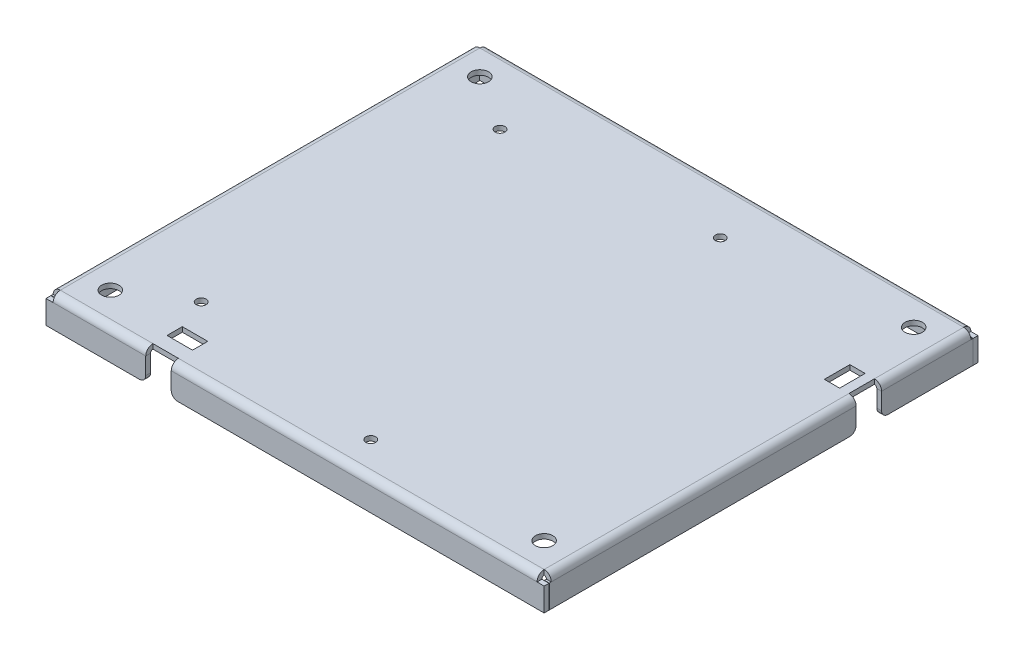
ISO-10303-21;
HEADER;
FILE_DESCRIPTION(('STEP AP214'),'2;1');
FILE_NAME('part.step','',(''),(''),'','','');
FILE_SCHEMA(('AUTOMOTIVE_DESIGN { 1 0 10303 214 1 1 1 1 }'));
ENDSEC;
DATA;
#1=APPLICATION_CONTEXT('core data for automotive mechanical design processes');
#2=APPLICATION_PROTOCOL_DEFINITION('international standard','automotive_design',2000,#1);
#3=PRODUCT_CONTEXT('',#1,'mechanical');
#4=PRODUCT('Part','Part','',(#3));
#5=PRODUCT_RELATED_PRODUCT_CATEGORY('part','',(#4));
#6=PRODUCT_DEFINITION_FORMATION('','',#4);
#7=PRODUCT_DEFINITION_CONTEXT('part definition',#1,'design');
#8=PRODUCT_DEFINITION('design','',#6,#7);
#9=PRODUCT_DEFINITION_SHAPE('','',#8);
#10=(LENGTH_UNIT() NAMED_UNIT(*) SI_UNIT(.MILLI.,.METRE.));
#11=(NAMED_UNIT(*) PLANE_ANGLE_UNIT() SI_UNIT($,.RADIAN.));
#12=(NAMED_UNIT(*) SI_UNIT($,.STERADIAN.) SOLID_ANGLE_UNIT());
#13=UNCERTAINTY_MEASURE_WITH_UNIT(LENGTH_MEASURE(1.E-05),#10,'distance_accuracy_value','');
#14=(GEOMETRIC_REPRESENTATION_CONTEXT(3) GLOBAL_UNCERTAINTY_ASSIGNED_CONTEXT((#13)) GLOBAL_UNIT_ASSIGNED_CONTEXT((#10,
#11,#12)) REPRESENTATION_CONTEXT('',''));
#15=CARTESIAN_POINT('',(0.,0.,0.));
#16=DIRECTION('',(0.,0.,1.));
#17=DIRECTION('',(1.,0.,0.));
#18=AXIS2_PLACEMENT_3D('',#15,#16,#17);
#19=CARTESIAN_POINT('',(77.5,-9.50000000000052,67.5000000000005));
#20=DIRECTION('',(0.,-1.,0.));
#21=DIRECTION('',(0.,0.,-1.));
#22=AXIS2_PLACEMENT_3D('',#19,#20,#21);
#23=PLANE('',#22);
#24=DIRECTION('',(-1.,0.,0.));
#25=VECTOR('',#24,1.);
#26=CARTESIAN_POINT('',(0.,-9.50000000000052,66.0000000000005));
#27=LINE('',#26,#25);
#28=CARTESIAN_POINT('',(-48.4649999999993,-9.50000000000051,66.0000000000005));
#29=VERTEX_POINT('',#28);
#30=CARTESIAN_POINT('',(-77.5,-9.50000000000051,66.0000000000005));
#31=VERTEX_POINT('',#30);
#32=EDGE_CURVE('E1477',#29,#31,#27,.T.);
#33=ORIENTED_EDGE('',*,*,#32,.F.);
#34=DIRECTION('',(0.,0.,-1.));
#35=VECTOR('',#34,1.);
#36=CARTESIAN_POINT('',(-48.4649999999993,-9.50000000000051,67.5000000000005));
#37=LINE('',#36,#35);
#38=CARTESIAN_POINT('',(-48.4649999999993,-9.50000000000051,67.5000000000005));
#39=VERTEX_POINT('',#38);
#40=EDGE_CURVE('E817',#29,#39,#37,.F.);
#41=ORIENTED_EDGE('',*,*,#40,.T.);
#42=DIRECTION('',(1.,0.,0.));
#43=VECTOR('',#42,1.);
#44=CARTESIAN_POINT('',(77.5,-9.50000000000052,67.5000000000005));
#45=LINE('',#44,#43);
#46=CARTESIAN_POINT('',(-77.5,-9.50000000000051,67.5000000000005));
#47=VERTEX_POINT('',#46);
#48=EDGE_CURVE('E925',#39,#47,#45,.F.);
#49=ORIENTED_EDGE('',*,*,#48,.T.);
#50=DIRECTION('',(0.,0.,-1.));
#51=VECTOR('',#50,1.);
#52=CARTESIAN_POINT('',(-77.5,-9.50000000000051,67.5000000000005));
#53=LINE('',#52,#51);
#54=EDGE_CURVE('E1413',#47,#31,#53,.T.);
#55=ORIENTED_EDGE('',*,*,#54,.T.);
#56=EDGE_LOOP('',(#33,#41,#49,#55));
#57=FACE_BOUND('',#56,.T.);
#58=ADVANCED_FACE('F411',(#57),#23,.T.);
#59=CARTESIAN_POINT('',(77.5,-9.50000000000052,67.5000000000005));
#60=VERTEX_POINT('',#59);
#61=CARTESIAN_POINT('',(-36.5349999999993,-9.50000000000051,67.5000000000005));
#62=VERTEX_POINT('',#61);
#63=EDGE_CURVE('E927',#60,#62,#45,.F.);
#64=ORIENTED_EDGE('',*,*,#63,.T.);
#65=DIRECTION('',(0.,0.,-1.));
#66=VECTOR('',#65,1.);
#67=CARTESIAN_POINT('',(-36.5349999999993,-9.50000000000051,67.5000000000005));
#68=LINE('',#67,#66);
#69=CARTESIAN_POINT('',(-36.5349999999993,-9.50000000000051,66.0000000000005));
#70=VERTEX_POINT('',#69);
#71=EDGE_CURVE('E812',#62,#70,#68,.T.);
#72=ORIENTED_EDGE('',*,*,#71,.T.);
#73=CARTESIAN_POINT('',(77.5,-9.50000000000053,66.0000000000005));
#74=VERTEX_POINT('',#73);
#75=EDGE_CURVE('E1478',#74,#70,#27,.T.);
#76=ORIENTED_EDGE('',*,*,#75,.F.);
#77=DIRECTION('',(0.,0.,-1.));
#78=VECTOR('',#77,1.);
#79=CARTESIAN_POINT('',(77.5,-9.50000000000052,67.5000000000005));
#80=LINE('',#79,#78);
#81=EDGE_CURVE('E1077',#60,#74,#80,.T.);
#82=ORIENTED_EDGE('',*,*,#81,.F.);
#83=EDGE_LOOP('',(#64,#72,#76,#82));
#84=FACE_BOUND('',#83,.T.);
#85=ADVANCED_FACE('F1835',(#84),#23,.T.);
#86=CARTESIAN_POINT('',(0.,-2.91433543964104E-13,66.0000000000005));
#87=DIRECTION('',(0.,0.,-1.));
#88=DIRECTION('',(0.,1.,0.));
#89=AXIS2_PLACEMENT_3D('',#86,#87,#88);
#90=PLANE('',#89);
#91=DIRECTION('',(0.,1.,0.));
#92=VECTOR('',#91,1.);
#93=CARTESIAN_POINT('',(-46.4649999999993,-2.96633797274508E-13,66.0000000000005));
#94=LINE('',#93,#92);
#95=CARTESIAN_POINT('',(-46.4649999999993,-7.50000000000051,66.0000000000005));
#96=VERTEX_POINT('',#95);
#97=CARTESIAN_POINT('',(-46.4649999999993,-2.23660000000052,66.0000000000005));
#98=VERTEX_POINT('',#97);
#99=EDGE_CURVE('E775',#96,#98,#94,.T.);
#100=ORIENTED_EDGE('',*,*,#99,.F.);
#101=CARTESIAN_POINT('',(-48.4649999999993,-7.50000000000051,66.0000000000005));
#102=DIRECTION('',(0.,0.,-1.));
#103=DIRECTION('',(0.,1.,0.));
#104=AXIS2_PLACEMENT_3D('',#101,#102,#103);
#105=CIRCLE('',#104,2.);
#106=EDGE_CURVE('E826',#96,#29,#105,.T.);
#107=ORIENTED_EDGE('',*,*,#106,.T.);
#108=ORIENTED_EDGE('',*,*,#32,.T.);
#109=DIRECTION('',(0.,-1.,0.));
#110=VECTOR('',#109,1.);
#111=CARTESIAN_POINT('',(-77.5,-2.23660000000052,66.0000000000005));
#112=LINE('',#111,#110);
#113=CARTESIAN_POINT('',(-77.5,-2.23660000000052,66.0000000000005));
#114=VERTEX_POINT('',#113);
#115=EDGE_CURVE('E1097',#114,#31,#112,.T.);
#116=ORIENTED_EDGE('',*,*,#115,.F.);
#117=DIRECTION('',(-1.,0.,0.));
#118=VECTOR('',#117,1.);
#119=CARTESIAN_POINT('',(-75.2928932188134,-2.23660000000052,66.0000000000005));
#120=LINE('',#119,#118);
#121=CARTESIAN_POINT('',(-75.2928932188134,-2.23660000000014,66.0000000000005));
#122=VERTEX_POINT('',#121);
#123=EDGE_CURVE('E1408',#122,#114,#120,.T.);
#124=ORIENTED_EDGE('',*,*,#123,.F.);
#125=DIRECTION('',(-1.,0.,0.));
#126=VECTOR('',#125,1.);
#127=CARTESIAN_POINT('',(77.5,-2.23660000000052,66.0000000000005));
#128=LINE('',#127,#126);
#129=EDGE_CURVE('E783',#98,#122,#128,.T.);
#130=ORIENTED_EDGE('',*,*,#129,.F.);
#131=EDGE_LOOP('',(#100,#107,#108,#116,#124,#130));
#132=FACE_BOUND('',#131,.T.);
#133=ADVANCED_FACE('F1841',(#132),#90,.T.);
#134=ORIENTED_EDGE('',*,*,#75,.T.);
#135=CARTESIAN_POINT('',(-36.5349999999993,-7.50000000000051,66.0000000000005));
#136=DIRECTION('',(0.,0.,-1.));
#137=DIRECTION('',(0.,1.,0.));
#138=AXIS2_PLACEMENT_3D('',#135,#136,#137);
#139=CIRCLE('',#138,2.);
#140=CARTESIAN_POINT('',(-38.5349999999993,-7.50000000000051,66.0000000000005));
#141=VERTEX_POINT('',#140);
#142=EDGE_CURVE('E773',#70,#141,#139,.T.);
#143=ORIENTED_EDGE('',*,*,#142,.T.);
#144=DIRECTION('',(0.,-1.,0.));
#145=VECTOR('',#144,1.);
#146=CARTESIAN_POINT('',(-38.5349999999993,-2.95746290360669E-13,66.0000000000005));
#147=LINE('',#146,#145);
#148=CARTESIAN_POINT('',(-38.5349999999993,-2.23660000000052,66.0000000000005));
#149=VERTEX_POINT('',#148);
#150=EDGE_CURVE('E758',#149,#141,#147,.T.);
#151=ORIENTED_EDGE('',*,*,#150,.F.);
#152=CARTESIAN_POINT('',(75.2928932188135,-2.23660000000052,66.0000000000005));
#153=VERTEX_POINT('',#152);
#154=EDGE_CURVE('E770',#153,#149,#128,.T.);
#155=ORIENTED_EDGE('',*,*,#154,.F.);
#156=DIRECTION('',(1.,0.,0.));
#157=VECTOR('',#156,1.);
#158=CARTESIAN_POINT('',(75.2928932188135,-2.23660000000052,66.0000000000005));
#159=LINE('',#158,#157);
#160=CARTESIAN_POINT('',(77.5,-2.23660000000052,66.0000000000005));
#161=VERTEX_POINT('',#160);
#162=EDGE_CURVE('E798',#153,#161,#159,.T.);
#163=ORIENTED_EDGE('',*,*,#162,.T.);
#164=DIRECTION('',(0.,-1.,0.));
#165=VECTOR('',#164,1.);
#166=CARTESIAN_POINT('',(77.5,-2.23660000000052,66.0000000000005));
#167=LINE('',#166,#165);
#168=EDGE_CURVE('E1112',#161,#74,#167,.T.);
#169=ORIENTED_EDGE('',*,*,#168,.T.);
#170=EDGE_LOOP('',(#134,#143,#151,#155,#163,#169));
#171=FACE_BOUND('',#170,.T.);
#172=ADVANCED_FACE('F768',(#171),#90,.T.);
#173=CARTESIAN_POINT('',(0.,-2.77555756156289E-13,67.5000000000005));
#174=DIRECTION('',(0.,0.,-1.));
#175=DIRECTION('',(0.,1.,0.));
#176=AXIS2_PLACEMENT_3D('',#173,#174,#175);
#177=PLANE('',#176);
#178=ORIENTED_EDGE('',*,*,#48,.F.);
#179=CARTESIAN_POINT('',(-48.4649999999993,-7.50000000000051,67.5000000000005));
#180=DIRECTION('',(0.,0.,-1.));
#181=DIRECTION('',(0.,1.,0.));
#182=AXIS2_PLACEMENT_3D('',#179,#180,#181);
#183=CIRCLE('',#182,2.);
#184=CARTESIAN_POINT('',(-46.4649999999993,-7.50000000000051,67.5000000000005));
#185=VERTEX_POINT('',#184);
#186=EDGE_CURVE('E821',#39,#185,#183,.F.);
#187=ORIENTED_EDGE('',*,*,#186,.T.);
#188=DIRECTION('',(0.,1.,0.));
#189=VECTOR('',#188,1.);
#190=CARTESIAN_POINT('',(-46.4649999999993,-2.86229373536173E-13,67.5000000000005));
#191=LINE('',#190,#189);
#192=CARTESIAN_POINT('',(-46.4649999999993,-2.23660000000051,67.5000000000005));
#193=VERTEX_POINT('',#192);
#194=EDGE_CURVE('E764',#185,#193,#191,.T.);
#195=ORIENTED_EDGE('',*,*,#194,.T.);
#196=DIRECTION('',(1.,0.,0.));
#197=VECTOR('',#196,1.);
#198=CARTESIAN_POINT('',(77.5,-2.23660000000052,67.5000000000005));
#199=LINE('',#198,#197);
#200=CARTESIAN_POINT('',(-75.2928932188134,-2.23660000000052,67.5000000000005));
#201=VERTEX_POINT('',#200);
#202=EDGE_CURVE('E788',#201,#193,#199,.T.);
#203=ORIENTED_EDGE('',*,*,#202,.F.);
#204=DIRECTION('',(-1.,0.,0.));
#205=VECTOR('',#204,1.);
#206=CARTESIAN_POINT('',(-75.2928932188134,-2.2366000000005,67.5000000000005));
#207=LINE('',#206,#205);
#208=CARTESIAN_POINT('',(-77.5,-2.2366000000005,67.5000000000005));
#209=VERTEX_POINT('',#208);
#210=EDGE_CURVE('E1409',#201,#209,#207,.T.);
#211=ORIENTED_EDGE('',*,*,#210,.T.);
#212=DIRECTION('',(0.,-1.,0.));
#213=VECTOR('',#212,1.);
#214=CARTESIAN_POINT('',(-77.5,-2.2366000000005,67.5000000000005));
#215=LINE('',#214,#213);
#216=EDGE_CURVE('E1405',#209,#47,#215,.T.);
#217=ORIENTED_EDGE('',*,*,#216,.T.);
#218=EDGE_LOOP('',(#178,#187,#195,#203,#211,#217));
#219=FACE_BOUND('',#218,.T.);
#220=ADVANCED_FACE('F1855',(#219),#177,.F.);
#221=DIRECTION('',(0.,1.,0.));
#222=VECTOR('',#221,1.);
#223=CARTESIAN_POINT('',(-38.5349999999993,-2.86229373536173E-13,67.5000000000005));
#224=LINE('',#223,#222);
#225=CARTESIAN_POINT('',(-38.5349999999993,-2.23660000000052,67.5000000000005));
#226=VERTEX_POINT('',#225);
#227=CARTESIAN_POINT('',(-38.5349999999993,-7.50000000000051,67.5000000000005));
#228=VERTEX_POINT('',#227);
#229=EDGE_CURVE('E761',#226,#228,#224,.F.);
#230=ORIENTED_EDGE('',*,*,#229,.T.);
#231=CARTESIAN_POINT('',(-36.5349999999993,-7.50000000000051,67.5000000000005));
#232=DIRECTION('',(0.,0.,-1.));
#233=DIRECTION('',(0.,1.,0.));
#234=AXIS2_PLACEMENT_3D('',#231,#232,#233);
#235=CIRCLE('',#234,2.);
#236=EDGE_CURVE('E808',#228,#62,#235,.F.);
#237=ORIENTED_EDGE('',*,*,#236,.T.);
#238=ORIENTED_EDGE('',*,*,#63,.F.);
#239=DIRECTION('',(0.,-1.,0.));
#240=VECTOR('',#239,1.);
#241=CARTESIAN_POINT('',(77.5,-2.2366000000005,67.5000000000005));
#242=LINE('',#241,#240);
#243=CARTESIAN_POINT('',(77.5,-2.2366000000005,67.5000000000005));
#244=VERTEX_POINT('',#243);
#245=EDGE_CURVE('E794',#244,#60,#242,.T.);
#246=ORIENTED_EDGE('',*,*,#245,.F.);
#247=DIRECTION('',(1.,0.,0.));
#248=VECTOR('',#247,1.);
#249=CARTESIAN_POINT('',(75.2928932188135,-2.2366000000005,67.5000000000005));
#250=LINE('',#249,#248);
#251=CARTESIAN_POINT('',(75.2928932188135,-2.23660000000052,67.5000000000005));
#252=VERTEX_POINT('',#251);
#253=EDGE_CURVE('E1109',#252,#244,#250,.T.);
#254=ORIENTED_EDGE('',*,*,#253,.F.);
#255=EDGE_CURVE('E782',#226,#252,#199,.T.);
#256=ORIENTED_EDGE('',*,*,#255,.F.);
#257=EDGE_LOOP('',(#230,#237,#238,#246,#254,#256));
#258=FACE_BOUND('',#257,.T.);
#259=ADVANCED_FACE('F1192',(#258),#177,.F.);
#260=CARTESIAN_POINT('',(-150.611360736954,-2.23660000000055,65.2634000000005));
#261=DIRECTION('',(1.,0.,0.));
#262=DIRECTION('',(0.,0.,-1.));
#263=AXIS2_PLACEMENT_3D('',#260,#261,#262);
#264=CYLINDRICAL_SURFACE('',#263,0.7366);
#265=DIRECTION('',(1.,0.,0.));
#266=VECTOR('',#265,1.);
#267=CARTESIAN_POINT('',(-75.2928932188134,-1.50000000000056,65.2634000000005));
#268=LINE('',#267,#266);
#269=CARTESIAN_POINT('',(-75.2633999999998,-1.5000000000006,65.2633999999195));
#270=VERTEX_POINT('',#269);
#271=CARTESIAN_POINT('',(-46.4649999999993,-1.50000000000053,65.2634000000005));
#272=VERTEX_POINT('',#271);
#273=EDGE_CURVE('E920',#270,#272,#268,.T.);
#274=ORIENTED_EDGE('',*,*,#273,.T.);
#275=CARTESIAN_POINT('',(-46.4649999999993,-2.23660000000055,65.2634000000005));
#276=DIRECTION('',(-1.,0.,0.));
#277=DIRECTION('',(0.,-1.,0.));
#278=AXIS2_PLACEMENT_3D('',#275,#276,#277);
#279=CIRCLE('',#278,0.7366);
#280=EDGE_CURVE('E862',#98,#272,#279,.T.);
#281=ORIENTED_EDGE('',*,*,#280,.F.);
#282=ORIENTED_EDGE('',*,*,#129,.T.);
#283=CARTESIAN_POINT('',(-75.2928932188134,-2.23660000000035,66.0000000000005));
#284=CARTESIAN_POINT('',(-75.2925859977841,-2.22454739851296,66.0000002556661));
#285=CARTESIAN_POINT('',(-75.2922787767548,-2.21249481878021,65.9997041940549));
#286=CARTESIAN_POINT('',(-75.2916643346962,-2.18841868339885,65.9985212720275));
#287=CARTESIAN_POINT('',(-75.2913571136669,-2.17639512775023,65.9976344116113));
#288=CARTESIAN_POINT('',(-75.2907426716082,-2.152406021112,65.9952717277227));
#289=CARTESIAN_POINT('',(-75.290435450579,-2.14044047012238,65.9937959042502));
#290=CARTESIAN_POINT('',(-75.2898210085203,-2.11659619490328,65.9902589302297));
#291=CARTESIAN_POINT('',(-75.289513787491,-2.10471747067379,65.9881977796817));
#292=CARTESIAN_POINT('',(-75.2888993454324,-2.08107546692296,65.9834950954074));
#293=CARTESIAN_POINT('',(-75.2885921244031,-2.06931218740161,65.9808535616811));
#294=CARTESIAN_POINT('',(-75.2879776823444,-2.0459294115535,65.9749964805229));
#295=CARTESIAN_POINT('',(-75.2876704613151,-2.03430991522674,65.971780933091));
#296=CARTESIAN_POINT('',(-75.2870560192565,-2.01124269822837,65.9647835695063));
#297=CARTESIAN_POINT('',(-75.2867487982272,-1.99979497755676,65.9610017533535));
#298=CARTESIAN_POINT('',(-75.2861343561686,-1.97709889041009,65.9528809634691));
#299=CARTESIAN_POINT('',(-75.2858271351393,-1.96585052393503,65.9485419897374));
#300=CARTESIAN_POINT('',(-75.2852126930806,-1.943580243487,65.9393173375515));
#301=CARTESIAN_POINT('',(-75.2849054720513,-1.93255832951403,65.9344316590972));
#302=CARTESIAN_POINT('',(-75.2842910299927,-1.9107675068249,65.9241253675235));
#303=CARTESIAN_POINT('',(-75.2839838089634,-1.89999859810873,65.9187047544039));
#304=CARTESIAN_POINT('',(-75.2833693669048,-1.87873972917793,65.9073416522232));
#305=CARTESIAN_POINT('',(-75.2830621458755,-1.8682497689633,65.9013991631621));
#306=CARTESIAN_POINT('',(-75.2824477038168,-1.84757406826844,65.889006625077));
#307=CARTESIAN_POINT('',(-75.2821404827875,-1.83738832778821,65.8825565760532));
#308=CARTESIAN_POINT('',(-75.2815260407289,-1.81734560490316,65.8691644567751));
#309=CARTESIAN_POINT('',(-75.2812188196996,-1.80748862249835,65.862222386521));
#310=CARTESIAN_POINT('',(-75.280604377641,-1.78812716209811,65.8478629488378));
#311=CARTESIAN_POINT('',(-75.2802971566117,-1.77862268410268,65.8404455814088));
#312=CARTESIAN_POINT('',(-75.279682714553,-1.7599891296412,65.8251534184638));
#313=CARTESIAN_POINT('',(-75.2793754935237,-1.75086005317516,65.8172786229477));
#314=CARTESIAN_POINT('',(-75.2787610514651,-1.73299929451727,65.8010905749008));
#315=CARTESIAN_POINT('',(-75.2784538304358,-1.72426761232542,65.7927773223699));
#316=CARTESIAN_POINT('',(-75.2778393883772,-1.70722267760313,65.7757323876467));
#317=CARTESIAN_POINT('',(-75.2775321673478,-1.69890942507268,65.7670007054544));
#318=CARTESIAN_POINT('',(-75.2769177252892,-1.68272137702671,65.7491399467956));
#319=CARTESIAN_POINT('',(-75.2766105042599,-1.67484658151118,65.7400108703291));
#320=CARTESIAN_POINT('',(-75.2759960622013,-1.65955441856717,65.7213773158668));
#321=CARTESIAN_POINT('',(-75.275688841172,-1.6521370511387,65.7118728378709));
#322=CARTESIAN_POINT('',(-75.2750743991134,-1.63777761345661,65.6925113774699));
#323=CARTESIAN_POINT('',(-75.274767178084,-1.63083554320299,65.6826543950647));
#324=CARTESIAN_POINT('',(-75.2741527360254,-1.61744342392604,65.6626116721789));
#325=CARTESIAN_POINT('',(-75.2738455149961,-1.61099337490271,65.6524259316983));
#326=CARTESIAN_POINT('',(-75.2732310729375,-1.59860083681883,65.6317502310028));
#327=CARTESIAN_POINT('',(-75.2729238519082,-1.59265834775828,65.6212602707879));
#328=CARTESIAN_POINT('',(-75.2723094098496,-1.58129524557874,65.6000014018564));
#329=CARTESIAN_POINT('',(-75.2720021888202,-1.57587463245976,65.58923249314));
#330=CARTESIAN_POINT('',(-75.2713877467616,-1.56556834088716,65.5674416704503));
#331=CARTESIAN_POINT('',(-75.2710805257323,-1.56068266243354,65.5564197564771));
#332=CARTESIAN_POINT('',(-75.2704660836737,-1.55145801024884,65.5341494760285));
#333=CARTESIAN_POINT('',(-75.2701588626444,-1.54711903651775,65.5229011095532));
#334=CARTESIAN_POINT('',(-75.2695444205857,-1.53899824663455,65.5002050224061));
#335=CARTESIAN_POINT('',(-75.2692371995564,-1.53521643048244,65.4887573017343));
#336=CARTESIAN_POINT('',(-75.2686227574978,-1.528219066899,65.4656900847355));
#337=CARTESIAN_POINT('',(-75.2683155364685,-1.52500351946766,65.4540705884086));
#338=CARTESIAN_POINT('',(-75.2677010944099,-1.51914643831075,65.4306878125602));
#339=CARTESIAN_POINT('',(-75.2673938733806,-1.51650490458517,65.4189245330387));
#340=CARTESIAN_POINT('',(-75.2667794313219,-1.51180222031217,65.3952825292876));
#341=CARTESIAN_POINT('',(-75.2664722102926,-1.50974106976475,65.383403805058));
#342=CARTESIAN_POINT('',(-75.265857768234,-1.50620409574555,65.3595595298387));
#343=CARTESIAN_POINT('',(-75.2655505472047,-1.50472827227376,65.347593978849));
#344=CARTESIAN_POINT('',(-75.2649361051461,-1.50236558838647,65.3236048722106));
#345=CARTESIAN_POINT('',(-75.2646288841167,-1.50147872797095,65.311581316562));
#346=CARTESIAN_POINT('',(-75.2640144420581,-1.50029580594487,65.2875051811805));
#347=CARTESIAN_POINT('',(-75.2637072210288,-1.4999997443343,65.2754526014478));
#348=CARTESIAN_POINT('',(-75.2633999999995,-1.50000000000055,65.2633999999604));
#349=B_SPLINE_CURVE_WITH_KNOTS('',3,(#283,#284,#285,#286,#287,#288,#289,#290,#291,#292,#293,
#294,#295,#296,#297,#298,#299,#300,#301,#302,#303,#304,#305,#306,#307,#308,#309,#310,#311,#312,
#313,#314,#315,#316,#317,#318,#319,#320,#321,#322,#323,#324,#325,#326,#327,#328,#329,#330,#331,
#332,#333,#334,#335,#336,#337,#338,#339,#340,#341,#342,#343,#344,#345,#346,#347,#348),
.UNSPECIFIED.,.F.,.F.,(4,2,2,2,2,2,2,2,2,2,2,2,2,2,2,2,2,2,2,2,2,2,2,2,2,2,2,2,2,2,2,2,4),(0.,
0.0361658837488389,0.0723317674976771,0.108497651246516,0.144663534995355,0.180829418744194,
0.216995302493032,0.253161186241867,0.289327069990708,0.325492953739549,0.361658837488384,
0.397824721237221,0.433990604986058,0.4701564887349,0.506322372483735,0.54248825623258,
0.578654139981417,0.61482002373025,0.650985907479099,0.687151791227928,0.723317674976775,
0.759483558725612,0.795649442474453,0.831815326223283,0.867981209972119,0.904147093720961,
0.9403129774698,0.976478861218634,1.01264474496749,1.04881062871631,1.08497651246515,
1.121142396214,1.15730827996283),.UNSPECIFIED.);
#350=EDGE_CURVE('E968',#122,#270,#349,.T.);
#351=ORIENTED_EDGE('',*,*,#350,.T.);
#352=EDGE_LOOP('',(#274,#281,#282,#351));
#353=FACE_BOUND('',#352,.T.);
#354=ADVANCED_FACE('F1183',(#353),#264,.F.);
#355=ORIENTED_EDGE('',*,*,#154,.T.);
#356=CARTESIAN_POINT('',(-38.5349999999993,-2.23660000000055,65.2634000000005));
#357=DIRECTION('',(1.,0.,0.));
#358=DIRECTION('',(0.,1.,0.));
#359=AXIS2_PLACEMENT_3D('',#356,#357,#358);
#360=CIRCLE('',#359,0.7366);
#361=CARTESIAN_POINT('',(-38.5349999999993,-1.50000000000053,65.2634000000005));
#362=VERTEX_POINT('',#361);
#363=EDGE_CURVE('E739',#362,#149,#360,.T.);
#364=ORIENTED_EDGE('',*,*,#363,.F.);
#365=CARTESIAN_POINT('',(75.2634,-1.50000000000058,65.2634000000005));
#366=VERTEX_POINT('',#365);
#367=EDGE_CURVE('E803',#362,#366,#268,.T.);
#368=ORIENTED_EDGE('',*,*,#367,.T.);
#369=CARTESIAN_POINT('',(75.2634,-1.50000000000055,65.2634000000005));
#370=CARTESIAN_POINT('',(75.2637072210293,-1.49999974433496,65.2754526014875));
#371=CARTESIAN_POINT('',(75.2640144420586,-1.50029580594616,65.2875051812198));
#372=CARTESIAN_POINT('',(75.2646288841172,-1.50147872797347,65.3115813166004));
#373=CARTESIAN_POINT('',(75.2649361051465,-1.50236558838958,65.3236048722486));
#374=CARTESIAN_POINT('',(75.2655505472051,-1.50472827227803,65.347593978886));
#375=CARTESIAN_POINT('',(75.2658577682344,-1.50620409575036,65.3595595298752));
#376=CARTESIAN_POINT('',(75.2664722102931,-1.50974106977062,65.3834038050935));
#377=CARTESIAN_POINT('',(75.2667794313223,-1.51180222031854,65.3952825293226));
#378=CARTESIAN_POINT('',(75.267393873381,-1.51650490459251,65.4189245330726));
#379=CARTESIAN_POINT('',(75.2677010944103,-1.51914643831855,65.4306878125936));
#380=CARTESIAN_POINT('',(75.2683155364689,-1.52500351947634,65.4540705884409));
#381=CARTESIAN_POINT('',(75.2686227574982,-1.52821906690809,65.4656900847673));
#382=CARTESIAN_POINT('',(75.2692371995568,-1.53521643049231,65.488757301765));
#383=CARTESIAN_POINT('',(75.2695444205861,-1.53899824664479,65.5002050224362));
#384=CARTESIAN_POINT('',(75.2701588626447,-1.54711903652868,65.5229011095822));
#385=CARTESIAN_POINT('',(75.270466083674,-1.55145801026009,65.5341494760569));
#386=CARTESIAN_POINT('',(75.2710805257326,-1.56068266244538,65.5564197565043));
#387=CARTESIAN_POINT('',(75.271387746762,-1.56556834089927,65.567441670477));
#388=CARTESIAN_POINT('',(75.2720021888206,-1.57587463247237,65.5892324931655));
#389=CARTESIAN_POINT('',(75.2723094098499,-1.58129524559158,65.6000014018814));
#390=CARTESIAN_POINT('',(75.2729238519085,-1.59265834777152,65.6212602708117));
#391=CARTESIAN_POINT('',(75.2732310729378,-1.59860083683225,65.631750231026));
#392=CARTESIAN_POINT('',(75.2738455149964,-1.61099337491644,65.6524259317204));
#393=CARTESIAN_POINT('',(75.2741527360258,-1.6174434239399,65.6626116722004));
#394=CARTESIAN_POINT('',(75.2747671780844,-1.63083554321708,65.6826543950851));
#395=CARTESIAN_POINT('',(75.2750743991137,-1.63777761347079,65.6925113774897));
#396=CARTESIAN_POINT('',(75.2756888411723,-1.65213705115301,65.7118728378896));
#397=CARTESIAN_POINT('',(75.2759960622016,-1.65955441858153,65.7213773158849));
#398=CARTESIAN_POINT('',(75.2766105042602,-1.67484658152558,65.740010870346));
#399=CARTESIAN_POINT('',(75.2769177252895,-1.68272137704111,65.749139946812));
#400=CARTESIAN_POINT('',(75.2775321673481,-1.69890942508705,65.7670007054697));
#401=CARTESIAN_POINT('',(75.2778393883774,-1.70722267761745,65.7757323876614));
#402=CARTESIAN_POINT('',(75.278453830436,-1.72426761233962,65.7927773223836));
#403=CARTESIAN_POINT('',(75.2787610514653,-1.73299929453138,65.801090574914));
#404=CARTESIAN_POINT('',(75.279375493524,-1.75086005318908,65.8172786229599));
#405=CARTESIAN_POINT('',(75.2796827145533,-1.75998912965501,65.8251534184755));
#406=CARTESIAN_POINT('',(75.2802971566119,-1.7786226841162,65.8404455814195));
#407=CARTESIAN_POINT('',(75.2806043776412,-1.78812716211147,65.847862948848));
#408=CARTESIAN_POINT('',(75.2812188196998,-1.80748862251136,65.8622223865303));
#409=CARTESIAN_POINT('',(75.2815260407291,-1.81734560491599,65.869164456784));
#410=CARTESIAN_POINT('',(75.2821404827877,-1.83738832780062,65.8825565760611));
#411=CARTESIAN_POINT('',(75.282447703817,-1.84757406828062,65.8890066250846));
#412=CARTESIAN_POINT('',(75.2830621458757,-1.86824976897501,65.9013991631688));
#413=CARTESIAN_POINT('',(75.283369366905,-1.87873972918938,65.9073416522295));
#414=CARTESIAN_POINT('',(75.2839838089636,-1.89999859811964,65.9187047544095));
#415=CARTESIAN_POINT('',(75.2842910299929,-1.91076750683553,65.9241253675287));
#416=CARTESIAN_POINT('',(75.2849054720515,-1.93255832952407,65.9344316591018));
#417=CARTESIAN_POINT('',(75.2852126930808,-1.94358024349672,65.9393173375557));
#418=CARTESIAN_POINT('',(75.2858271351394,-1.96585052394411,65.948541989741));
#419=CARTESIAN_POINT('',(75.2861343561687,-1.97709889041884,65.9528809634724));
#420=CARTESIAN_POINT('',(75.2867487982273,-1.99979497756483,65.9610017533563));
#421=CARTESIAN_POINT('',(75.2870560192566,-2.01124269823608,65.9647835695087));
#422=CARTESIAN_POINT('',(75.2876704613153,-2.03430991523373,65.971780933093));
#423=CARTESIAN_POINT('',(75.2879776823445,-2.04592941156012,65.9749964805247));
#424=CARTESIAN_POINT('',(75.2885921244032,-2.06931218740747,65.9808535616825));
#425=CARTESIAN_POINT('',(75.2888993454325,-2.08107546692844,65.9834950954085));
#426=CARTESIAN_POINT('',(75.2895137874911,-2.10471747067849,65.9881977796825));
#427=CARTESIAN_POINT('',(75.2898210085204,-2.11659619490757,65.9902589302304));
#428=CARTESIAN_POINT('',(75.290435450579,-2.14044047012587,65.9937959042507));
#429=CARTESIAN_POINT('',(75.2907426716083,-2.15240602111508,65.995271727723));
#430=CARTESIAN_POINT('',(75.2913571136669,-2.17639512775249,65.9976344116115));
#431=CARTESIAN_POINT('',(75.2916643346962,-2.18841868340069,65.9985212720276));
#432=CARTESIAN_POINT('',(75.2922787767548,-2.21249481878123,65.9997041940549));
#433=CARTESIAN_POINT('',(75.2925859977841,-2.22454739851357,66.0000002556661));
#434=CARTESIAN_POINT('',(75.2928932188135,-2.23660000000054,66.0000000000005));
#435=B_SPLINE_CURVE_WITH_KNOTS('',3,(#369,#370,#371,#372,#373,#374,#375,#376,#377,#378,#379,
#380,#381,#382,#383,#384,#385,#386,#387,#388,#389,#390,#391,#392,#393,#394,#395,#396,#397,#398,
#399,#400,#401,#402,#403,#404,#405,#406,#407,#408,#409,#410,#411,#412,#413,#414,#415,#416,#417,
#418,#419,#420,#421,#422,#423,#424,#425,#426,#427,#428,#429,#430,#431,#432,#433,#434),
.UNSPECIFIED.,.F.,.F.,(4,2,2,2,2,2,2,2,2,2,2,2,2,2,2,2,2,2,2,2,2,2,2,2,2,2,2,2,2,2,2,2,4),(0.,
0.0361658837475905,0.0723317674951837,0.108497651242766,0.144663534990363,0.180829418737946,
0.216995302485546,0.253161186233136,0.289327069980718,0.325492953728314,0.361658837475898,
0.397824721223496,0.433990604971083,0.470156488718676,0.506322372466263,0.542488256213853,
0.578654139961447,0.614820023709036,0.650985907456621,0.687151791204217,0.723317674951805,
0.759483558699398,0.795649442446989,0.831815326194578,0.867981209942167,0.904147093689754,
0.940312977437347,0.976478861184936,1.01264474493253,1.04881062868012,1.08497651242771,
1.1211423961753,1.15730827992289),.UNSPECIFIED.);
#436=EDGE_CURVE('E780',#366,#153,#435,.T.);
#437=ORIENTED_EDGE('',*,*,#436,.T.);
#438=EDGE_LOOP('',(#355,#364,#368,#437));
#439=FACE_BOUND('',#438,.T.);
#440=ADVANCED_FACE('F778',(#439),#264,.F.);
#441=CARTESIAN_POINT('',(-150.611360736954,-2.23660000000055,65.2634000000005));
#442=DIRECTION('',(1.,0.,0.));
#443=DIRECTION('',(0.,0.,-1.));
#444=AXIS2_PLACEMENT_3D('',#441,#442,#443);
#445=CYLINDRICAL_SURFACE('',#444,2.2366);
#446=CARTESIAN_POINT('',(-46.4649999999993,-2.23660000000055,65.2634000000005));
#447=DIRECTION('',(1.,0.,0.));
#448=DIRECTION('',(0.,0.,-1.));
#449=AXIS2_PLACEMENT_3D('',#446,#447,#448);
#450=CIRCLE('',#449,2.2366);
#451=CARTESIAN_POINT('',(-46.4649999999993,-5.46437894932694E-13,65.2634000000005));
#452=VERTEX_POINT('',#451);
#453=EDGE_CURVE('E1554',#193,#452,#450,.F.);
#454=ORIENTED_EDGE('',*,*,#453,.T.);
#455=DIRECTION('',(1.,0.,0.));
#456=VECTOR('',#455,1.);
#457=CARTESIAN_POINT('',(-75.2928932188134,-5.68989300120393E-13,65.2634000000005));
#458=LINE('',#457,#456);
#459=CARTESIAN_POINT('',(-75.2633999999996,-5.96744875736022E-13,65.2633999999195));
#460=VERTEX_POINT('',#459);
#461=EDGE_CURVE('E1017',#460,#452,#458,.T.);
#462=ORIENTED_EDGE('',*,*,#461,.F.);
#463=CARTESIAN_POINT('',(-75.2928932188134,-2.23659999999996,67.5000000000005));
#464=CARTESIAN_POINT('',(-75.2925859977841,-2.20000368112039,67.5000007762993));
#465=CARTESIAN_POINT('',(-75.2922787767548,-2.16340742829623,67.4991018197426));
#466=CARTESIAN_POINT('',(-75.2916643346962,-2.0903030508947,67.495510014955));
#467=CARTESIAN_POINT('',(-75.2913571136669,-2.05379492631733,67.4928171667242));
#468=CARTESIAN_POINT('',(-75.2907426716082,-1.98095480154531,67.4856431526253));
#469=CARTESIAN_POINT('',(-75.290435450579,-1.94462280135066,67.4811619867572));
#470=CARTESIAN_POINT('',(-75.2898210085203,-1.87222244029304,67.4704223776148));
#471=CARTESIAN_POINT('',(-75.289513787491,-1.83615407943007,67.4641639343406));
#472=CARTESIAN_POINT('',(-75.2888993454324,-1.76436789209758,67.4498847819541));
#473=CARTESIAN_POINT('',(-75.2885921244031,-1.72865006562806,67.4418640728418));
#474=CARTESIAN_POINT('',(-75.2879776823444,-1.65765099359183,67.4240797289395));
#475=CARTESIAN_POINT('',(-75.2876704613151,-1.62236974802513,67.4143160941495));
#476=CARTESIAN_POINT('',(-75.2870560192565,-1.55232883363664,67.3930694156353));
#477=CARTESIAN_POINT('',(-75.2867487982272,-1.51756916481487,67.3815863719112));
#478=CARTESIAN_POINT('',(-75.2861343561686,-1.44865514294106,67.3569285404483));
#479=CARTESIAN_POINT('',(-75.2858271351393,-1.41450078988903,67.3437537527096));
#480=CARTESIAN_POINT('',(-75.2852126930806,-1.34687968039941,67.3157441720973));
#481=CARTESIAN_POINT('',(-75.2849054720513,-1.31341292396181,67.3009093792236));
#482=CARTESIAN_POINT('',(-75.2842910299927,-1.24724763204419,67.2696155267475));
#483=CARTESIAN_POINT('',(-75.2839838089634,-1.21454909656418,67.2531564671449));
#484=CARTESIAN_POINT('',(-75.2833693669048,-1.14999902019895,67.2186537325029));
#485=CARTESIAN_POINT('',(-75.2830621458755,-1.11814747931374,67.2006100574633));
#486=CARTESIAN_POINT('',(-75.2824477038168,-1.05536812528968,67.1629815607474));
#487=CARTESIAN_POINT('',(-75.2821404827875,-1.02444031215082,67.143396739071));
#488=CARTESIAN_POINT('',(-75.2815260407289,-0.963582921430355,67.1027331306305));
#489=CARTESIAN_POINT('',(-75.2812188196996,-0.933653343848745,67.0816543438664));
#490=CARTESIAN_POINT('',(-75.280604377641,-0.874864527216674,67.0380535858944));
#491=CARTESIAN_POINT('',(-75.2802971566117,-0.846005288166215,67.0155316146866));
#492=CARTESIAN_POINT('',(-75.279682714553,-0.789426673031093,66.9690987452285));
#493=CARTESIAN_POINT('',(-75.2793754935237,-0.76170729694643,66.9451878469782));
#494=CARTESIAN_POINT('',(-75.2787610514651,-0.707475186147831,66.8960347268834));
#495=CARTESIAN_POINT('',(-75.2784538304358,-0.680962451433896,66.8707925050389));
#496=CARTESIAN_POINT('',(-75.2778393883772,-0.629207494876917,66.8190375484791));
#497=CARTESIAN_POINT('',(-75.2775321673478,-0.603965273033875,66.7925248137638));
#498=CARTESIAN_POINT('',(-75.2769177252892,-0.55481215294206,66.7382927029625));
#499=CARTESIAN_POINT('',(-75.2766105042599,-0.530901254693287,66.7105733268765));
#500=CARTESIAN_POINT('',(-75.2759960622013,-0.484468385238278,66.6539947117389));
#501=CARTESIAN_POINT('',(-75.275688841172,-0.461946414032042,66.6251354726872));
#502=CARTESIAN_POINT('',(-75.2750743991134,-0.41834565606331,66.5663466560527));
#503=CARTESIAN_POINT('',(-75.274767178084,-0.397266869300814,66.53641707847));
#504=CARTESIAN_POINT('',(-75.2741527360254,-0.356603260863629,66.4755596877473));
#505=CARTESIAN_POINT('',(-75.2738455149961,-0.337018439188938,66.4446318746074));
#506=CARTESIAN_POINT('',(-75.2732310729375,-0.299389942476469,66.3818525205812));
#507=CARTESIAN_POINT('',(-75.2729238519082,-0.281346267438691,66.350000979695));
#508=CARTESIAN_POINT('',(-75.2723094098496,-0.246843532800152,66.2854509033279));
#509=CARTESIAN_POINT('',(-75.2720021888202,-0.230384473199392,66.252752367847));
#510=CARTESIAN_POINT('',(-75.2713877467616,-0.199090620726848,66.1865870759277));
#511=CARTESIAN_POINT('',(-75.2710805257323,-0.184255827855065,66.1531203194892));
#512=CARTESIAN_POINT('',(-75.2704660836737,-0.156246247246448,66.0854992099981));
#513=CARTESIAN_POINT('',(-75.2701588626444,-0.143071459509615,66.0513448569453));
#514=CARTESIAN_POINT('',(-75.2695444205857,-0.118413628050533,65.9824308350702));
#515=CARTESIAN_POINT('',(-75.2692371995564,-0.106930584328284,65.9476711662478));
#516=CARTESIAN_POINT('',(-75.2686227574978,-0.085683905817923,65.8776302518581));
#517=CARTESIAN_POINT('',(-75.2683155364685,-0.0759202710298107,65.8423490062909));
#518=CARTESIAN_POINT('',(-75.2677010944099,-0.0581359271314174,65.7713499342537));
#519=CARTESIAN_POINT('',(-75.2673938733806,-0.0501152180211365,65.7356321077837));
#520=CARTESIAN_POINT('',(-75.2667794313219,-0.0358360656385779,65.6638459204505));
#521=CARTESIAN_POINT('',(-75.2664722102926,-0.0295776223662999,65.6277775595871));
#522=CARTESIAN_POINT('',(-75.265857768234,-0.0188380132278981,65.5553771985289));
#523=CARTESIAN_POINT('',(-75.2655505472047,-0.0143568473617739,65.519045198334));
#524=CARTESIAN_POINT('',(-75.2649361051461,-0.00718283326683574,65.4462050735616));
#525=CARTESIAN_POINT('',(-75.2646288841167,-0.00448998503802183,65.4096969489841));
#526=CARTESIAN_POINT('',(-75.2640144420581,-0.000898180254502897,65.3365925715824));
#527=CARTESIAN_POINT('',(-75.2637072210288,7.76300202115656E-07,65.2999963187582));
#528=CARTESIAN_POINT('',(-75.2633999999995,-5.46437894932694E-13,65.2633999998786));
#529=B_SPLINE_CURVE_WITH_KNOTS('',3,(#463,#464,#465,#466,#467,#468,#469,#470,#471,#472,#473,
#474,#475,#476,#477,#478,#479,#480,#481,#482,#483,#484,#485,#486,#487,#488,#489,#490,#491,#492,
#493,#494,#495,#496,#497,#498,#499,#500,#501,#502,#503,#504,#505,#506,#507,#508,#509,#510,#511,
#512,#513,#514,#515,#516,#517,#518,#519,#520,#521,#522,#523,#524,#525,#526,#527,#528),
.UNSPECIFIED.,.F.,.F.,(4,2,2,2,2,2,2,2,2,2,2,2,2,2,2,2,2,2,2,2,2,2,2,2,2,2,2,2,2,2,2,2,4),(0.,
0.109781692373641,0.219563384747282,0.329345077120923,0.439126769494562,0.548908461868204,
0.658690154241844,0.768471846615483,0.878253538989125,0.988035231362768,1.09781692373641,
1.20759861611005,1.31738030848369,1.42716200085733,1.53694369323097,1.64672538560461,
1.75650707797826,1.86628877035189,1.97607046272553,2.08585215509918,2.19563384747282,
2.30541553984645,2.4151972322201,2.52497892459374,2.63476061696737,2.74454230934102,
2.85432400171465,2.96410569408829,3.07388738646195,3.18366907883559,3.29345077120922,
3.40323246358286,3.5130141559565),.UNSPECIFIED.);
#530=EDGE_CURVE('E963',#201,#460,#529,.T.);
#531=ORIENTED_EDGE('',*,*,#530,.F.);
#532=ORIENTED_EDGE('',*,*,#202,.T.);
#533=EDGE_LOOP('',(#454,#462,#531,#532));
#534=FACE_BOUND('',#533,.T.);
#535=ADVANCED_FACE('F1199',(#534),#445,.T.);
#536=CARTESIAN_POINT('',(-38.5349999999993,-2.23660000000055,65.2634000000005));
#537=DIRECTION('',(1.,0.,0.));
#538=DIRECTION('',(0.,0.,-1.));
#539=AXIS2_PLACEMENT_3D('',#536,#537,#538);
#540=CIRCLE('',#539,2.2366);
#541=CARTESIAN_POINT('',(-38.5349999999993,-5.46437894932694E-13,65.2634000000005));
#542=VERTEX_POINT('',#541);
#543=EDGE_CURVE('E863',#542,#226,#540,.T.);
#544=ORIENTED_EDGE('',*,*,#543,.T.);
#545=ORIENTED_EDGE('',*,*,#255,.T.);
#546=CARTESIAN_POINT('',(75.2634,-5.46437894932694E-13,65.2634000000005));
#547=CARTESIAN_POINT('',(75.2637072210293,7.76298207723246E-07,65.2999963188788));
#548=CARTESIAN_POINT('',(75.2640144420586,-0.000898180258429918,65.3365925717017));
#549=CARTESIAN_POINT('',(75.2646288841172,-0.00448998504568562,65.4096969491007));
#550=CARTESIAN_POINT('',(75.2649361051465,-0.00718283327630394,65.4462050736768));
#551=CARTESIAN_POINT('',(75.2655505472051,-0.0143568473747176,65.5190451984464));
#552=CARTESIAN_POINT('',(75.2658577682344,-0.0188380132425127,65.5553771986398));
#553=CARTESIAN_POINT('',(75.2664722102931,-0.0295776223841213,65.627777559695));
#554=CARTESIAN_POINT('',(75.2667794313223,-0.0358360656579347,65.6638459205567));
#555=CARTESIAN_POINT('',(75.267393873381,-0.0501152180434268,65.7356321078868));
#556=CARTESIAN_POINT('',(75.2677010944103,-0.0581359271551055,65.7713499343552));
#557=CARTESIAN_POINT('',(75.2683155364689,-0.0759202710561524,65.8423490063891));
#558=CARTESIAN_POINT('',(75.2686227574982,-0.0856839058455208,65.8776302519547));
#559=CARTESIAN_POINT('',(75.2692371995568,-0.106930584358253,65.947671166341));
#560=CARTESIAN_POINT('',(75.2695444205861,-0.118413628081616,65.9824308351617));
#561=CARTESIAN_POINT('',(75.2701588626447,-0.143071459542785,66.0513448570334));
#562=CARTESIAN_POINT('',(75.270466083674,-0.156246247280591,66.0854992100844));
#563=CARTESIAN_POINT('',(75.2710805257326,-0.18425582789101,66.1531203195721));
#564=CARTESIAN_POINT('',(75.271387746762,-0.199090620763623,66.1865870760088));
#565=CARTESIAN_POINT('',(75.2720021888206,-0.23038447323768,66.2527523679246));
#566=CARTESIAN_POINT('',(75.2723094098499,-0.246843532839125,66.2854509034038));
#567=CARTESIAN_POINT('',(75.2729238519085,-0.281346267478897,66.3500009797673));
#568=CARTESIAN_POINT('',(75.2732310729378,-0.299389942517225,66.3818525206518));
#569=CARTESIAN_POINT('',(75.2738455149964,-0.337018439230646,66.4446318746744));
#570=CARTESIAN_POINT('',(75.2741527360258,-0.35660326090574,66.4755596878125));
#571=CARTESIAN_POINT('',(75.2747671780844,-0.397266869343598,66.5364170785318));
#572=CARTESIAN_POINT('',(75.2750743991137,-0.418345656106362,66.5663466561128));
#573=CARTESIAN_POINT('',(75.2756888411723,-0.461946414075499,66.6251354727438));
#574=CARTESIAN_POINT('',(75.2759960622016,-0.484468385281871,66.6539947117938));
#575=CARTESIAN_POINT('',(75.2766105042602,-0.530901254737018,66.7105733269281));
#576=CARTESIAN_POINT('',(75.2769177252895,-0.554812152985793,66.7382927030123));
#577=CARTESIAN_POINT('',(75.2775321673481,-0.603965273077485,66.7925248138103));
#578=CARTESIAN_POINT('',(75.2778393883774,-0.629207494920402,66.819037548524));
#579=CARTESIAN_POINT('',(75.278453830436,-0.680962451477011,66.8707925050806));
#580=CARTESIAN_POINT('',(75.2787610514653,-0.707475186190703,66.8960347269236));
#581=CARTESIAN_POINT('',(75.279375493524,-0.761707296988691,66.9451878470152));
#582=CARTESIAN_POINT('',(75.2796827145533,-0.789426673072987,66.969098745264));
#583=CARTESIAN_POINT('',(75.2802971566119,-0.84600528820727,67.0155316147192));
#584=CARTESIAN_POINT('',(75.2806043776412,-0.874864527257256,67.0380535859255));
#585=CARTESIAN_POINT('',(75.2812188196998,-0.933653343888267,67.0816543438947));
#586=CARTESIAN_POINT('',(75.2815260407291,-0.963582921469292,67.1027331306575));
#587=CARTESIAN_POINT('',(75.2821404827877,-1.02444031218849,67.1433967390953));
#588=CARTESIAN_POINT('',(75.282447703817,-1.05536812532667,67.1629815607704));
#589=CARTESIAN_POINT('',(75.2830621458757,-1.11814747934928,67.2006100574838));
#590=CARTESIAN_POINT('',(75.283369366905,-1.14999902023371,67.2186537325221));
#591=CARTESIAN_POINT('',(75.2839838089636,-1.2145490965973,67.2531564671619));
#592=CARTESIAN_POINT('',(75.2842910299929,-1.24724763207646,67.2696155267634));
#593=CARTESIAN_POINT('',(75.2849054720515,-1.31341292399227,67.3009093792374));
#594=CARTESIAN_POINT('',(75.2852126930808,-1.34687968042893,67.31574417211));
#595=CARTESIAN_POINT('',(75.2858271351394,-1.41450078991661,67.3437537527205));
#596=CARTESIAN_POINT('',(75.2861343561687,-1.44865514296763,67.3569285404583));
#597=CARTESIAN_POINT('',(75.2867487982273,-1.51756916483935,67.3815863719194));
#598=CARTESIAN_POINT('',(75.2870560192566,-1.55232883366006,67.3930694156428));
#599=CARTESIAN_POINT('',(75.2876704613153,-1.62236974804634,67.4143160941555));
#600=CARTESIAN_POINT('',(75.2879776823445,-1.65765099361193,67.4240797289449));
#601=CARTESIAN_POINT('',(75.2885921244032,-1.72865006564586,67.4418640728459));
#602=CARTESIAN_POINT('',(75.2888993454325,-1.7643678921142,67.4498847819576));
#603=CARTESIAN_POINT('',(75.2895137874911,-1.83615407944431,67.4641639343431));
#604=CARTESIAN_POINT('',(75.2898210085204,-1.87222244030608,67.4704223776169));
#605=CARTESIAN_POINT('',(75.290435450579,-1.94462280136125,67.4811619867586));
#606=CARTESIAN_POINT('',(75.2907426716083,-1.98095480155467,67.4856431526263));
#607=CARTESIAN_POINT('',(75.2913571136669,-2.0537949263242,67.4928171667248));
#608=CARTESIAN_POINT('',(75.2916643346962,-2.09030305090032,67.4955100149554));
#609=CARTESIAN_POINT('',(75.2922787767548,-2.16340742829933,67.4991018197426));
#610=CARTESIAN_POINT('',(75.2925859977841,-2.20000368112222,67.5000007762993));
#611=CARTESIAN_POINT('',(75.2928932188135,-2.23660000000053,67.5000000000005));
#612=B_SPLINE_CURVE_WITH_KNOTS('',3,(#546,#547,#548,#549,#550,#551,#552,#553,#554,#555,#556,
#557,#558,#559,#560,#561,#562,#563,#564,#565,#566,#567,#568,#569,#570,#571,#572,#573,#574,#575,
#576,#577,#578,#579,#580,#581,#582,#583,#584,#585,#586,#587,#588,#589,#590,#591,#592,#593,#594,
#595,#596,#597,#598,#599,#600,#601,#602,#603,#604,#605,#606,#607,#608,#609,#610,#611),
.UNSPECIFIED.,.F.,.F.,(4,2,2,2,2,2,2,2,2,2,2,2,2,2,2,2,2,2,2,2,2,2,2,2,2,2,2,2,2,2,2,2,4),(0.,
0.109781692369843,0.219563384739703,0.329345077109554,0.439126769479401,0.548908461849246,
0.658690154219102,0.768471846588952,0.878253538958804,0.988035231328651,1.09781692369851,
1.20759861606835,1.3173803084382,1.42716200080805,1.5369436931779,1.64672538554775,
1.75650707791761,1.86628877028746,1.9760704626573,2.08585215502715,2.195633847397,
2.30541553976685,2.4151972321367,2.52497892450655,2.6347606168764,2.74454230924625,
2.85432400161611,2.96410569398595,3.07388738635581,3.18366907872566,3.29345077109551,
3.40323246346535,3.51301415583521),.UNSPECIFIED.);
#613=CARTESIAN_POINT('',(75.2634,-5.82867087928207E-13,65.2634000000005));
#614=VERTEX_POINT('',#613);
#615=EDGE_CURVE('E965',#614,#252,#612,.T.);
#616=ORIENTED_EDGE('',*,*,#615,.F.);
#617=EDGE_CURVE('E922',#542,#614,#458,.T.);
#618=ORIENTED_EDGE('',*,*,#617,.F.);
#619=EDGE_LOOP('',(#544,#545,#616,#618));
#620=FACE_BOUND('',#619,.T.);
#621=ADVANCED_FACE('F1778',(#620),#445,.T.);
#622=CARTESIAN_POINT('',(75.2634,-2.23660000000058,-130.615276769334));
#623=DIRECTION('',(0.,0.,1.));
#624=DIRECTION('',(1.,0.,0.));
#625=AXIS2_PLACEMENT_3D('',#622,#623,#624);
#626=CYLINDRICAL_SURFACE('',#625,0.7366);
#627=DIRECTION('',(0.,0.,-1.));
#628=VECTOR('',#627,1.);
#629=CARTESIAN_POINT('',(75.2634,-1.50000000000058,65.292893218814));
#630=LINE('',#629,#628);
#631=CARTESIAN_POINT('',(75.2634,-1.50000000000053,-29.57));
#632=VERTEX_POINT('',#631);
#633=EDGE_CURVE('E917',#366,#632,#630,.T.);
#634=ORIENTED_EDGE('',*,*,#633,.T.);
#635=CARTESIAN_POINT('',(75.2634,-2.23660000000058,-29.57));
#636=DIRECTION('',(0.,0.,1.));
#637=DIRECTION('',(0.,-1.,0.));
#638=AXIS2_PLACEMENT_3D('',#635,#636,#637);
#639=CIRCLE('',#638,0.7366);
#640=CARTESIAN_POINT('',(76.,-2.23660000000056,-29.57));
#641=VERTEX_POINT('',#640);
#642=EDGE_CURVE('E1067',#641,#632,#639,.T.);
#643=ORIENTED_EDGE('',*,*,#642,.F.);
#644=DIRECTION('',(0.,0.,1.));
#645=VECTOR('',#644,1.);
#646=CARTESIAN_POINT('',(76.,-2.23660000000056,-67.4999999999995));
#647=LINE('',#646,#645);
#648=CARTESIAN_POINT('',(76.,-2.23660000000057,65.292893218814));
#649=VERTEX_POINT('',#648);
#650=EDGE_CURVE('E857',#641,#649,#647,.T.);
#651=ORIENTED_EDGE('',*,*,#650,.T.);
#652=CARTESIAN_POINT('',(75.2634,-1.50000000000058,65.2634000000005));
#653=CARTESIAN_POINT('',(75.3598380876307,-1.50000000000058,65.2658582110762));
#654=CARTESIAN_POINT('',(75.4562034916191,-1.5191717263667,65.2683155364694));
#655=CARTESIAN_POINT('',(75.6343657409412,-1.59296894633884,65.2732310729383));
#656=CARTESIAN_POINT('',(75.7160751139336,-1.64756540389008,65.2756888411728));
#657=CARTESIAN_POINT('',(75.8524345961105,-1.78392488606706,65.2806043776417));
#658=CARTESIAN_POINT('',(75.9070310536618,-1.86563425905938,65.2830621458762));
#659=CARTESIAN_POINT('',(75.9808282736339,-2.04379650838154,65.2879776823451));
#660=CARTESIAN_POINT('',(76.,-2.14016191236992,65.2904350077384));
#661=CARTESIAN_POINT('',(76.,-2.23660000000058,65.292893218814));
#662=B_SPLINE_CURVE_WITH_KNOTS('',3,(#652,#653,#654,#655,#656,#657,#658,#659,#660,#661),
.UNSPECIFIED.,.F.,.F.,(4,2,2,2,4),(0.,0.25,0.5,0.75,1.),.UNSPECIFIED.);
#663=EDGE_CURVE('E962',#649,#366,#662,.F.);
#664=ORIENTED_EDGE('',*,*,#663,.T.);
#665=EDGE_LOOP('',(#634,#643,#651,#664));
#666=FACE_BOUND('',#665,.T.);
#667=ADVANCED_FACE('F1749',(#666),#626,.F.);
#668=CARTESIAN_POINT('',(76.,-2.2366000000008,-65.2928932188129));
#669=VERTEX_POINT('',#668);
#670=CARTESIAN_POINT('',(76.,-2.23660000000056,-37.5));
#671=VERTEX_POINT('',#670);
#672=EDGE_CURVE('E859',#669,#671,#647,.T.);
#673=ORIENTED_EDGE('',*,*,#672,.T.);
#674=CARTESIAN_POINT('',(75.2634,-2.23660000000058,-37.5));
#675=DIRECTION('',(0.,0.,-1.));
#676=DIRECTION('',(0.,1.,0.));
#677=AXIS2_PLACEMENT_3D('',#674,#675,#676);
#678=CIRCLE('',#677,0.7366);
#679=CARTESIAN_POINT('',(75.2634,-1.50000000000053,-37.5));
#680=VERTEX_POINT('',#679);
#681=EDGE_CURVE('E1070',#680,#671,#678,.T.);
#682=ORIENTED_EDGE('',*,*,#681,.F.);
#683=CARTESIAN_POINT('',(75.2633999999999,-1.50000000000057,-65.2633999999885));
#684=VERTEX_POINT('',#683);
#685=EDGE_CURVE('E915',#680,#684,#630,.T.);
#686=ORIENTED_EDGE('',*,*,#685,.T.);
#687=CARTESIAN_POINT('',(76.,-2.23660000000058,-65.2928932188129));
#688=CARTESIAN_POINT('',(76.,-2.14016191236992,-65.2904350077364));
#689=CARTESIAN_POINT('',(75.9808282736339,-2.04379650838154,-65.2879776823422));
#690=CARTESIAN_POINT('',(75.9070310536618,-1.86563425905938,-65.2830621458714));
#691=CARTESIAN_POINT('',(75.8524345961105,-1.78392488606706,-65.2806043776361));
#692=CARTESIAN_POINT('',(75.7160751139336,-1.64756540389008,-65.2756888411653));
#693=CARTESIAN_POINT('',(75.6343657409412,-1.59296894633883,-65.27323107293));
#694=CARTESIAN_POINT('',(75.4562034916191,-1.5191717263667,-65.2683155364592));
#695=CARTESIAN_POINT('',(75.3598380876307,-1.50000000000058,-65.265858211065));
#696=CARTESIAN_POINT('',(75.2634,-1.50000000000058,-65.2633999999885));
#697=B_SPLINE_CURVE_WITH_KNOTS('',3,(#687,#688,#689,#690,#691,#692,#693,#694,#695,#696),
.UNSPECIFIED.,.F.,.F.,(4,2,2,2,4),(0.,0.25,0.5,0.75,1.),.UNSPECIFIED.);
#698=EDGE_CURVE('E1420',#684,#669,#697,.F.);
#699=ORIENTED_EDGE('',*,*,#698,.T.);
#700=EDGE_LOOP('',(#673,#682,#686,#699));
#701=FACE_BOUND('',#700,.T.);
#702=ADVANCED_FACE('F1773',(#701),#626,.F.);
#703=CARTESIAN_POINT('',(75.2634,-2.23660000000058,-130.615276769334));
#704=DIRECTION('',(0.,0.,1.));
#705=DIRECTION('',(1.,0.,0.));
#706=AXIS2_PLACEMENT_3D('',#703,#704,#705);
#707=CYLINDRICAL_SURFACE('',#706,2.2366);
#708=CARTESIAN_POINT('',(75.2634,-2.23660000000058,-29.57));
#709=DIRECTION('',(0.,0.,1.));
#710=DIRECTION('',(1.,0.,0.));
#711=AXIS2_PLACEMENT_3D('',#708,#709,#710);
#712=CIRCLE('',#711,2.2366);
#713=CARTESIAN_POINT('',(77.5,-2.23660000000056,-29.57));
#714=VERTEX_POINT('',#713);
#715=CARTESIAN_POINT('',(75.2634,-5.8416813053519E-13,-29.57));
#716=VERTEX_POINT('',#715);
#717=EDGE_CURVE('E934',#714,#716,#712,.T.);
#718=ORIENTED_EDGE('',*,*,#717,.T.);
#719=DIRECTION('',(0.,0.,-1.));
#720=VECTOR('',#719,1.);
#721=CARTESIAN_POINT('',(75.2634,-5.82867087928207E-13,65.292893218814));
#722=LINE('',#721,#720);
#723=EDGE_CURVE('E1011',#614,#716,#722,.T.);
#724=ORIENTED_EDGE('',*,*,#723,.F.);
#725=CARTESIAN_POINT('',(77.5,-2.23660000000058,65.292893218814));
#726=CARTESIAN_POINT('',(77.5,-1.9437769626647,65.2904350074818));
#727=CARTESIAN_POINT('',(77.4417872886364,-1.65117468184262,65.2879776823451));
#728=CARTESIAN_POINT('',(77.2177106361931,-1.11020578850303,65.2830621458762));
#729=CARTESIAN_POINT('',(77.0519348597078,-0.862104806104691,65.2806043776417));
#730=CARTESIAN_POINT('',(76.6378951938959,-0.448065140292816,65.2756888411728));
#731=CARTESIAN_POINT('',(76.3897942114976,-0.282289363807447,65.2732310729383));
#732=CARTESIAN_POINT('',(75.848825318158,-0.058212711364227,65.2683155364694));
#733=CARTESIAN_POINT('',(75.5562230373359,-5.84174035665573E-13,65.2658582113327));
#734=CARTESIAN_POINT('',(75.2634,-5.8416813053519E-13,65.2634000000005));
#735=B_SPLINE_CURVE_WITH_KNOTS('',3,(#725,#726,#727,#728,#729,#730,#731,#732,#733,#734),
.UNSPECIFIED.,.F.,.F.,(4,2,2,2,4),(0.,0.25,0.5,0.75,1.),.UNSPECIFIED.);
#736=CARTESIAN_POINT('',(77.5,-2.23660000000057,65.292893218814));
#737=VERTEX_POINT('',#736);
#738=EDGE_CURVE('E852',#737,#614,#735,.T.);
#739=ORIENTED_EDGE('',*,*,#738,.F.);
#740=DIRECTION('',(0.,0.,1.));
#741=VECTOR('',#740,1.);
#742=CARTESIAN_POINT('',(77.5,-2.23660000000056,4.9960036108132E-13));
#743=LINE('',#742,#741);
#744=EDGE_CURVE('E1402',#714,#737,#743,.T.);
#745=ORIENTED_EDGE('',*,*,#744,.F.);
#746=EDGE_LOOP('',(#718,#724,#739,#745));
#747=FACE_BOUND('',#746,.T.);
#748=ADVANCED_FACE('F1764',(#747),#707,.T.);
#749=CARTESIAN_POINT('',(75.2634,-2.23660000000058,-37.5));
#750=DIRECTION('',(0.,0.,1.));
#751=DIRECTION('',(1.,0.,0.));
#752=AXIS2_PLACEMENT_3D('',#749,#750,#751);
#753=CIRCLE('',#752,2.2366);
#754=CARTESIAN_POINT('',(75.2634,-5.8416813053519E-13,-37.5));
#755=VERTEX_POINT('',#754);
#756=CARTESIAN_POINT('',(77.5,-2.23660000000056,-37.5));
#757=VERTEX_POINT('',#756);
#758=EDGE_CURVE('E1797',#755,#757,#753,.F.);
#759=ORIENTED_EDGE('',*,*,#758,.T.);
#760=CARTESIAN_POINT('',(77.5,-2.2366000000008,-65.2928932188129));
#761=VERTEX_POINT('',#760);
#762=EDGE_CURVE('E1399',#761,#757,#743,.T.);
#763=ORIENTED_EDGE('',*,*,#762,.F.);
#764=CARTESIAN_POINT('',(75.2634,-5.8416813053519E-13,-65.2633999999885));
#765=CARTESIAN_POINT('',(75.5562230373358,-5.78653925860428E-13,-65.2658582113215));
#766=CARTESIAN_POINT('',(75.848825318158,-0.0582127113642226,-65.2683155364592));
#767=CARTESIAN_POINT('',(76.3897942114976,-0.282289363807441,-65.27323107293));
#768=CARTESIAN_POINT('',(76.6378951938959,-0.448065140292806,-65.2756888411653));
#769=CARTESIAN_POINT('',(77.0519348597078,-0.862104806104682,-65.2806043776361));
#770=CARTESIAN_POINT('',(77.2177106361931,-1.11020578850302,-65.2830621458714));
#771=CARTESIAN_POINT('',(77.4417872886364,-1.65117468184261,-65.2879776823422));
#772=CARTESIAN_POINT('',(77.5,-1.9437769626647,-65.2904350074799));
#773=CARTESIAN_POINT('',(77.5,-2.23660000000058,-65.2928932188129));
#774=B_SPLINE_CURVE_WITH_KNOTS('',3,(#764,#765,#766,#767,#768,#769,#770,#771,#772,#773),
.UNSPECIFIED.,.F.,.F.,(4,2,2,2,4),(0.,0.25,0.5,0.75,1.),.UNSPECIFIED.);
#775=CARTESIAN_POINT('',(75.2634,-5.68989300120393E-13,-65.2633999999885));
#776=VERTEX_POINT('',#775);
#777=EDGE_CURVE('E855',#776,#761,#774,.T.);
#778=ORIENTED_EDGE('',*,*,#777,.F.);
#779=EDGE_CURVE('E1015',#755,#776,#722,.T.);
#780=ORIENTED_EDGE('',*,*,#779,.F.);
#781=EDGE_LOOP('',(#759,#763,#778,#780));
#782=FACE_BOUND('',#781,.T.);
#783=ADVANCED_FACE('F1772',(#782),#707,.T.);
#784=CARTESIAN_POINT('',(77.5,-9.50000000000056,67.5000000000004));
#785=DIRECTION('',(0.,-1.,0.));
#786=DIRECTION('',(1.,0.,0.));
#787=AXIS2_PLACEMENT_3D('',#784,#785,#786);
#788=PLANE('',#787);
#789=DIRECTION('',(0.,0.,-1.));
#790=VECTOR('',#789,1.);
#791=CARTESIAN_POINT('',(76.,-9.50000000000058,4.85722573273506E-13));
#792=LINE('',#791,#790);
#793=CARTESIAN_POINT('',(76.,-9.50000000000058,-27.57));
#794=VERTEX_POINT('',#793);
#795=CARTESIAN_POINT('',(76.,-9.50000000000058,65.9000000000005));
#796=VERTEX_POINT('',#795);
#797=EDGE_CURVE('E1063',#794,#796,#792,.F.);
#798=ORIENTED_EDGE('',*,*,#797,.F.);
#799=DIRECTION('',(-1.,0.,0.));
#800=VECTOR('',#799,1.);
#801=CARTESIAN_POINT('',(77.5,-9.50000000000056,-27.57));
#802=LINE('',#801,#800);
#803=CARTESIAN_POINT('',(77.5,-9.50000000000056,-27.57));
#804=VERTEX_POINT('',#803);
#805=EDGE_CURVE('E829',#794,#804,#802,.F.);
#806=ORIENTED_EDGE('',*,*,#805,.T.);
#807=DIRECTION('',(0.,0.,1.));
#808=VECTOR('',#807,1.);
#809=CARTESIAN_POINT('',(77.5,-9.50000000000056,67.5000000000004));
#810=LINE('',#809,#808);
#811=CARTESIAN_POINT('',(77.5,-9.50000000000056,65.9000000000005));
#812=VERTEX_POINT('',#811);
#813=EDGE_CURVE('E1061',#804,#812,#810,.T.);
#814=ORIENTED_EDGE('',*,*,#813,.T.);
#815=DIRECTION('',(1.,0.,0.));
#816=VECTOR('',#815,1.);
#817=CARTESIAN_POINT('',(76.,-9.50000000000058,65.9000000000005));
#818=LINE('',#817,#816);
#819=EDGE_CURVE('E912',#796,#812,#818,.T.);
#820=ORIENTED_EDGE('',*,*,#819,.F.);
#821=EDGE_LOOP('',(#798,#806,#814,#820));
#822=FACE_BOUND('',#821,.T.);
#823=ADVANCED_FACE('F2705',(#822),#788,.T.);
#824=CARTESIAN_POINT('',(77.5,-9.50000000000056,-65.9));
#825=VERTEX_POINT('',#824);
#826=CARTESIAN_POINT('',(77.5,-9.50000000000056,-39.5));
#827=VERTEX_POINT('',#826);
#828=EDGE_CURVE('E1058',#825,#827,#810,.T.);
#829=ORIENTED_EDGE('',*,*,#828,.T.);
#830=DIRECTION('',(-1.,0.,0.));
#831=VECTOR('',#830,1.);
#832=CARTESIAN_POINT('',(77.5,-9.50000000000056,-39.5));
#833=LINE('',#832,#831);
#834=CARTESIAN_POINT('',(76.,-9.50000000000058,-39.5));
#835=VERTEX_POINT('',#834);
#836=EDGE_CURVE('E420',#827,#835,#833,.T.);
#837=ORIENTED_EDGE('',*,*,#836,.T.);
#838=CARTESIAN_POINT('',(76.,-9.50000000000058,-65.9));
#839=VERTEX_POINT('',#838);
#840=EDGE_CURVE('E1065',#839,#835,#792,.F.);
#841=ORIENTED_EDGE('',*,*,#840,.F.);
#842=DIRECTION('',(1.,0.,0.));
#843=VECTOR('',#842,1.);
#844=CARTESIAN_POINT('',(76.,-9.50000000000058,-65.9));
#845=LINE('',#844,#843);
#846=EDGE_CURVE('E1060',#839,#825,#845,.T.);
#847=ORIENTED_EDGE('',*,*,#846,.T.);
#848=EDGE_LOOP('',(#829,#837,#841,#847));
#849=FACE_BOUND('',#848,.T.);
#850=ADVANCED_FACE('F1962',(#849),#788,.T.);
#851=CARTESIAN_POINT('',(76.,-2.91433543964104E-13,4.9960036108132E-13));
#852=DIRECTION('',(1.,0.,0.));
#853=DIRECTION('',(0.,1.,0.));
#854=AXIS2_PLACEMENT_3D('',#851,#852,#853);
#855=PLANE('',#854);
#856=DIRECTION('',(0.,-1.,0.));
#857=VECTOR('',#856,1.);
#858=CARTESIAN_POINT('',(76.,-1.88190440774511E-13,-29.57));
#859=LINE('',#858,#857);
#860=CARTESIAN_POINT('',(76.,-7.50000000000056,-29.57));
#861=VERTEX_POINT('',#860);
#862=EDGE_CURVE('E958',#641,#861,#859,.T.);
#863=ORIENTED_EDGE('',*,*,#862,.T.);
#864=CARTESIAN_POINT('',(76.,-7.50000000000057,-27.57));
#865=DIRECTION('',(1.,0.,0.));
#866=DIRECTION('',(0.,1.,0.));
#867=AXIS2_PLACEMENT_3D('',#864,#865,#866);
#868=CIRCLE('',#867,2.);
#869=EDGE_CURVE('E839',#861,#794,#868,.F.);
#870=ORIENTED_EDGE('',*,*,#869,.T.);
#871=ORIENTED_EDGE('',*,*,#797,.T.);
#872=DIRECTION('',(0.,-1.,0.));
#873=VECTOR('',#872,1.);
#874=CARTESIAN_POINT('',(76.,-2.23660000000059,65.9000000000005));
#875=LINE('',#874,#873);
#876=CARTESIAN_POINT('',(76.,-2.23660000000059,65.9000000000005));
#877=VERTEX_POINT('',#876);
#878=EDGE_CURVE('E909',#877,#796,#875,.T.);
#879=ORIENTED_EDGE('',*,*,#878,.F.);
#880=DIRECTION('',(0.,0.,1.));
#881=VECTOR('',#880,1.);
#882=CARTESIAN_POINT('',(76.,-2.2366000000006,65.2928932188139));
#883=LINE('',#882,#881);
#884=EDGE_CURVE('E937',#649,#877,#883,.T.);
#885=ORIENTED_EDGE('',*,*,#884,.F.);
#886=ORIENTED_EDGE('',*,*,#650,.F.);
#887=EDGE_LOOP('',(#863,#870,#871,#879,#885,#886));
#888=FACE_BOUND('',#887,.T.);
#889=ADVANCED_FACE('F1821',(#888),#855,.F.);
#890=ORIENTED_EDGE('',*,*,#840,.T.);
#891=CARTESIAN_POINT('',(76.,-7.50000000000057,-39.5));
#892=DIRECTION('',(1.,0.,0.));
#893=DIRECTION('',(0.,1.,0.));
#894=AXIS2_PLACEMENT_3D('',#891,#892,#893);
#895=CIRCLE('',#894,2.);
#896=CARTESIAN_POINT('',(76.,-7.50000000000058,-37.5));
#897=VERTEX_POINT('',#896);
#898=EDGE_CURVE('E13',#835,#897,#895,.F.);
#899=ORIENTED_EDGE('',*,*,#898,.T.);
#900=DIRECTION('',(0.,1.,0.));
#901=VECTOR('',#900,1.);
#902=CARTESIAN_POINT('',(76.,-1.60502993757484E-13,-37.5));
#903=LINE('',#902,#901);
#904=EDGE_CURVE('E956',#897,#671,#903,.T.);
#905=ORIENTED_EDGE('',*,*,#904,.T.);
#906=ORIENTED_EDGE('',*,*,#672,.F.);
#907=DIRECTION('',(0.,0.,-1.));
#908=VECTOR('',#907,1.);
#909=CARTESIAN_POINT('',(76.,-2.23660000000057,-65.2928932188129));
#910=LINE('',#909,#908);
#911=CARTESIAN_POINT('',(76.,-2.23660000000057,-65.9));
#912=VERTEX_POINT('',#911);
#913=EDGE_CURVE('E1105',#669,#912,#910,.T.);
#914=ORIENTED_EDGE('',*,*,#913,.T.);
#915=DIRECTION('',(0.,-1.,0.));
#916=VECTOR('',#915,1.);
#917=CARTESIAN_POINT('',(76.,-2.23660000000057,-65.9));
#918=LINE('',#917,#916);
#919=EDGE_CURVE('E1106',#912,#839,#918,.T.);
#920=ORIENTED_EDGE('',*,*,#919,.T.);
#921=EDGE_LOOP('',(#890,#899,#905,#906,#914,#920));
#922=FACE_BOUND('',#921,.T.);
#923=ADVANCED_FACE('F1825',(#922),#855,.F.);
#924=CARTESIAN_POINT('',(77.5,-2.77555756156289E-13,4.9960036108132E-13));
#925=DIRECTION('',(1.,0.,0.));
#926=DIRECTION('',(0.,1.,0.));
#927=AXIS2_PLACEMENT_3D('',#924,#925,#926);
#928=PLANE('',#927);
#929=ORIENTED_EDGE('',*,*,#813,.F.);
#930=CARTESIAN_POINT('',(77.5,-7.50000000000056,-27.57));
#931=DIRECTION('',(1.,0.,0.));
#932=DIRECTION('',(0.,1.,0.));
#933=AXIS2_PLACEMENT_3D('',#930,#931,#932);
#934=CIRCLE('',#933,2.);
#935=CARTESIAN_POINT('',(77.5,-7.50000000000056,-29.57));
#936=VERTEX_POINT('',#935);
#937=EDGE_CURVE('E833',#804,#936,#934,.T.);
#938=ORIENTED_EDGE('',*,*,#937,.T.);
#939=DIRECTION('',(0.,1.,0.));
#940=VECTOR('',#939,1.);
#941=CARTESIAN_POINT('',(77.5,-2.86229373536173E-13,-29.57));
#942=LINE('',#941,#940);
#943=EDGE_CURVE('E903',#714,#936,#942,.F.);
#944=ORIENTED_EDGE('',*,*,#943,.F.);
#945=ORIENTED_EDGE('',*,*,#744,.T.);
#946=DIRECTION('',(0.,0.,1.));
#947=VECTOR('',#946,1.);
#948=CARTESIAN_POINT('',(77.5,-2.23660000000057,65.2928932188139));
#949=LINE('',#948,#947);
#950=CARTESIAN_POINT('',(77.5,-2.23660000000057,65.9000000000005));
#951=VERTEX_POINT('',#950);
#952=EDGE_CURVE('E1401',#737,#951,#949,.T.);
#953=ORIENTED_EDGE('',*,*,#952,.T.);
#954=DIRECTION('',(0.,-1.,0.));
#955=VECTOR('',#954,1.);
#956=CARTESIAN_POINT('',(77.5,-2.23660000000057,65.9000000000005));
#957=LINE('',#956,#955);
#958=EDGE_CURVE('E1084',#951,#812,#957,.T.);
#959=ORIENTED_EDGE('',*,*,#958,.T.);
#960=EDGE_LOOP('',(#929,#938,#944,#945,#953,#959));
#961=FACE_BOUND('',#960,.T.);
#962=ADVANCED_FACE('F1823',(#961),#928,.T.);
#963=DIRECTION('',(0.,1.,0.));
#964=VECTOR('',#963,1.);
#965=CARTESIAN_POINT('',(77.5,-2.86229373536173E-13,-37.5));
#966=LINE('',#965,#964);
#967=CARTESIAN_POINT('',(77.5,-7.50000000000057,-37.5));
#968=VERTEX_POINT('',#967);
#969=EDGE_CURVE('E907',#968,#757,#966,.T.);
#970=ORIENTED_EDGE('',*,*,#969,.F.);
#971=CARTESIAN_POINT('',(77.5,-7.50000000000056,-39.5));
#972=DIRECTION('',(1.,0.,0.));
#973=DIRECTION('',(0.,1.,0.));
#974=AXIS2_PLACEMENT_3D('',#971,#972,#973);
#975=CIRCLE('',#974,2.);
#976=EDGE_CURVE('E434',#968,#827,#975,.T.);
#977=ORIENTED_EDGE('',*,*,#976,.T.);
#978=ORIENTED_EDGE('',*,*,#828,.F.);
#979=DIRECTION('',(0.,-1.,0.));
#980=VECTOR('',#979,1.);
#981=CARTESIAN_POINT('',(77.5,-2.23660000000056,-65.9));
#982=LINE('',#981,#980);
#983=CARTESIAN_POINT('',(77.5,-2.23660000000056,-65.9));
#984=VERTEX_POINT('',#983);
#985=EDGE_CURVE('E1132',#984,#825,#982,.T.);
#986=ORIENTED_EDGE('',*,*,#985,.F.);
#987=DIRECTION('',(0.,0.,-1.));
#988=VECTOR('',#987,1.);
#989=CARTESIAN_POINT('',(77.5,-2.23660000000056,-65.2928932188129));
#990=LINE('',#989,#988);
#991=EDGE_CURVE('E1417',#761,#984,#990,.T.);
#992=ORIENTED_EDGE('',*,*,#991,.F.);
#993=ORIENTED_EDGE('',*,*,#762,.T.);
#994=EDGE_LOOP('',(#970,#977,#978,#986,#992,#993));
#995=FACE_BOUND('',#994,.T.);
#996=ADVANCED_FACE('F1798',(#995),#928,.T.);
#997=CARTESIAN_POINT('',(0.,-1.50000000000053,5.27355936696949E-13));
#998=DIRECTION('',(0.,1.,0.));
#999=DIRECTION('',(0.,0.,1.));
#1000=AXIS2_PLACEMENT_3D('',#997,#998,#999);
#1001=PLANE('',#1000);
#1002=DIRECTION('',(-1.,0.,0.));
#1003=VECTOR('',#1002,1.);
#1004=CARTESIAN_POINT('',(-46.4649999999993,-1.50000000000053,60.8750000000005));
#1005=LINE('',#1004,#1003);
#1006=CARTESIAN_POINT('',(-38.5349999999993,-1.50000000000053,60.8750000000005));
#1007=VERTEX_POINT('',#1006);
#1008=CARTESIAN_POINT('',(-46.4649999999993,-1.50000000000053,60.8750000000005));
#1009=VERTEX_POINT('',#1008);
#1010=EDGE_CURVE('E1055',#1007,#1009,#1005,.T.);
#1011=ORIENTED_EDGE('',*,*,#1010,.F.);
#1012=DIRECTION('',(0.,0.,1.));
#1013=VECTOR('',#1012,1.);
#1014=CARTESIAN_POINT('',(-38.5349999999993,-1.50000000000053,60.8750000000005));
#1015=LINE('',#1014,#1013);
#1016=CARTESIAN_POINT('',(-38.5349999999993,-1.50000000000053,56.1250000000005));
#1017=VERTEX_POINT('',#1016);
#1018=EDGE_CURVE('E1053',#1017,#1007,#1015,.T.);
#1019=ORIENTED_EDGE('',*,*,#1018,.F.);
#1020=DIRECTION('',(1.,0.,0.));
#1021=VECTOR('',#1020,1.);
#1022=CARTESIAN_POINT('',(-46.4649999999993,-1.50000000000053,56.1250000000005));
#1023=LINE('',#1022,#1021);
#1024=CARTESIAN_POINT('',(-46.4649999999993,-1.50000000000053,56.1250000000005));
#1025=VERTEX_POINT('',#1024);
#1026=EDGE_CURVE('E1450',#1025,#1017,#1023,.T.);
#1027=ORIENTED_EDGE('',*,*,#1026,.F.);
#1028=DIRECTION('',(0.,0.,-1.));
#1029=VECTOR('',#1028,1.);
#1030=CARTESIAN_POINT('',(-46.4649999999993,-1.50000000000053,60.8750000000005));
#1031=LINE('',#1030,#1029);
#1032=EDGE_CURVE('E1454',#1009,#1025,#1031,.T.);
#1033=ORIENTED_EDGE('',*,*,#1032,.F.);
#1034=EDGE_LOOP('',(#1011,#1019,#1027,#1033));
#1035=FACE_BOUND('',#1034,.T.);
#1036=DIRECTION('',(-1.,0.,0.));
#1037=VECTOR('',#1036,1.);
#1038=CARTESIAN_POINT('',(67.625,-1.50000000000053,-29.57));
#1039=LINE('',#1038,#1037);
#1040=CARTESIAN_POINT('',(72.375,-1.50000000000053,-29.57));
#1041=VERTEX_POINT('',#1040);
#1042=CARTESIAN_POINT('',(67.625,-1.50000000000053,-29.57));
#1043=VERTEX_POINT('',#1042);
#1044=EDGE_CURVE('E1157',#1041,#1043,#1039,.T.);
#1045=ORIENTED_EDGE('',*,*,#1044,.F.);
#1046=DIRECTION('',(0.,0.,1.));
#1047=VECTOR('',#1046,1.);
#1048=CARTESIAN_POINT('',(72.375,-1.50000000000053,-29.57));
#1049=LINE('',#1048,#1047);
#1050=CARTESIAN_POINT('',(72.375,-1.50000000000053,-37.5));
#1051=VERTEX_POINT('',#1050);
#1052=EDGE_CURVE('E1160',#1051,#1041,#1049,.T.);
#1053=ORIENTED_EDGE('',*,*,#1052,.F.);
#1054=DIRECTION('',(1.,0.,0.));
#1055=VECTOR('',#1054,1.);
#1056=CARTESIAN_POINT('',(67.625,-1.50000000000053,-37.5));
#1057=LINE('',#1056,#1055);
#1058=CARTESIAN_POINT('',(67.625,-1.50000000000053,-37.5));
#1059=VERTEX_POINT('',#1058);
#1060=EDGE_CURVE('E1026',#1059,#1051,#1057,.T.);
#1061=ORIENTED_EDGE('',*,*,#1060,.F.);
#1062=DIRECTION('',(0.,0.,-1.));
#1063=VECTOR('',#1062,1.);
#1064=CARTESIAN_POINT('',(67.625,-1.50000000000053,-29.57));
#1065=LINE('',#1064,#1063);
#1066=EDGE_CURVE('E1051',#1043,#1059,#1065,.T.);
#1067=ORIENTED_EDGE('',*,*,#1066,.F.);
#1068=EDGE_LOOP('',(#1045,#1053,#1061,#1067));
#1069=FACE_BOUND('',#1068,.T.);
#1070=CARTESIAN_POINT('',(13.2927212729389,-1.50000000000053,-51.5165586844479));
#1071=DIRECTION('',(0.,-1.,0.));
#1072=DIRECTION('',(0.,0.,-1.));
#1073=AXIS2_PLACEMENT_3D('',#1070,#1071,#1072);
#1074=CIRCLE('',#1073,1.525);
#1075=CARTESIAN_POINT('',(13.2927212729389,-1.50000000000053,-53.0415586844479));
#1076=VERTEX_POINT('',#1075);
#1077=EDGE_CURVE('E1887',#1076,#1076,#1074,.T.);
#1078=ORIENTED_EDGE('',*,*,#1077,.F.);
#1079=EDGE_LOOP('',(#1078));
#1080=FACE_BOUND('',#1079,.T.);
#1081=CARTESIAN_POINT('',(-50.2072723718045,-1.50000000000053,-46.4882510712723));
#1082=DIRECTION('',(0.,-1.,0.));
#1083=DIRECTION('',(0.,0.,-1.));
#1084=AXIS2_PLACEMENT_3D('',#1081,#1082,#1083);
#1085=CIRCLE('',#1084,1.525);
#1086=CARTESIAN_POINT('',(-50.2072723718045,-1.50000000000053,-48.0132510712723));
#1087=VERTEX_POINT('',#1086);
#1088=EDGE_CURVE('E850',#1087,#1087,#1085,.T.);
#1089=ORIENTED_EDGE('',*,*,#1088,.F.);
#1090=EDGE_LOOP('',(#1089));
#1091=FACE_BOUND('',#1090,.T.);
#1092=CARTESIAN_POINT('',(-50.2029878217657,-1.50000000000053,46.5161153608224));
#1093=DIRECTION('',(0.,-1.,0.));
#1094=DIRECTION('',(0.,0.,-1.));
#1095=AXIS2_PLACEMENT_3D('',#1092,#1093,#1094);
#1096=CIRCLE('',#1095,1.525);
#1097=CARTESIAN_POINT('',(-50.2029878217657,-1.50000000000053,44.9911153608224));
#1098=VERTEX_POINT('',#1097);
#1099=EDGE_CURVE('E874',#1098,#1098,#1096,.T.);
#1100=ORIENTED_EDGE('',*,*,#1099,.F.);
#1101=EDGE_LOOP('',(#1100));
#1102=FACE_BOUND('',#1101,.T.);
#1103=CARTESIAN_POINT('',(13.2927212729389,-1.50000000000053,57.2334413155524));
#1104=DIRECTION('',(0.,-1.,0.));
#1105=DIRECTION('',(0.,0.,-1.));
#1106=AXIS2_PLACEMENT_3D('',#1103,#1104,#1105);
#1107=CIRCLE('',#1106,1.525);
#1108=CARTESIAN_POINT('',(13.2927212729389,-1.50000000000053,55.7084413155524));
#1109=VERTEX_POINT('',#1108);
#1110=EDGE_CURVE('E897',#1109,#1109,#1107,.T.);
#1111=ORIENTED_EDGE('',*,*,#1110,.F.);
#1112=EDGE_LOOP('',(#1111));
#1113=FACE_BOUND('',#1112,.T.);
#1114=CARTESIAN_POINT('',(-67.5,-1.50000000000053,57.5000000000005));
#1115=DIRECTION('',(0.,-1.,0.));
#1116=DIRECTION('',(0.,0.,-1.));
#1117=AXIS2_PLACEMENT_3D('',#1114,#1115,#1116);
#1118=CIRCLE('',#1117,2.7);
#1119=CARTESIAN_POINT('',(-67.5,-1.50000000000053,54.8000000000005));
#1120=VERTEX_POINT('',#1119);
#1121=EDGE_CURVE('E1045',#1120,#1120,#1118,.T.);
#1122=ORIENTED_EDGE('',*,*,#1121,.F.);
#1123=EDGE_LOOP('',(#1122));
#1124=FACE_BOUND('',#1123,.T.);
#1125=CARTESIAN_POINT('',(-67.5,-1.50000000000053,-57.5000000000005));
#1126=DIRECTION('',(0.,-1.,0.));
#1127=DIRECTION('',(0.,0.,-1.));
#1128=AXIS2_PLACEMENT_3D('',#1125,#1126,#1127);
#1129=CIRCLE('',#1128,2.7);
#1130=CARTESIAN_POINT('',(-67.5,-1.50000000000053,-60.2000000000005));
#1131=VERTEX_POINT('',#1130);
#1132=EDGE_CURVE('E901',#1131,#1131,#1129,.T.);
#1133=ORIENTED_EDGE('',*,*,#1132,.F.);
#1134=EDGE_LOOP('',(#1133));
#1135=FACE_BOUND('',#1134,.T.);
#1136=CARTESIAN_POINT('',(67.5,-1.50000000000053,-57.5000000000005));
#1137=DIRECTION('',(0.,-1.,0.));
#1138=DIRECTION('',(0.,0.,-1.));
#1139=AXIS2_PLACEMENT_3D('',#1136,#1137,#1138);
#1140=CIRCLE('',#1139,2.7);
#1141=CARTESIAN_POINT('',(67.5,-1.50000000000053,-60.2000000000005));
#1142=VERTEX_POINT('',#1141);
#1143=EDGE_CURVE('E896',#1142,#1142,#1140,.T.);
#1144=ORIENTED_EDGE('',*,*,#1143,.F.);
#1145=EDGE_LOOP('',(#1144));
#1146=FACE_BOUND('',#1145,.T.);
#1147=CARTESIAN_POINT('',(67.5,-1.50000000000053,57.5000000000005));
#1148=DIRECTION('',(0.,-1.,0.));
#1149=DIRECTION('',(0.,0.,-1.));
#1150=AXIS2_PLACEMENT_3D('',#1147,#1148,#1149);
#1151=CIRCLE('',#1150,2.7);
#1152=CARTESIAN_POINT('',(67.5,-1.50000000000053,54.8000000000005));
#1153=VERTEX_POINT('',#1152);
#1154=EDGE_CURVE('E1444',#1153,#1153,#1151,.T.);
#1155=ORIENTED_EDGE('',*,*,#1154,.F.);
#1156=EDGE_LOOP('',(#1155));
#1157=FACE_BOUND('',#1156,.T.);
#1158=DIRECTION('',(-1.,0.,0.));
#1159=VECTOR('',#1158,1.);
#1160=CARTESIAN_POINT('',(75.2928932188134,-1.50000000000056,-65.2633999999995));
#1161=LINE('',#1160,#1159);
#1162=CARTESIAN_POINT('',(-75.2634000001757,-1.50000000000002,-65.2634000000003));
#1163=VERTEX_POINT('',#1162);
#1164=EDGE_CURVE('E1170',#684,#1163,#1161,.T.);
#1165=ORIENTED_EDGE('',*,*,#1164,.F.);
#1166=ORIENTED_EDGE('',*,*,#685,.F.);
#1167=DIRECTION('',(0.,0.,1.));
#1168=VECTOR('',#1167,1.);
#1169=CARTESIAN_POINT('',(75.2634,-1.50000000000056,-130.615276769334));
#1170=LINE('',#1169,#1168);
#1171=EDGE_CURVE('E750',#680,#632,#1170,.T.);
#1172=ORIENTED_EDGE('',*,*,#1171,.T.);
#1173=ORIENTED_EDGE('',*,*,#633,.F.);
#1174=ORIENTED_EDGE('',*,*,#367,.F.);
#1175=DIRECTION('',(1.,0.,0.));
#1176=VECTOR('',#1175,1.);
#1177=CARTESIAN_POINT('',(-150.611360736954,-1.50000000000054,65.2634000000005));
#1178=LINE('',#1177,#1176);
#1179=EDGE_CURVE('E751',#272,#362,#1178,.T.);
#1180=ORIENTED_EDGE('',*,*,#1179,.F.);
#1181=ORIENTED_EDGE('',*,*,#273,.F.);
#1182=DIRECTION('',(0.,0.,1.));
#1183=VECTOR('',#1182,1.);
#1184=CARTESIAN_POINT('',(-75.2634,-1.50000000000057,-65.2928932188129));
#1185=LINE('',#1184,#1183);
#1186=EDGE_CURVE('E1019',#1163,#270,#1185,.T.);
#1187=ORIENTED_EDGE('',*,*,#1186,.F.);
#1188=EDGE_LOOP('',(#1165,#1166,#1172,#1173,#1174,#1180,#1181,#1187));
#1189=FACE_BOUND('',#1188,.T.);
#1190=ADVANCED_FACE('F1831',(#1035,#1069,#1080,#1091,#1102,#1113,#1124,#1135,#1146,#1157,#1189),
#1001,.F.);
#1191=CARTESIAN_POINT('',(0.,-5.27355936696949E-13,5.27355936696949E-13));
#1192=DIRECTION('',(0.,1.,0.));
#1193=DIRECTION('',(0.,0.,1.));
#1194=AXIS2_PLACEMENT_3D('',#1191,#1192,#1193);
#1195=PLANE('',#1194);
#1196=DIRECTION('',(0.,0.,-1.));
#1197=VECTOR('',#1196,1.);
#1198=CARTESIAN_POINT('',(-38.5349999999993,-5.27355936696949E-13,5.27355936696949E-13));
#1199=LINE('',#1198,#1197);
#1200=CARTESIAN_POINT('',(-38.5349999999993,-5.27355936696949E-13,60.8750000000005));
#1201=VERTEX_POINT('',#1200);
#1202=CARTESIAN_POINT('',(-38.5349999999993,-5.27355936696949E-13,56.1250000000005));
#1203=VERTEX_POINT('',#1202);
#1204=EDGE_CURVE('E809',#1201,#1203,#1199,.T.);
#1205=ORIENTED_EDGE('',*,*,#1204,.F.);
#1206=DIRECTION('',(1.,0.,0.));
#1207=VECTOR('',#1206,1.);
#1208=CARTESIAN_POINT('',(0.,-5.27355936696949E-13,60.8750000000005));
#1209=LINE('',#1208,#1207);
#1210=CARTESIAN_POINT('',(-46.4649999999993,-5.27355936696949E-13,60.8750000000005));
#1211=VERTEX_POINT('',#1210);
#1212=EDGE_CURVE('E1392',#1211,#1201,#1209,.T.);
#1213=ORIENTED_EDGE('',*,*,#1212,.F.);
#1214=DIRECTION('',(0.,0.,1.));
#1215=VECTOR('',#1214,1.);
#1216=CARTESIAN_POINT('',(-46.4649999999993,-5.27355936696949E-13,5.27355936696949E-13));
#1217=LINE('',#1216,#1215);
#1218=CARTESIAN_POINT('',(-46.4649999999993,-5.27355936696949E-13,56.1250000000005));
#1219=VERTEX_POINT('',#1218);
#1220=EDGE_CURVE('E1008',#1219,#1211,#1217,.T.);
#1221=ORIENTED_EDGE('',*,*,#1220,.F.);
#1222=DIRECTION('',(-1.,0.,0.));
#1223=VECTOR('',#1222,1.);
#1224=CARTESIAN_POINT('',(0.,-5.27355936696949E-13,56.1250000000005));
#1225=LINE('',#1224,#1223);
#1226=EDGE_CURVE('E1007',#1203,#1219,#1225,.T.);
#1227=ORIENTED_EDGE('',*,*,#1226,.F.);
#1228=EDGE_LOOP('',(#1205,#1213,#1221,#1227));
#1229=FACE_BOUND('',#1228,.T.);
#1230=DIRECTION('',(0.,0.,-1.));
#1231=VECTOR('',#1230,1.);
#1232=CARTESIAN_POINT('',(72.375,-5.27355936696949E-13,5.27355936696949E-13));
#1233=LINE('',#1232,#1231);
#1234=CARTESIAN_POINT('',(72.375,-5.27355936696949E-13,-29.57));
#1235=VERTEX_POINT('',#1234);
#1236=CARTESIAN_POINT('',(72.375,-5.27355936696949E-13,-37.5));
#1237=VERTEX_POINT('',#1236);
#1238=EDGE_CURVE('E1394',#1235,#1237,#1233,.T.);
#1239=ORIENTED_EDGE('',*,*,#1238,.F.);
#1240=DIRECTION('',(1.,0.,0.));
#1241=VECTOR('',#1240,1.);
#1242=CARTESIAN_POINT('',(0.,-5.27355936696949E-13,-29.57));
#1243=LINE('',#1242,#1241);
#1244=CARTESIAN_POINT('',(67.625,-5.27355936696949E-13,-29.57));
#1245=VERTEX_POINT('',#1244);
#1246=EDGE_CURVE('E1103',#1245,#1235,#1243,.T.);
#1247=ORIENTED_EDGE('',*,*,#1246,.F.);
#1248=DIRECTION('',(0.,0.,1.));
#1249=VECTOR('',#1248,1.);
#1250=CARTESIAN_POINT('',(67.625,-5.27355936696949E-13,5.27355936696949E-13));
#1251=LINE('',#1250,#1249);
#1252=CARTESIAN_POINT('',(67.625,-5.27355936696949E-13,-37.5));
#1253=VERTEX_POINT('',#1252);
#1254=EDGE_CURVE('E1099',#1253,#1245,#1251,.T.);
#1255=ORIENTED_EDGE('',*,*,#1254,.F.);
#1256=DIRECTION('',(-1.,0.,0.));
#1257=VECTOR('',#1256,1.);
#1258=CARTESIAN_POINT('',(0.,-5.27355936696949E-13,-37.5));
#1259=LINE('',#1258,#1257);
#1260=EDGE_CURVE('E1102',#1237,#1253,#1259,.T.);
#1261=ORIENTED_EDGE('',*,*,#1260,.F.);
#1262=EDGE_LOOP('',(#1239,#1247,#1255,#1261));
#1263=FACE_BOUND('',#1262,.T.);
#1264=CARTESIAN_POINT('',(13.2927212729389,-5.27355936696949E-13,-51.5165586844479));
#1265=DIRECTION('',(0.,1.,0.));
#1266=DIRECTION('',(-1.,0.,0.));
#1267=AXIS2_PLACEMENT_3D('',#1264,#1265,#1266);
#1268=CIRCLE('',#1267,1.525);
#1269=CARTESIAN_POINT('',(11.7677212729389,-5.27355936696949E-13,-51.5165586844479));
#1270=VERTEX_POINT('',#1269);
#1271=EDGE_CURVE('E1002',#1270,#1270,#1268,.T.);
#1272=ORIENTED_EDGE('',*,*,#1271,.F.);
#1273=EDGE_LOOP('',(#1272));
#1274=FACE_BOUND('',#1273,.T.);
#1275=CARTESIAN_POINT('',(-50.2072723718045,-5.27355936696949E-13,-46.4882510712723));
#1276=DIRECTION('',(0.,1.,0.));
#1277=DIRECTION('',(-1.,0.,0.));
#1278=AXIS2_PLACEMENT_3D('',#1275,#1276,#1277);
#1279=CIRCLE('',#1278,1.525);
#1280=CARTESIAN_POINT('',(-51.7322723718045,-5.27355936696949E-13,-46.4882510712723));
#1281=VERTEX_POINT('',#1280);
#1282=EDGE_CURVE('E1005',#1281,#1281,#1279,.T.);
#1283=ORIENTED_EDGE('',*,*,#1282,.F.);
#1284=EDGE_LOOP('',(#1283));
#1285=FACE_BOUND('',#1284,.T.);
#1286=CARTESIAN_POINT('',(-50.2029878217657,-5.27355936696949E-13,46.5161153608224));
#1287=DIRECTION('',(0.,1.,0.));
#1288=DIRECTION('',(-1.,0.,0.));
#1289=AXIS2_PLACEMENT_3D('',#1286,#1287,#1288);
#1290=CIRCLE('',#1289,1.525);
#1291=CARTESIAN_POINT('',(-51.7279878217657,-5.27355936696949E-13,46.5161153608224));
#1292=VERTEX_POINT('',#1291);
#1293=EDGE_CURVE('E1427',#1292,#1292,#1290,.T.);
#1294=ORIENTED_EDGE('',*,*,#1293,.F.);
#1295=EDGE_LOOP('',(#1294));
#1296=FACE_BOUND('',#1295,.T.);
#1297=CARTESIAN_POINT('',(13.2927212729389,-5.27355936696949E-13,57.2334413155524));
#1298=DIRECTION('',(0.,1.,0.));
#1299=DIRECTION('',(-1.,0.,0.));
#1300=AXIS2_PLACEMENT_3D('',#1297,#1298,#1299);
#1301=CIRCLE('',#1300,1.525);
#1302=CARTESIAN_POINT('',(11.7677212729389,-5.27355936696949E-13,57.2334413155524));
#1303=VERTEX_POINT('',#1302);
#1304=EDGE_CURVE('E893',#1303,#1303,#1301,.T.);
#1305=ORIENTED_EDGE('',*,*,#1304,.F.);
#1306=EDGE_LOOP('',(#1305));
#1307=FACE_BOUND('',#1306,.T.);
#1308=CARTESIAN_POINT('',(-67.5,-5.27355936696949E-13,57.5000000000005));
#1309=DIRECTION('',(0.,1.,0.));
#1310=DIRECTION('',(-1.,0.,0.));
#1311=AXIS2_PLACEMENT_3D('',#1308,#1309,#1310);
#1312=CIRCLE('',#1311,2.7);
#1313=CARTESIAN_POINT('',(-70.2,-5.27355936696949E-13,57.5000000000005));
#1314=VERTEX_POINT('',#1313);
#1315=EDGE_CURVE('E1446',#1314,#1314,#1312,.T.);
#1316=ORIENTED_EDGE('',*,*,#1315,.F.);
#1317=EDGE_LOOP('',(#1316));
#1318=FACE_BOUND('',#1317,.T.);
#1319=CARTESIAN_POINT('',(-67.5,-5.27355936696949E-13,-57.5000000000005));
#1320=DIRECTION('',(0.,1.,0.));
#1321=DIRECTION('',(-1.,0.,0.));
#1322=AXIS2_PLACEMENT_3D('',#1319,#1320,#1321);
#1323=CIRCLE('',#1322,2.7);
#1324=CARTESIAN_POINT('',(-70.2,-5.27355936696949E-13,-57.5000000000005));
#1325=VERTEX_POINT('',#1324);
#1326=EDGE_CURVE('E1044',#1325,#1325,#1323,.T.);
#1327=ORIENTED_EDGE('',*,*,#1326,.F.);
#1328=EDGE_LOOP('',(#1327));
#1329=FACE_BOUND('',#1328,.T.);
#1330=CARTESIAN_POINT('',(67.5,-5.27355936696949E-13,-57.5000000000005));
#1331=DIRECTION('',(0.,1.,0.));
#1332=DIRECTION('',(-1.,0.,0.));
#1333=AXIS2_PLACEMENT_3D('',#1330,#1331,#1332);
#1334=CIRCLE('',#1333,2.7);
#1335=CARTESIAN_POINT('',(64.8,-5.27355936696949E-13,-57.5000000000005));
#1336=VERTEX_POINT('',#1335);
#1337=EDGE_CURVE('E1041',#1336,#1336,#1334,.T.);
#1338=ORIENTED_EDGE('',*,*,#1337,.F.);
#1339=EDGE_LOOP('',(#1338));
#1340=FACE_BOUND('',#1339,.T.);
#1341=CARTESIAN_POINT('',(67.5,-5.27355936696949E-13,57.5000000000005));
#1342=DIRECTION('',(0.,1.,0.));
#1343=DIRECTION('',(-1.,0.,0.));
#1344=AXIS2_PLACEMENT_3D('',#1341,#1342,#1343);
#1345=CIRCLE('',#1344,2.7);
#1346=CARTESIAN_POINT('',(64.8,-5.27355936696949E-13,57.5000000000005));
#1347=VERTEX_POINT('',#1346);
#1348=EDGE_CURVE('E860',#1347,#1347,#1345,.T.);
#1349=ORIENTED_EDGE('',*,*,#1348,.F.);
#1350=EDGE_LOOP('',(#1349));
#1351=FACE_BOUND('',#1350,.T.);
#1352=ORIENTED_EDGE('',*,*,#723,.T.);
#1353=DIRECTION('',(0.,0.,1.));
#1354=VECTOR('',#1353,1.);
#1355=CARTESIAN_POINT('',(75.2634,-5.8416813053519E-13,-130.615276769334));
#1356=LINE('',#1355,#1354);
#1357=EDGE_CURVE('E1069',#755,#716,#1356,.T.);
#1358=ORIENTED_EDGE('',*,*,#1357,.F.);
#1359=ORIENTED_EDGE('',*,*,#779,.T.);
#1360=DIRECTION('',(-1.,0.,0.));
#1361=VECTOR('',#1360,1.);
#1362=CARTESIAN_POINT('',(75.2928932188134,-5.55111512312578E-13,-65.2633999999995));
#1363=LINE('',#1362,#1361);
#1364=CARTESIAN_POINT('',(-75.2634000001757,-5.68989300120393E-13,-65.2634000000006));
#1365=VERTEX_POINT('',#1364);
#1366=EDGE_CURVE('E918',#776,#1365,#1363,.T.);
#1367=ORIENTED_EDGE('',*,*,#1366,.T.);
#1368=DIRECTION('',(0.,0.,1.));
#1369=VECTOR('',#1368,1.);
#1370=CARTESIAN_POINT('',(-75.2634,-5.68989300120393E-13,-65.2928932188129));
#1371=LINE('',#1370,#1369);
#1372=EDGE_CURVE('E1040',#1365,#460,#1371,.T.);
#1373=ORIENTED_EDGE('',*,*,#1372,.T.);
#1374=ORIENTED_EDGE('',*,*,#461,.T.);
#1375=DIRECTION('',(1.,0.,0.));
#1376=VECTOR('',#1375,1.);
#1377=CARTESIAN_POINT('',(-150.611360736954,-5.46437894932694E-13,65.2634000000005));
#1378=LINE('',#1377,#1376);
#1379=EDGE_CURVE('E869',#452,#542,#1378,.T.);
#1380=ORIENTED_EDGE('',*,*,#1379,.T.);
#1381=ORIENTED_EDGE('',*,*,#617,.T.);
#1382=EDGE_LOOP('',(#1352,#1358,#1359,#1367,#1373,#1374,#1380,#1381));
#1383=FACE_BOUND('',#1382,.T.);
#1384=ADVANCED_FACE('F1556',(#1229,#1263,#1274,#1285,#1296,#1307,#1318,#1329,#1340,#1351,#1383),
#1195,.T.);
#1385=CARTESIAN_POINT('',(77.5,-2.2366000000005,67.5000000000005));
#1386=DIRECTION('',(1.,0.,0.));
#1387=DIRECTION('',(0.,1.,0.));
#1388=AXIS2_PLACEMENT_3D('',#1385,#1386,#1387);
#1389=PLANE('',#1388);
#1390=ORIENTED_EDGE('',*,*,#168,.F.);
#1391=DIRECTION('',(0.,0.,-1.));
#1392=VECTOR('',#1391,1.);
#1393=CARTESIAN_POINT('',(77.5,-2.2366000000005,67.5000000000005));
#1394=LINE('',#1393,#1392);
#1395=EDGE_CURVE('E1111',#244,#161,#1394,.T.);
#1396=ORIENTED_EDGE('',*,*,#1395,.F.);
#1397=ORIENTED_EDGE('',*,*,#245,.T.);
#1398=ORIENTED_EDGE('',*,*,#81,.T.);
#1399=EDGE_LOOP('',(#1390,#1396,#1397,#1398));
#1400=FACE_BOUND('',#1399,.T.);
#1401=ADVANCED_FACE('F1508',(#1400),#1389,.T.);
#1402=CARTESIAN_POINT('',(-77.5,-2.2366000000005,67.5000000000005));
#1403=DIRECTION('',(1.,0.,0.));
#1404=DIRECTION('',(0.,1.,0.));
#1405=AXIS2_PLACEMENT_3D('',#1402,#1403,#1404);
#1406=PLANE('',#1405);
#1407=ORIENTED_EDGE('',*,*,#115,.T.);
#1408=ORIENTED_EDGE('',*,*,#54,.F.);
#1409=ORIENTED_EDGE('',*,*,#216,.F.);
#1410=DIRECTION('',(0.,0.,-1.));
#1411=VECTOR('',#1410,1.);
#1412=CARTESIAN_POINT('',(-77.5,-2.2366000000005,67.5000000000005));
#1413=LINE('',#1412,#1411);
#1414=EDGE_CURVE('E928',#209,#114,#1413,.T.);
#1415=ORIENTED_EDGE('',*,*,#1414,.T.);
#1416=EDGE_LOOP('',(#1407,#1408,#1409,#1415));
#1417=FACE_BOUND('',#1416,.T.);
#1418=ADVANCED_FACE('F1845',(#1417),#1406,.F.);
#1419=CARTESIAN_POINT('',(75.2928932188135,-2.2366000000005,67.5000000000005));
#1420=DIRECTION('',(0.,1.,0.));
#1421=DIRECTION('',(0.,0.,1.));
#1422=AXIS2_PLACEMENT_3D('',#1419,#1420,#1421);
#1423=PLANE('',#1422);
#1424=ORIENTED_EDGE('',*,*,#162,.F.);
#1425=CARTESIAN_POINT('',(75.2928932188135,-2.2366000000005,67.5150000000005));
#1426=CARTESIAN_POINT('',(75.2928932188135,-2.2366000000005,67.5000000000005));
#1427=CARTESIAN_POINT('',(75.2928932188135,-2.23660000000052,66.0000000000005));
#1428=CARTESIAN_POINT('',(75.2928932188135,-2.23660000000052,65.9848500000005));
#1429=B_SPLINE_CURVE_WITH_KNOTS('',1,(#1425,#1426,#1427,#1428),.UNSPECIFIED.,.F.,.F.,(2,1,1,2),
(-0.01,0.,1.,1.0101),.UNSPECIFIED.);
#1430=EDGE_CURVE('E1078',#252,#153,#1429,.T.);
#1431=ORIENTED_EDGE('',*,*,#1430,.F.);
#1432=ORIENTED_EDGE('',*,*,#253,.T.);
#1433=ORIENTED_EDGE('',*,*,#1395,.T.);
#1434=EDGE_LOOP('',(#1424,#1431,#1432,#1433));
#1435=FACE_BOUND('',#1434,.T.);
#1436=ADVANCED_FACE('F1849',(#1435),#1423,.T.);
#1437=CARTESIAN_POINT('',(-75.2928932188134,-2.2366000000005,67.5000000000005));
#1438=DIRECTION('',(0.,-1.,0.));
#1439=DIRECTION('',(0.,0.,-1.));
#1440=AXIS2_PLACEMENT_3D('',#1437,#1438,#1439);
#1441=PLANE('',#1440);
#1442=ORIENTED_EDGE('',*,*,#123,.T.);
#1443=ORIENTED_EDGE('',*,*,#1414,.F.);
#1444=ORIENTED_EDGE('',*,*,#210,.F.);
#1445=CARTESIAN_POINT('',(-75.2928932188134,-2.23660000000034,65.9850000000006));
#1446=CARTESIAN_POINT('',(-75.2928932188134,-2.23660000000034,66.0000000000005));
#1447=CARTESIAN_POINT('',(-75.2928932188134,-2.23659999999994,67.5000000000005));
#1448=CARTESIAN_POINT('',(-75.2928932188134,-2.23659999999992,67.5151500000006));
#1449=B_SPLINE_CURVE_WITH_KNOTS('',1,(#1445,#1446,#1447,#1448),.UNSPECIFIED.,.F.,.F.,(2,1,1,2),
(-0.0101,-9.9999999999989E-05,0.9999,1.01),.UNSPECIFIED.);
#1450=EDGE_CURVE('E1135',#201,#122,#1449,.F.);
#1451=ORIENTED_EDGE('',*,*,#1450,.T.);
#1452=EDGE_LOOP('',(#1442,#1443,#1444,#1451));
#1453=FACE_BOUND('',#1452,.T.);
#1454=ADVANCED_FACE('F1853',(#1453),#1441,.F.);
#1455=CARTESIAN_POINT('',(-75.2928932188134,-2.23659999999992,67.5151500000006));
#1456=CARTESIAN_POINT('',(-75.2904350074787,-1.94179347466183,67.5151500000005));
#1457=CARTESIAN_POINT('',(-75.2879776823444,-1.6472092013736,67.4565429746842));
#1458=CARTESIAN_POINT('',(-75.2830621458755,-1.10257596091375,67.2309484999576));
#1459=CARTESIAN_POINT('',(-75.280604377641,-0.852794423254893,67.0640498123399));
#1460=CARTESIAN_POINT('',(-75.275688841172,-0.435950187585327,66.6472055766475));
#1461=CARTESIAN_POINT('',(-75.2732310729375,-0.269051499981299,66.3974240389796));
#1462=CARTESIAN_POINT('',(-75.2683155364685,-0.0434570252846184,65.8527907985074));
#1463=CARTESIAN_POINT('',(-75.2658582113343,0.0151500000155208,65.5582065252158));
#1464=CARTESIAN_POINT('',(-75.2633999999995,0.0151499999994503,65.2633999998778));
#1465=CARTESIAN_POINT('',(-75.2928932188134,-2.23659999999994,67.5000000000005));
#1466=CARTESIAN_POINT('',(-75.2904350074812,-1.94377696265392,67.5000000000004));
#1467=CARTESIAN_POINT('',(-75.2879776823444,-1.65117468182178,67.4417872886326));
#1468=CARTESIAN_POINT('',(-75.2830621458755,-1.11020578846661,67.2177106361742));
#1469=CARTESIAN_POINT('',(-75.280604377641,-0.862104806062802,67.0519348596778));
#1470=CARTESIAN_POINT('',(-75.275688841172,-0.448065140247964,66.6378951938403));
#1471=CARTESIAN_POINT('',(-75.2732310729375,-0.282289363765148,66.3897942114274));
#1472=CARTESIAN_POINT('',(-75.2683155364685,-0.058212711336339,65.84882531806));
#1473=CARTESIAN_POINT('',(-75.2658582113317,1.54182222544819E-11,65.5562230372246));
#1474=CARTESIAN_POINT('',(-75.2633999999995,-5.41233724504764E-13,65.2633999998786));
#1475=CARTESIAN_POINT('',(-75.2928932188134,-2.23660000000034,66.0000000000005));
#1476=CARTESIAN_POINT('',(-75.2904350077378,-2.14016191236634,66.0000000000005));
#1477=CARTESIAN_POINT('',(-75.2879776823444,-2.04379650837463,65.980828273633));
#1478=CARTESIAN_POINT('',(-75.2830621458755,-1.86563425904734,65.9070310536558));
#1479=CARTESIAN_POINT('',(-75.280604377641,-1.78392488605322,65.852434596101));
#1480=CARTESIAN_POINT('',(-75.275688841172,-1.64756540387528,65.7160751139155));
#1481=CARTESIAN_POINT('',(-75.2732310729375,-1.59296894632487,65.6343657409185));
#1482=CARTESIAN_POINT('',(-75.2683155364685,-1.51917172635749,65.4562034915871));
#1483=CARTESIAN_POINT('',(-75.2658582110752,-1.49999999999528,65.3598380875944));
#1484=CARTESIAN_POINT('',(-75.2633999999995,-1.50000000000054,65.2633999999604));
#1485=CARTESIAN_POINT('',(-75.2928932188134,-2.23660000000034,65.9850000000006));
#1486=CARTESIAN_POINT('',(-75.2904350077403,-2.14212576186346,65.9850000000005));
#1487=CARTESIAN_POINT('',(-75.2879776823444,-2.04772272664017,65.966218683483));
#1488=CARTESIAN_POINT('',(-75.2830621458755,-1.87318854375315,65.8939242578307));
#1489=CARTESIAN_POINT('',(-75.280604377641,-1.79314308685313,65.8404395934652));
#1490=CARTESIAN_POINT('',(-75.275688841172,-1.65956040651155,65.7068569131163));
#1491=CARTESIAN_POINT('',(-75.2732310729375,-1.60607574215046,65.6268114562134));
#1492=CARTESIAN_POINT('',(-75.2683155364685,-1.53378131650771,65.4522772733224));
#1493=CARTESIAN_POINT('',(-75.2658582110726,-1.51499999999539,65.3578742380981));
#1494=CARTESIAN_POINT('',(-75.2633999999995,-1.51500000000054,65.2633999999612));
#1495=B_SPLINE_SURFACE_WITH_KNOTS('',1,3,((#1455,#1456,#1457,#1458,#1459,#1460,#1461,#1462,
#1463,#1464),(#1465,#1466,#1467,#1468,#1469,#1470,#1471,#1472,#1473,#1474),(#1475,#1476,#1477,
#1478,#1479,#1480,#1481,#1482,#1483,#1484),(#1485,#1486,#1487,#1488,#1489,#1490,#1491,#1492,
#1493,#1494)),.UNSPECIFIED.,.F.,.F.,.F.,(2,1,1,2),(4,2,2,2,4),(-0.0101,0.,1.,1.01),(0.,0.25,0.5,
0.75,1.),.UNSPECIFIED.);
#1496=CARTESIAN_POINT('',(-75.2633999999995,0.0151499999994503,65.2633999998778));
#1497=CARTESIAN_POINT('',(-75.2633999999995,-5.41233724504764E-13,65.2633999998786));
#1498=CARTESIAN_POINT('',(-75.2633999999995,-1.50000000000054,65.2633999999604));
#1499=CARTESIAN_POINT('',(-75.2633999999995,-1.51500000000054,65.2633999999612));
#1500=B_SPLINE_CURVE_WITH_KNOTS('',1,(#1496,#1497,#1498,#1499),.UNSPECIFIED.,.F.,.F.,(2,1,1,2),
(-0.0101,0.,1.,1.01),.UNSPECIFIED.);
#1501=EDGE_CURVE('E1037',#460,#270,#1500,.T.);
#1502=ORIENTED_EDGE('',*,*,#1450,.F.);
#1503=ORIENTED_EDGE('',*,*,#530,.T.);
#1504=ORIENTED_EDGE('',*,*,#1501,.T.);
#1505=ORIENTED_EDGE('',*,*,#350,.F.);
#1506=EDGE_LOOP('',(#1502,#1503,#1504,#1505));
#1507=FACE_BOUND('',#1506,.T.);
#1508=ADVANCED_FACE('F1503',(#1507),#1495,.F.);
#1509=CARTESIAN_POINT('',(75.2634,0.0149999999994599,65.2634000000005));
#1510=CARTESIAN_POINT('',(75.2658582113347,0.0149999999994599,65.5581868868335));
#1511=CARTESIAN_POINT('',(75.2683155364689,-0.0436031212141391,65.8527515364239));
#1512=CARTESIAN_POINT('',(75.2732310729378,-0.269182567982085,66.3973484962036));
#1513=CARTESIAN_POINT('',(75.2756888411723,-0.436070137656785,66.647113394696));
#1514=CARTESIAN_POINT('',(75.2806043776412,-0.852886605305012,67.0639298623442));
#1515=CARTESIAN_POINT('',(75.2830621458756,-1.1026515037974,67.2308174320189));
#1516=CARTESIAN_POINT('',(75.2879776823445,-1.64724846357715,67.4563968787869));
#1517=CARTESIAN_POINT('',(75.2904350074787,-1.94181311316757,67.5150000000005));
#1518=CARTESIAN_POINT('',(75.2928932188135,-2.2366000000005,67.5150000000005));
#1519=CARTESIAN_POINT('',(75.2634,-5.41233724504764E-13,65.2634000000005));
#1520=CARTESIAN_POINT('',(75.2658582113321,-5.41233724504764E-13,65.5562230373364));
#1521=CARTESIAN_POINT('',(75.2683155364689,-0.0582127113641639,65.8488253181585));
#1522=CARTESIAN_POINT('',(75.2732310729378,-0.282289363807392,66.3897942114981));
#1523=CARTESIAN_POINT('',(75.2756888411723,-0.448065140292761,66.6378951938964));
#1524=CARTESIAN_POINT('',(75.2806043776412,-0.86210480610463,67.0519348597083));
#1525=CARTESIAN_POINT('',(75.2830621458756,-1.11020578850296,67.2177106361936));
#1526=CARTESIAN_POINT('',(75.2879776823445,-1.65117468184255,67.4417872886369));
#1527=CARTESIAN_POINT('',(75.2904350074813,-1.94377696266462,67.5000000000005));
#1528=CARTESIAN_POINT('',(75.2928932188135,-2.2366000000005,67.5000000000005));
#1529=CARTESIAN_POINT('',(75.2634,-1.50000000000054,65.2634000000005));
#1530=CARTESIAN_POINT('',(75.2658582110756,-1.50000000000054,65.3598380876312));
#1531=CARTESIAN_POINT('',(75.2683155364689,-1.51917172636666,65.4562034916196));
#1532=CARTESIAN_POINT('',(75.2732310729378,-1.59296894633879,65.6343657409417));
#1533=CARTESIAN_POINT('',(75.2756888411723,-1.64756540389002,65.7160751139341));
#1534=CARTESIAN_POINT('',(75.2806043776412,-1.783924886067,65.852434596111));
#1535=CARTESIAN_POINT('',(75.2830621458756,-1.86563425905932,65.9070310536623));
#1536=CARTESIAN_POINT('',(75.2879776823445,-2.04379650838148,65.9808282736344));
#1537=CARTESIAN_POINT('',(75.2904350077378,-2.14016191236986,66.0000000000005));
#1538=CARTESIAN_POINT('',(75.2928932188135,-2.23660000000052,66.0000000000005));
#1539=CARTESIAN_POINT('',(75.2634,-1.51515000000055,65.2634000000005));
#1540=CARTESIAN_POINT('',(75.265858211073,-1.51515000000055,65.3578545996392));
#1541=CARTESIAN_POINT('',(75.2683155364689,-1.53392741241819,65.4522380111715));
#1542=CARTESIAN_POINT('',(75.2732310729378,-1.60620681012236,65.6267359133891));
#1543=CARTESIAN_POINT('',(75.2756888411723,-1.65968035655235,65.7067647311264));
#1544=CARTESIAN_POINT('',(75.2806043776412,-1.79323526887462,65.8403196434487));
#1545=CARTESIAN_POINT('',(75.2830621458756,-1.87326408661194,65.8937931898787));
#1546=CARTESIAN_POINT('',(75.2879776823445,-2.04776198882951,65.9660725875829));
#1547=CARTESIAN_POINT('',(75.2904350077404,-2.14214540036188,65.9848500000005));
#1548=CARTESIAN_POINT('',(75.2928932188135,-2.23660000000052,65.9848500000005));
#1549=B_SPLINE_SURFACE_WITH_KNOTS('',1,3,((#1509,#1510,#1511,#1512,#1513,#1514,#1515,#1516,
#1517,#1518),(#1519,#1520,#1521,#1522,#1523,#1524,#1525,#1526,#1527,#1528),(#1529,#1530,#1531,
#1532,#1533,#1534,#1535,#1536,#1537,#1538),(#1539,#1540,#1541,#1542,#1543,#1544,#1545,#1546,
#1547,#1548)),.UNSPECIFIED.,.F.,.F.,.F.,(2,1,1,2),(4,2,2,2,4),(-0.01,0.,1.,1.0101),(0.,0.25,0.5,
0.75,1.),.UNSPECIFIED.);
#1550=CARTESIAN_POINT('',(75.2634,-5.8416813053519E-13,65.2634000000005));
#1551=CARTESIAN_POINT('',(75.2634,-1.50000000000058,65.2634000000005));
#1552=B_SPLINE_CURVE_WITH_KNOTS('',1,(#1550,#1551),.UNSPECIFIED.,.F.,.F.,(2,2),(0.,1.),.UNSPECIFIED.);
#1553=EDGE_CURVE('E1014',#614,#366,#1552,.T.);
#1554=ORIENTED_EDGE('',*,*,#615,.T.);
#1555=ORIENTED_EDGE('',*,*,#1430,.T.);
#1556=ORIENTED_EDGE('',*,*,#436,.F.);
#1557=ORIENTED_EDGE('',*,*,#1553,.F.);
#1558=EDGE_LOOP('',(#1554,#1555,#1556,#1557));
#1559=FACE_BOUND('',#1558,.T.);
#1560=ADVANCED_FACE('F1492',(#1559),#1549,.F.);
#1561=CARTESIAN_POINT('',(-77.51515,-2.23660000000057,-65.2928932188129));
#1562=CARTESIAN_POINT('',(-77.51515,-1.94179347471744,-65.2904350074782));
#1563=CARTESIAN_POINT('',(-77.4565429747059,-1.64720920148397,-65.2879776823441));
#1564=CARTESIAN_POINT('',(-77.2309485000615,-1.10257596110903,-65.2830621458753));
#1565=CARTESIAN_POINT('',(-77.0640498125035,-0.852794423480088,-65.280604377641));
#1566=CARTESIAN_POINT('',(-76.6472055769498,-0.435950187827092,-65.2756888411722));
#1567=CARTESIAN_POINT('',(-76.3974240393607,-0.269051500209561,-65.2732310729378));
#1568=CARTESIAN_POINT('',(-75.8527907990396,-0.0434570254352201,-65.268315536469));
#1569=CARTESIAN_POINT('',(-75.5582065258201,0.0151499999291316,-65.2658582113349));
#1570=CARTESIAN_POINT('',(-75.2634000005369,0.0151499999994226,-65.2634000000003));
#1571=CARTESIAN_POINT('',(-77.5,-2.23660000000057,-65.2928932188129));
#1572=CARTESIAN_POINT('',(-77.5,-1.94377696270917,-65.2904350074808));
#1573=CARTESIAN_POINT('',(-77.4417872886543,-1.65117468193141,-65.2879776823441));
#1574=CARTESIAN_POINT('',(-77.2177106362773,-1.11020578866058,-65.2830621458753));
#1575=CARTESIAN_POINT('',(-77.0519348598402,-0.862104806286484,-65.280604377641));
#1576=CARTESIAN_POINT('',(-76.6378951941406,-0.448065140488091,-65.2756888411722));
#1577=CARTESIAN_POINT('',(-76.389794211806,-0.282289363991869,-65.2732310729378));
#1578=CARTESIAN_POINT('',(-75.8488253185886,-0.0582127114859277,-65.268315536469));
#1579=CARTESIAN_POINT('',(-75.5562230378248,-7.04020175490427E-11,-65.2658582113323));
#1580=CARTESIAN_POINT('',(-75.2634000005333,-5.82867087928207E-13,-65.2634000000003));
#1581=CARTESIAN_POINT('',(-76.,-2.23660000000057,-65.2928932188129));
#1582=CARTESIAN_POINT('',(-76.,-2.14016191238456,-65.2904350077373));
#1583=CARTESIAN_POINT('',(-75.9808282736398,-2.04379650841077,-65.2879776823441));
#1584=CARTESIAN_POINT('',(-75.9070310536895,-1.86563425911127,-65.2830621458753));
#1585=CARTESIAN_POINT('',(-75.8524345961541,-1.78392488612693,-65.280604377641));
#1586=CARTESIAN_POINT('',(-75.7160751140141,-1.6475654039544,-65.2756888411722));
#1587=CARTESIAN_POINT('',(-75.6343657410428,-1.59296894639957,-65.2732310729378));
#1588=CARTESIAN_POINT('',(-75.4562034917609,-1.51917172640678,-65.268315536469));
#1589=CARTESIAN_POINT('',(-75.3598380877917,-1.50000000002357,-65.2658582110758));
#1590=CARTESIAN_POINT('',(-75.2634000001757,-1.50000000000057,-65.2634000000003));
#1591=CARTESIAN_POINT('',(-75.985,-2.23660000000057,-65.2928932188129));
#1592=CARTESIAN_POINT('',(-75.985,-2.14212576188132,-65.2904350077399));
#1593=CARTESIAN_POINT('',(-75.9662186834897,-2.04772272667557,-65.2879776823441));
#1594=CARTESIAN_POINT('',(-75.8939242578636,-1.87318854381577,-65.2830621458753));
#1595=CARTESIAN_POINT('',(-75.8404395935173,-1.79314308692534,-65.280604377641));
#1596=CARTESIAN_POINT('',(-75.7068569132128,-1.65956040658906,-65.2756888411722));
#1597=CARTESIAN_POINT('',(-75.6268114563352,-1.60607574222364,-65.2732310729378));
#1598=CARTESIAN_POINT('',(-75.4522772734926,-1.53378131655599,-65.268315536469));
#1599=CARTESIAN_POINT('',(-75.3578742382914,-1.51500000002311,-65.2658582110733));
#1600=CARTESIAN_POINT('',(-75.2634000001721,-1.51500000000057,-65.2634000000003));
#1601=B_SPLINE_SURFACE_WITH_KNOTS('',1,3,((#1561,#1562,#1563,#1564,#1565,#1566,#1567,#1568,
#1569,#1570),(#1571,#1572,#1573,#1574,#1575,#1576,#1577,#1578,#1579,#1580),(#1581,#1582,#1583,
#1584,#1585,#1586,#1587,#1588,#1589,#1590),(#1591,#1592,#1593,#1594,#1595,#1596,#1597,#1598,
#1599,#1600)),.UNSPECIFIED.,.F.,.F.,.F.,(2,1,1,2),(4,2,2,2,4),(-0.0101,0.,1.,1.01),(0.,0.25,0.5,
0.75,1.),.UNSPECIFIED.);
#1602=CARTESIAN_POINT('',(-75.985,-2.23660000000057,-65.2928932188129));
#1603=CARTESIAN_POINT('',(-76.,-2.23660000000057,-65.2928932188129));
#1604=CARTESIAN_POINT('',(-77.5,-2.23660000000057,-65.2928932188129));
#1605=CARTESIAN_POINT('',(-77.51515,-2.23660000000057,-65.2928932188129));
#1606=B_SPLINE_CURVE_WITH_KNOTS('',1,(#1602,#1603,#1604,#1605),.UNSPECIFIED.,.F.,.F.,(2,1,1,2),
(-0.0101,-9.9999999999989E-05,0.9999,1.01),.UNSPECIFIED.);
#1607=CARTESIAN_POINT('',(-76.,-2.23659999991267,-65.2928932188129));
#1608=VERTEX_POINT('',#1607);
#1609=CARTESIAN_POINT('',(-77.4999999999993,-2.23659999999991,-65.2928932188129));
#1610=VERTEX_POINT('',#1609);
#1611=EDGE_CURVE('E999',#1608,#1610,#1606,.T.);
#1612=CARTESIAN_POINT('',(-77.5,-2.23660000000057,-65.2928932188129));
#1613=CARTESIAN_POINT('',(-77.5000007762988,-2.20000368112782,-65.2925859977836));
#1614=CARTESIAN_POINT('',(-77.4991018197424,-2.16340742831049,-65.2922787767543));
#1615=CARTESIAN_POINT('',(-77.4955100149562,-2.09030305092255,-65.2916643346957));
#1616=CARTESIAN_POINT('',(-77.4928171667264,-2.05379492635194,-65.2913571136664));
#1617=CARTESIAN_POINT('',(-77.4856431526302,-1.98095480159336,-65.2907426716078));
#1618=CARTESIAN_POINT('',(-77.4811619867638,-1.94462280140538,-65.2904354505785));
#1619=CARTESIAN_POINT('',(-77.4704223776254,-1.87222244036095,-65.2898210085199));
#1620=CARTESIAN_POINT('',(-77.4641639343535,-1.8361540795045,-65.2895137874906));
#1621=CARTESIAN_POINT('',(-77.4498847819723,-1.76436789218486,-65.288899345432));
#1622=CARTESIAN_POINT('',(-77.441864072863,-1.72865006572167,-65.2885921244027));
#1623=CARTESIAN_POINT('',(-77.4240797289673,-1.65765099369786,-65.2879776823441));
#1624=CARTESIAN_POINT('',(-77.4143160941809,-1.62236974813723,-65.2876704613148));
#1625=CARTESIAN_POINT('',(-77.3930694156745,-1.55232883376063,-65.2870560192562));
#1626=CARTESIAN_POINT('',(-77.3815863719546,-1.51756916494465,-65.2867487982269));
#1627=CARTESIAN_POINT('',(-77.3569285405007,-1.4486551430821,-65.2861343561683));
#1628=CARTESIAN_POINT('',(-77.3437537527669,-1.41450079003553,-65.285827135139));
#1629=CARTESIAN_POINT('',(-77.3157441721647,-1.34687968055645,-65.2852126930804));
#1630=CARTESIAN_POINT('',(-77.3009093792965,-1.31341292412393,-65.2849054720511));
#1631=CARTESIAN_POINT('',(-77.2696155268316,-1.24724763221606,-65.2842910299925));
#1632=CARTESIAN_POINT('',(-77.253156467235,-1.21454909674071,-65.2839838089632));
#1633=CARTESIAN_POINT('',(-77.2186537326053,-1.14999902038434,-65.2833693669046));
#1634=CARTESIAN_POINT('',(-77.2006100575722,-1.11814747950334,-65.2830621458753));
#1635=CARTESIAN_POINT('',(-77.1629815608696,-1.05536812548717,-65.2824477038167));
#1636=CARTESIAN_POINT('',(-77.1433967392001,-1.02444031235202,-65.2821404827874));
#1637=CARTESIAN_POINT('',(-77.1027331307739,-0.963582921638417,-65.2815260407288));
#1638=CARTESIAN_POINT('',(-77.0816543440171,-0.93365334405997,-65.2812188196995));
#1639=CARTESIAN_POINT('',(-77.0380535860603,-0.874864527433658,-65.280604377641));
#1640=CARTESIAN_POINT('',(-77.0155316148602,-0.846005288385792,-65.2802971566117));
#1641=CARTESIAN_POINT('',(-76.969098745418,-0.789426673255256,-65.2796827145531));
#1642=CARTESIAN_POINT('',(-76.9451878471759,-0.761707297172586,-65.2793754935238));
#1643=CARTESIAN_POINT('',(-76.8960347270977,-0.707475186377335,-65.2787610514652));
#1644=CARTESIAN_POINT('',(-76.8707925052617,-0.680962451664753,-65.2784538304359));
#1645=CARTESIAN_POINT('',(-76.8190375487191,-0.62920749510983,-65.2778393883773));
#1646=CARTESIAN_POINT('',(-76.7925248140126,-0.603965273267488,-65.277532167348));
#1647=CARTESIAN_POINT('',(-76.738292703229,-0.554812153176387,-65.2769177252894));
#1648=CARTESIAN_POINT('',(-76.710573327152,-0.530901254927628,-65.27661050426));
#1649=CARTESIAN_POINT('',(-76.6539947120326,-0.48446838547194,-65.2759960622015));
#1650=CARTESIAN_POINT('',(-76.6251354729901,-0.461946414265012,-65.2756888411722));
#1651=CARTESIAN_POINT('',(-76.5663466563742,-0.418345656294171,-65.2750743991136));
#1652=CARTESIAN_POINT('',(-76.5364170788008,-0.397266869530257,-65.2747671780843));
#1653=CARTESIAN_POINT('',(-76.4755596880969,-0.356603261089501,-65.2741527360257));
#1654=CARTESIAN_POINT('',(-76.4446318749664,-0.337018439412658,-65.2738455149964));
#1655=CARTESIAN_POINT('',(-76.3818525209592,-0.299389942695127,-65.2732310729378));
#1656=CARTESIAN_POINT('',(-76.3500009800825,-0.281346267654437,-65.2729238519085));
#1657=CARTESIAN_POINT('',(-76.2854509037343,-0.24684353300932,-65.2723094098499));
#1658=CARTESIAN_POINT('',(-76.2527523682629,-0.230384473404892,-65.2720021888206));
#1659=CARTESIAN_POINT('',(-76.1865870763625,-0.199090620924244,-65.271387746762));
#1660=CARTESIAN_POINT('',(-76.1531203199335,-0.184255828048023,-65.2710805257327));
#1661=CARTESIAN_POINT('',(-76.0854992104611,-0.156246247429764,-65.2704660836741));
#1662=CARTESIAN_POINT('',(-76.0513448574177,-0.143071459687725,-65.2701588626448));
#1663=CARTESIAN_POINT('',(-75.982430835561,-0.118413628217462,-65.2695444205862));
#1664=CARTESIAN_POINT('',(-75.9476711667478,-0.106930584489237,-65.2692371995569));
#1665=CARTESIAN_POINT('',(-75.8776302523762,-0.0856839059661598,-65.2686227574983));
#1666=CARTESIAN_POINT('',(-75.8423490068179,-0.0759202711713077,-65.268315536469));
#1667=CARTESIAN_POINT('',(-75.7713499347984,-0.0581359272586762,-65.2677010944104));
#1668=CARTESIAN_POINT('',(-75.7356321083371,-0.0501152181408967,-65.2673938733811));
#1669=CARTESIAN_POINT('',(-75.6638459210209,-0.0358360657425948,-65.2667794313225));
#1670=CARTESIAN_POINT('',(-75.6277775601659,-0.0295776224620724,-65.2664722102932));
#1671=CARTESIAN_POINT('',(-75.555377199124,-0.0188380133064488,-65.2658577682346));
#1672=CARTESIAN_POINT('',(-75.5190451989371,-0.0143568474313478,-65.2655505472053));
#1673=CARTESIAN_POINT('',(-75.4462050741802,-0.00718283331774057,-65.2649361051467));
#1674=CARTESIAN_POINT('',(-75.4096969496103,-0.00448998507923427,-65.2646288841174));
#1675=CARTESIAN_POINT('',(-75.3365925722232,-0.000898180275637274,-65.2640144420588));
#1676=CARTESIAN_POINT('',(-75.2999963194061,7.76289453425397E-07,-65.2637072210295));
#1677=CARTESIAN_POINT('',(-75.2634000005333,-5.74193470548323E-13,-65.2634000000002));
#1678=B_SPLINE_CURVE_WITH_KNOTS('',3,(#1612,#1613,#1614,#1615,#1616,#1617,#1618,#1619,#1620,
#1621,#1622,#1623,#1624,#1625,#1626,#1627,#1628,#1629,#1630,#1631,#1632,#1633,#1634,#1635,#1636,
#1637,#1638,#1639,#1640,#1641,#1642,#1643,#1644,#1645,#1646,#1647,#1648,#1649,#1650,#1651,#1652,
#1653,#1654,#1655,#1656,#1657,#1658,#1659,#1660,#1661,#1662,#1663,#1664,#1665,#1666,#1667,#1668,
#1669,#1670,#1671,#1672,#1673,#1674,#1675,#1676,#1677),.UNSPECIFIED.,.F.,.F.,(4,2,2,2,2,2,2,2,2,
2,2,2,2,2,2,2,2,2,2,2,2,2,2,2,2,2,2,2,2,2,2,2,4),(0.,0.109781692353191,0.219563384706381,
0.329345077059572,0.439126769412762,0.54890846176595,0.65869015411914,0.768471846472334,
0.878253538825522,0.988035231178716,1.0978169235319,1.20759861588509,1.31738030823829,
1.42716200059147,1.53694369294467,1.64672538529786,1.75650707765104,1.86628877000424,
1.97607046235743,2.08585215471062,2.1956338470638,2.305415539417,2.41519723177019,
2.52497892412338,2.63476061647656,2.74454230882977,2.85432400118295,2.96410569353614,
3.07388738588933,3.18366907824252,3.29345077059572,3.40323246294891,3.5130141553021),.UNSPECIFIED.);
#1679=EDGE_CURVE('E892',#1610,#1365,#1678,.T.);
#1680=CARTESIAN_POINT('',(-75.2634000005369,0.0151499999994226,-65.2634000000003));
#1681=CARTESIAN_POINT('',(-75.2634000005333,-5.82867087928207E-13,-65.2634000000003));
#1682=CARTESIAN_POINT('',(-75.2634000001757,-1.50000000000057,-65.2634000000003));
#1683=CARTESIAN_POINT('',(-75.2634000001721,-1.51500000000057,-65.2634000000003));
#1684=B_SPLINE_CURVE_WITH_KNOTS('',1,(#1680,#1681,#1682,#1683),.UNSPECIFIED.,.F.,.F.,(2,1,1,2),
(-0.0101,0.,1.,1.01),.UNSPECIFIED.);
#1685=EDGE_CURVE('E1127',#1365,#1163,#1684,.T.);
#1686=CARTESIAN_POINT('',(-76.,-2.23660000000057,-65.2928932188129));
#1687=CARTESIAN_POINT('',(-76.0000002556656,-2.22454739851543,-65.2925859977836));
#1688=CARTESIAN_POINT('',(-75.9997041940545,-2.21249481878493,-65.2922787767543));
#1689=CARTESIAN_POINT('',(-75.9985212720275,-2.18841868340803,-65.2916643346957));
#1690=CARTESIAN_POINT('',(-75.9976344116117,-2.17639512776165,-65.2913571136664));
#1691=CARTESIAN_POINT('',(-75.995271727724,-2.15240602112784,-65.2907426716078));
#1692=CARTESIAN_POINT('',(-75.9937959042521,-2.14044047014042,-65.2904354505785));
#1693=CARTESIAN_POINT('',(-75.9902589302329,-2.11659619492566,-65.2898210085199));
#1694=CARTESIAN_POINT('',(-75.9881977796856,-2.10471747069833,-65.2895137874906));
#1695=CARTESIAN_POINT('',(-75.983495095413,-2.08107546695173,-65.288899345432));
#1696=CARTESIAN_POINT('',(-75.9808535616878,-2.06931218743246,-65.2885921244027));
#1697=CARTESIAN_POINT('',(-75.9749964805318,-2.04592941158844,-65.2879776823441));
#1698=CARTESIAN_POINT('',(-75.971780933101,-2.03430991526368,-65.2876704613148));
#1699=CARTESIAN_POINT('',(-75.9647835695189,-2.01124269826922,-65.2870560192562));
#1700=CARTESIAN_POINT('',(-75.9610017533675,-1.99979497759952,-65.2867487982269));
#1701=CARTESIAN_POINT('',(-75.952880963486,-1.97709889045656,-65.2861343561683));
#1702=CARTESIAN_POINT('',(-75.9485419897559,-1.96585052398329,-65.285827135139));
#1703=CARTESIAN_POINT('',(-75.9393173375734,-1.94358024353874,-65.2852126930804));
#1704=CARTESIAN_POINT('',(-75.9344316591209,-1.93255832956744,-65.2849054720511));
#1705=CARTESIAN_POINT('',(-75.9241253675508,-1.91076750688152,-65.2842910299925));
#1706=CARTESIAN_POINT('',(-75.9187047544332,-1.89999859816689,-65.2839838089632));
#1707=CARTESIAN_POINT('',(-75.9073416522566,-1.87873972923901,-65.2833693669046));
#1708=CARTESIAN_POINT('',(-75.9013991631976,-1.86824976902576,-65.2830621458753));
#1709=CARTESIAN_POINT('',(-75.8890066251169,-1.8475740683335,-65.2824477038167));
#1710=CARTESIAN_POINT('',(-75.8825565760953,-1.83738832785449,-65.2821404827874));
#1711=CARTESIAN_POINT('',(-75.869164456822,-1.81734560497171,-65.2815260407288));
#1712=CARTESIAN_POINT('',(-75.8622223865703,-1.80748862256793,-65.2812188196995));
#1713=CARTESIAN_POINT('',(-75.8478629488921,-1.78812716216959,-65.280604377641));
#1714=CARTESIAN_POINT('',(-75.8404455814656,-1.77862268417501,-65.2802971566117));
#1715=CARTESIAN_POINT('',(-75.8251534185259,-1.75998912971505,-65.2796827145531));
#1716=CARTESIAN_POINT('',(-75.8172786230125,-1.75086005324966,-65.2793754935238));
#1717=CARTESIAN_POINT('',(-75.801090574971,-1.73299929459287,-65.2787610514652));
#1718=CARTESIAN_POINT('',(-75.7927773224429,-1.72426761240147,-65.2784538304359));
#1719=CARTESIAN_POINT('',(-75.7757323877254,-1.70722267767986,-65.2778393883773));
#1720=CARTESIAN_POINT('',(-75.7670007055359,-1.69890942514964,-65.277532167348));
#1721=CARTESIAN_POINT('',(-75.749139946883,-1.6827213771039,-65.2769177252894));
#1722=CARTESIAN_POINT('',(-75.7400108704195,-1.67484658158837,-65.27661050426));
#1723=CARTESIAN_POINT('',(-75.7213773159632,-1.65955441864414,-65.2759960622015));
#1724=CARTESIAN_POINT('',(-75.7118728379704,-1.65213705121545,-65.2756888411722));
#1725=CARTESIAN_POINT('',(-75.6925113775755,-1.63777761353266,-65.2750743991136));
#1726=CARTESIAN_POINT('',(-75.6826543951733,-1.63083554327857,-65.2747671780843));
#1727=CARTESIAN_POINT('',(-75.6626116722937,-1.61744342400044,-65.2741527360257));
#1728=CARTESIAN_POINT('',(-75.6524259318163,-1.6109933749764,-65.2738455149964));
#1729=CARTESIAN_POINT('',(-75.631750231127,-1.59860083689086,-65.2732310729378));
#1730=CARTESIAN_POINT('',(-75.6212602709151,-1.59265834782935,-65.2729238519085));
#1731=CARTESIAN_POINT('',(-75.60000140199,-1.58129524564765,-65.2723094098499));
#1732=CARTESIAN_POINT('',(-75.5892324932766,-1.57587463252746,-65.2720021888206));
#1733=CARTESIAN_POINT('',(-75.5674416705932,-1.56556834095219,-65.271387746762));
#1734=CARTESIAN_POINT('',(-75.556419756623,-1.56068266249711,-65.2710805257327));
#1735=CARTESIAN_POINT('',(-75.5341494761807,-1.55145801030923,-65.2704660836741));
#1736=CARTESIAN_POINT('',(-75.5229011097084,-1.54711903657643,-65.2701588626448));
#1737=CARTESIAN_POINT('',(-75.5002050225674,-1.53899824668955,-65.2695444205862));
#1738=CARTESIAN_POINT('',(-75.4887573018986,-1.53521643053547,-65.2692371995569));
#1739=CARTESIAN_POINT('',(-75.4656900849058,-1.52821906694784,-65.2686227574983));
#1740=CARTESIAN_POINT('',(-75.4540705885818,-1.52500351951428,-65.268315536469));
#1741=CARTESIAN_POINT('',(-75.4306878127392,-1.51914643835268,-65.2677010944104));
#1742=CARTESIAN_POINT('',(-75.4189245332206,-1.51650490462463,-65.2673938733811));
#1743=CARTESIAN_POINT('',(-75.3952825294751,-1.51180222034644,-65.2667794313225));
#1744=CARTESIAN_POINT('',(-75.3834038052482,-1.50974106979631,-65.2664722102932));
#1745=CARTESIAN_POINT('',(-75.3595595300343,-1.50620409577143,-65.2658577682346));
#1746=CARTESIAN_POINT('',(-75.3475939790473,-1.5047282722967,-65.2655505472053));
#1747=CARTESIAN_POINT('',(-75.323604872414,-1.50236558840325,-65.2649361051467));
#1748=CARTESIAN_POINT('',(-75.3115813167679,-1.50147872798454,-65.2646288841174));
#1749=CARTESIAN_POINT('',(-75.2875051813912,-1.50029580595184,-65.2640144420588));
#1750=CARTESIAN_POINT('',(-75.2754526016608,-1.49999974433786,-65.2637072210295));
#1751=CARTESIAN_POINT('',(-75.2634000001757,-1.50000000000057,-65.2634000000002));
#1752=B_SPLINE_CURVE_WITH_KNOTS('',3,(#1686,#1687,#1688,#1689,#1690,#1691,#1692,#1693,#1694,
#1695,#1696,#1697,#1698,#1699,#1700,#1701,#1702,#1703,#1704,#1705,#1706,#1707,#1708,#1709,#1710,
#1711,#1712,#1713,#1714,#1715,#1716,#1717,#1718,#1719,#1720,#1721,#1722,#1723,#1724,#1725,#1726,
#1727,#1728,#1729,#1730,#1731,#1732,#1733,#1734,#1735,#1736,#1737,#1738,#1739,#1740,#1741,#1742,
#1743,#1744,#1745,#1746,#1747,#1748,#1749,#1750,#1751),.UNSPECIFIED.,.F.,.F.,(4,2,2,2,2,2,2,2,2,
2,2,2,2,2,2,2,2,2,2,2,2,2,2,2,2,2,2,2,2,2,2,2,4),(0.,0.0361658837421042,0.0723317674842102,
0.108497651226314,0.144663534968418,0.180829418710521,0.216995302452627,0.253161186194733,
0.289327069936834,0.325492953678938,0.361658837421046,0.397824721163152,0.433990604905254,
0.470156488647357,0.506322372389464,0.542488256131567,0.578654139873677,0.614820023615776,
0.650985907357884,0.687151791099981,0.723317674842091,0.759483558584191,0.7956494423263,
0.831815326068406,0.867981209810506,0.904147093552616,0.940312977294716,0.976478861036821,
1.01264474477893,1.04881062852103,1.08497651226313,1.12114239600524,1.15730827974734),.UNSPECIFIED.);
#1753=EDGE_CURVE('E891',#1608,#1163,#1752,.T.);
#1754=ORIENTED_EDGE('',*,*,#1611,.T.);
#1755=ORIENTED_EDGE('',*,*,#1679,.T.);
#1756=ORIENTED_EDGE('',*,*,#1685,.T.);
#1757=ORIENTED_EDGE('',*,*,#1753,.F.);
#1758=EDGE_LOOP('',(#1754,#1755,#1756,#1757));
#1759=FACE_BOUND('',#1758,.T.);
#1760=ADVANCED_FACE('F1308',(#1759),#1601,.F.);
#1761=CARTESIAN_POINT('',(-75.2634000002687,-5.82867087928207E-13,65.2633999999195));
#1762=CARTESIAN_POINT('',(-75.5562230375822,-3.574918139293E-11,65.2658582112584));
#1763=CARTESIAN_POINT('',(-75.8488253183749,-0.0582127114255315,65.2683155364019));
#1764=CARTESIAN_POINT('',(-76.389794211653,-0.282289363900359,65.2732310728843));
#1765=CARTESIAN_POINT('',(-76.6378951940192,-0.448065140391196,65.2756888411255));
#1766=CARTESIAN_POINT('',(-77.0519348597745,-0.862104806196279,65.280604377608));
#1767=CARTESIAN_POINT('',(-77.2177106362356,-1.1102057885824,65.2830621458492));
#1768=CARTESIAN_POINT('',(-77.4417872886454,-1.65117468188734,65.2879776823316));
#1769=CARTESIAN_POINT('',(-77.5,-1.9437769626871,65.2904350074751));
#1770=CARTESIAN_POINT('',(-77.5,-2.23660000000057,65.292893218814));
#1771=CARTESIAN_POINT('',(-75.2634000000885,-1.50000000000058,65.2633999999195));
#1772=CARTESIAN_POINT('',(-75.3598380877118,-1.50000000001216,65.2658582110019));
#1773=CARTESIAN_POINT('',(-75.4562034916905,-1.51917172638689,65.2683155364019));
#1774=CARTESIAN_POINT('',(-75.6343657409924,-1.59296894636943,65.2732310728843));
#1775=CARTESIAN_POINT('',(-75.7160751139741,-1.64756540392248,65.2756888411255));
#1776=CARTESIAN_POINT('',(-75.8524345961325,-1.78392488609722,65.280604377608));
#1777=CARTESIAN_POINT('',(-75.9070310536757,-1.86563425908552,65.2830621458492));
#1778=CARTESIAN_POINT('',(-75.9808282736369,-2.04379650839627,65.2879776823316));
#1779=CARTESIAN_POINT('',(-76.,-2.1401619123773,65.2904350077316));
#1780=CARTESIAN_POINT('',(-76.,-2.23660000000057,65.292893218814));
#1781=B_SPLINE_SURFACE_WITH_KNOTS('',1,3,((#1761,#1762,#1763,#1764,#1765,#1766,#1767,#1768,
#1769,#1770),(#1771,#1772,#1773,#1774,#1775,#1776,#1777,#1778,#1779,#1780)),.UNSPECIFIED.,.F.,
.F.,.F.,(2,2),(4,2,2,2,4),(0.,1.),(0.,0.25,0.5,0.75,1.),.UNSPECIFIED.);
#1782=CARTESIAN_POINT('',(-75.2634000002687,-5.82867087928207E-13,65.2633999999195));
#1783=CARTESIAN_POINT('',(-75.5562230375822,-3.574918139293E-11,65.2658582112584));
#1784=CARTESIAN_POINT('',(-75.8488253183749,-0.0582127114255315,65.2683155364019));
#1785=CARTESIAN_POINT('',(-76.389794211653,-0.282289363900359,65.2732310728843));
#1786=CARTESIAN_POINT('',(-76.6378951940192,-0.448065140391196,65.2756888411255));
#1787=CARTESIAN_POINT('',(-77.0519348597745,-0.862104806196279,65.280604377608));
#1788=CARTESIAN_POINT('',(-77.2177106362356,-1.1102057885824,65.2830621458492));
#1789=CARTESIAN_POINT('',(-77.4417872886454,-1.65117468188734,65.2879776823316));
#1790=CARTESIAN_POINT('',(-77.5,-1.9437769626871,65.2904350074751));
#1791=CARTESIAN_POINT('',(-77.5,-2.23660000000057,65.292893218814));
#1792=B_SPLINE_CURVE_WITH_KNOTS('',3,(#1782,#1783,#1784,#1785,#1786,#1787,#1788,#1789,#1790,
#1791),.UNSPECIFIED.,.F.,.F.,(4,2,2,2,4),(0.,0.25,0.5,0.75,1.),.UNSPECIFIED.);
#1793=CARTESIAN_POINT('',(-77.4999999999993,-2.23660000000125,65.292893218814));
#1794=VERTEX_POINT('',#1793);
#1795=EDGE_CURVE('E888',#460,#1794,#1792,.T.);
#1796=CARTESIAN_POINT('',(-77.5,-2.23660000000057,65.292893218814));
#1797=CARTESIAN_POINT('',(-76.,-2.23660000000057,65.292893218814));
#1798=B_SPLINE_CURVE_WITH_KNOTS('',1,(#1796,#1797),.UNSPECIFIED.,.F.,.F.,(2,2),(0.,1.),.UNSPECIFIED.);
#1799=CARTESIAN_POINT('',(-75.9999999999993,-2.23660000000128,65.292893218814));
#1800=VERTEX_POINT('',#1799);
#1801=EDGE_CURVE('E949',#1794,#1800,#1798,.T.);
#1802=CARTESIAN_POINT('',(-76.,-2.23660000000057,65.292893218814));
#1803=CARTESIAN_POINT('',(-76.,-2.1401619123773,65.2904350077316));
#1804=CARTESIAN_POINT('',(-75.9808282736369,-2.04379650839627,65.2879776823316));
#1805=CARTESIAN_POINT('',(-75.9070310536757,-1.86563425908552,65.2830621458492));
#1806=CARTESIAN_POINT('',(-75.8524345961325,-1.78392488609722,65.280604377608));
#1807=CARTESIAN_POINT('',(-75.7160751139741,-1.64756540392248,65.2756888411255));
#1808=CARTESIAN_POINT('',(-75.6343657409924,-1.59296894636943,65.2732310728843));
#1809=CARTESIAN_POINT('',(-75.4562034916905,-1.51917172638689,65.2683155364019));
#1810=CARTESIAN_POINT('',(-75.3598380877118,-1.50000000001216,65.2658582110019));
#1811=CARTESIAN_POINT('',(-75.2634000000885,-1.50000000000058,65.2633999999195));
#1812=B_SPLINE_CURVE_WITH_KNOTS('',3,(#1802,#1803,#1804,#1805,#1806,#1807,#1808,#1809,#1810,
#1811),.UNSPECIFIED.,.F.,.F.,(4,2,2,2,4),(0.,0.25,0.5,0.75,1.),.UNSPECIFIED.);
#1813=EDGE_CURVE('E966',#270,#1800,#1812,.F.);
#1814=ORIENTED_EDGE('',*,*,#1795,.T.);
#1815=ORIENTED_EDGE('',*,*,#1801,.T.);
#1816=ORIENTED_EDGE('',*,*,#1813,.F.);
#1817=ORIENTED_EDGE('',*,*,#1501,.F.);
#1818=EDGE_LOOP('',(#1814,#1815,#1816,#1817));
#1819=FACE_BOUND('',#1818,.T.);
#1820=ADVANCED_FACE('F1194',(#1819),#1781,.F.);
#1821=CARTESIAN_POINT('',(-75.2634,-2.23660000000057,130.6152767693));
#1822=DIRECTION('',(0.,0.,-1.));
#1823=DIRECTION('',(-1.,0.,0.));
#1824=AXIS2_PLACEMENT_3D('',#1821,#1822,#1823);
#1825=CYLINDRICAL_SURFACE('',#1824,0.7366);
#1826=ORIENTED_EDGE('',*,*,#1186,.T.);
#1827=ORIENTED_EDGE('',*,*,#1813,.T.);
#1828=DIRECTION('',(0.,0.,-1.));
#1829=VECTOR('',#1828,1.);
#1830=CARTESIAN_POINT('',(-75.9999999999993,-2.23660000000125,67.5000000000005));
#1831=LINE('',#1830,#1829);
#1832=EDGE_CURVE('E996',#1800,#1608,#1831,.T.);
#1833=ORIENTED_EDGE('',*,*,#1832,.T.);
#1834=ORIENTED_EDGE('',*,*,#1753,.T.);
#1835=EDGE_LOOP('',(#1826,#1827,#1833,#1834));
#1836=FACE_BOUND('',#1835,.T.);
#1837=ADVANCED_FACE('F1266',(#1836),#1825,.F.);
#1838=CARTESIAN_POINT('',(-75.2634,-2.23660000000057,130.6152767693));
#1839=DIRECTION('',(0.,0.,-1.));
#1840=DIRECTION('',(-1.,0.,0.));
#1841=AXIS2_PLACEMENT_3D('',#1838,#1839,#1840);
#1842=CYLINDRICAL_SURFACE('',#1841,2.2366);
#1843=ORIENTED_EDGE('',*,*,#1372,.F.);
#1844=ORIENTED_EDGE('',*,*,#1679,.F.);
#1845=DIRECTION('',(0.,0.,1.));
#1846=VECTOR('',#1845,1.);
#1847=CARTESIAN_POINT('',(-77.4999999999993,-2.23660000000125,67.5000000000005));
#1848=LINE('',#1847,#1846);
#1849=EDGE_CURVE('E952',#1610,#1794,#1848,.T.);
#1850=ORIENTED_EDGE('',*,*,#1849,.T.);
#1851=ORIENTED_EDGE('',*,*,#1795,.F.);
#1852=EDGE_LOOP('',(#1843,#1844,#1850,#1851));
#1853=FACE_BOUND('',#1852,.T.);
#1854=ADVANCED_FACE('F1298',(#1853),#1842,.T.);
#1855=CARTESIAN_POINT('',(-75.9999999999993,-2.23660000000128,65.9000000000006));
#1856=DIRECTION('',(0.,0.,-1.));
#1857=DIRECTION('',(-1.,0.,0.));
#1858=AXIS2_PLACEMENT_3D('',#1855,#1856,#1857);
#1859=PLANE('',#1858);
#1860=DIRECTION('',(0.,-1.,0.));
#1861=VECTOR('',#1860,1.);
#1862=CARTESIAN_POINT('',(-77.4999999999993,-2.23660000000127,65.9000000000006));
#1863=LINE('',#1862,#1861);
#1864=CARTESIAN_POINT('',(-77.4999999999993,-2.23660000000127,65.9000000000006));
#1865=VERTEX_POINT('',#1864);
#1866=CARTESIAN_POINT('',(-77.4999999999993,-9.50000000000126,65.9000000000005));
#1867=VERTEX_POINT('',#1866);
#1868=EDGE_CURVE('E947',#1865,#1867,#1863,.T.);
#1869=ORIENTED_EDGE('',*,*,#1868,.T.);
#1870=DIRECTION('',(-1.,0.,0.));
#1871=VECTOR('',#1870,1.);
#1872=CARTESIAN_POINT('',(-75.9999999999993,-9.50000000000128,65.9000000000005));
#1873=LINE('',#1872,#1871);
#1874=CARTESIAN_POINT('',(-75.9999999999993,-9.50000000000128,65.9000000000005));
#1875=VERTEX_POINT('',#1874);
#1876=EDGE_CURVE('E1089',#1875,#1867,#1873,.T.);
#1877=ORIENTED_EDGE('',*,*,#1876,.F.);
#1878=DIRECTION('',(0.,-1.,0.));
#1879=VECTOR('',#1878,1.);
#1880=CARTESIAN_POINT('',(-75.9999999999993,-2.23660000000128,65.9000000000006));
#1881=LINE('',#1880,#1879);
#1882=CARTESIAN_POINT('',(-75.9999999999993,-2.23660000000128,65.9000000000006));
#1883=VERTEX_POINT('',#1882);
#1884=EDGE_CURVE('E994',#1883,#1875,#1881,.T.);
#1885=ORIENTED_EDGE('',*,*,#1884,.F.);
#1886=DIRECTION('',(-1.,0.,0.));
#1887=VECTOR('',#1886,1.);
#1888=CARTESIAN_POINT('',(-75.9999999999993,-2.23660000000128,65.9000000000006));
#1889=LINE('',#1888,#1887);
#1890=EDGE_CURVE('E943',#1883,#1865,#1889,.T.);
#1891=ORIENTED_EDGE('',*,*,#1890,.T.);
#1892=EDGE_LOOP('',(#1869,#1877,#1885,#1891));
#1893=FACE_BOUND('',#1892,.T.);
#1894=ADVANCED_FACE('F1306',(#1893),#1859,.F.);
#1895=CARTESIAN_POINT('',(-75.9999999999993,-2.2366000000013,-65.8999999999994));
#1896=DIRECTION('',(0.,0.,-1.));
#1897=DIRECTION('',(-1.,0.,0.));
#1898=AXIS2_PLACEMENT_3D('',#1895,#1896,#1897);
#1899=PLANE('',#1898);
#1900=DIRECTION('',(0.,-1.,0.));
#1901=VECTOR('',#1900,1.);
#1902=CARTESIAN_POINT('',(-77.4999999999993,-2.23660000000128,-65.8999999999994));
#1903=LINE('',#1902,#1901);
#1904=CARTESIAN_POINT('',(-77.4999999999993,-2.23660000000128,-65.8999999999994));
#1905=VERTEX_POINT('',#1904);
#1906=CARTESIAN_POINT('',(-77.4999999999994,-9.50000000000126,-65.8999999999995));
#1907=VERTEX_POINT('',#1906);
#1908=EDGE_CURVE('E886',#1905,#1907,#1903,.T.);
#1909=ORIENTED_EDGE('',*,*,#1908,.F.);
#1910=DIRECTION('',(-1.,0.,0.));
#1911=VECTOR('',#1910,1.);
#1912=CARTESIAN_POINT('',(-75.9999999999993,-2.2366000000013,-65.8999999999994));
#1913=LINE('',#1912,#1911);
#1914=CARTESIAN_POINT('',(-75.9999999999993,-2.2366000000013,-65.8999999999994));
#1915=VERTEX_POINT('',#1914);
#1916=EDGE_CURVE('E885',#1915,#1905,#1913,.T.);
#1917=ORIENTED_EDGE('',*,*,#1916,.F.);
#1918=DIRECTION('',(0.,-1.,0.));
#1919=VECTOR('',#1918,1.);
#1920=CARTESIAN_POINT('',(-75.9999999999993,-2.2366000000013,-65.8999999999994));
#1921=LINE('',#1920,#1919);
#1922=CARTESIAN_POINT('',(-75.9999999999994,-9.50000000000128,-65.8999999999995));
#1923=VERTEX_POINT('',#1922);
#1924=EDGE_CURVE('E946',#1915,#1923,#1921,.T.);
#1925=ORIENTED_EDGE('',*,*,#1924,.T.);
#1926=DIRECTION('',(-1.,0.,0.));
#1927=VECTOR('',#1926,1.);
#1928=CARTESIAN_POINT('',(-75.9999999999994,-9.50000000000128,-65.8999999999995));
#1929=LINE('',#1928,#1927);
#1930=EDGE_CURVE('E1150',#1923,#1907,#1929,.T.);
#1931=ORIENTED_EDGE('',*,*,#1930,.T.);
#1932=EDGE_LOOP('',(#1909,#1917,#1925,#1931));
#1933=FACE_BOUND('',#1932,.T.);
#1934=ADVANCED_FACE('F2096',(#1933),#1899,.T.);
#1935=CARTESIAN_POINT('',(-77.4999999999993,-9.50000000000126,67.5000000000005));
#1936=DIRECTION('',(0.,-1.,0.));
#1937=DIRECTION('',(1.,0.,0.));
#1938=AXIS2_PLACEMENT_3D('',#1935,#1936,#1937);
#1939=PLANE('',#1938);
#1940=DIRECTION('',(0.,0.,1.));
#1941=VECTOR('',#1940,1.);
#1942=CARTESIAN_POINT('',(-77.4999999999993,-9.50000000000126,67.5000000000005));
#1943=LINE('',#1942,#1941);
#1944=EDGE_CURVE('E1093',#1867,#1907,#1943,.F.);
#1945=ORIENTED_EDGE('',*,*,#1944,.T.);
#1946=ORIENTED_EDGE('',*,*,#1930,.F.);
#1947=DIRECTION('',(0.,0.,-1.));
#1948=VECTOR('',#1947,1.);
#1949=CARTESIAN_POINT('',(-75.9999999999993,-9.50000000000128,5.55111512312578E-13));
#1950=LINE('',#1949,#1948);
#1951=EDGE_CURVE('E1092',#1875,#1923,#1950,.T.);
#1952=ORIENTED_EDGE('',*,*,#1951,.F.);
#1953=ORIENTED_EDGE('',*,*,#1876,.T.);
#1954=EDGE_LOOP('',(#1945,#1946,#1952,#1953));
#1955=FACE_BOUND('',#1954,.T.);
#1956=ADVANCED_FACE('F2104',(#1955),#1939,.T.);
#1957=CARTESIAN_POINT('',(-75.9999999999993,-9.85322934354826E-13,5.55111512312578E-13));
#1958=DIRECTION('',(1.,0.,0.));
#1959=DIRECTION('',(0.,1.,0.));
#1960=AXIS2_PLACEMENT_3D('',#1957,#1958,#1959);
#1961=PLANE('',#1960);
#1962=ORIENTED_EDGE('',*,*,#1951,.T.);
#1963=ORIENTED_EDGE('',*,*,#1924,.F.);
#1964=DIRECTION('',(0.,0.,-1.));
#1965=VECTOR('',#1964,1.);
#1966=CARTESIAN_POINT('',(-75.9999999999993,-2.23660000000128,-65.2928932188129));
#1967=LINE('',#1966,#1965);
#1968=EDGE_CURVE('E882',#1608,#1915,#1967,.T.);
#1969=ORIENTED_EDGE('',*,*,#1968,.F.);
#1970=ORIENTED_EDGE('',*,*,#1832,.F.);
#1971=DIRECTION('',(0.,0.,1.));
#1972=VECTOR('',#1971,1.);
#1973=CARTESIAN_POINT('',(-75.9999999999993,-2.23660000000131,65.292893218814));
#1974=LINE('',#1973,#1972);
#1975=EDGE_CURVE('E1148',#1800,#1883,#1974,.T.);
#1976=ORIENTED_EDGE('',*,*,#1975,.T.);
#1977=ORIENTED_EDGE('',*,*,#1884,.T.);
#1978=EDGE_LOOP('',(#1962,#1963,#1969,#1970,#1976,#1977));
#1979=FACE_BOUND('',#1978,.T.);
#1980=ADVANCED_FACE('F1255',(#1979),#1961,.T.);
#1981=CARTESIAN_POINT('',(-75.9999999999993,-2.23660000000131,65.292893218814));
#1982=DIRECTION('',(0.,-1.,0.));
#1983=DIRECTION('',(-1.,0.,0.));
#1984=AXIS2_PLACEMENT_3D('',#1981,#1982,#1983);
#1985=PLANE('',#1984);
#1986=DIRECTION('',(0.,0.,1.));
#1987=VECTOR('',#1986,1.);
#1988=CARTESIAN_POINT('',(-77.4999999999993,-2.23660000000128,65.292893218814));
#1989=LINE('',#1988,#1987);
#1990=EDGE_CURVE('E991',#1794,#1865,#1989,.T.);
#1991=ORIENTED_EDGE('',*,*,#1990,.T.);
#1992=ORIENTED_EDGE('',*,*,#1890,.F.);
#1993=ORIENTED_EDGE('',*,*,#1975,.F.);
#1994=ORIENTED_EDGE('',*,*,#1801,.F.);
#1995=EDGE_LOOP('',(#1991,#1992,#1993,#1994));
#1996=FACE_BOUND('',#1995,.T.);
#1997=ADVANCED_FACE('F1244',(#1996),#1985,.F.);
#1998=CARTESIAN_POINT('',(-77.4999999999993,-9.71445146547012E-13,5.55111512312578E-13));
#1999=DIRECTION('',(1.,0.,0.));
#2000=DIRECTION('',(0.,1.,0.));
#2001=AXIS2_PLACEMENT_3D('',#1998,#1999,#2000);
#2002=PLANE('',#2001);
#2003=ORIENTED_EDGE('',*,*,#1849,.F.);
#2004=DIRECTION('',(0.,0.,-1.));
#2005=VECTOR('',#2004,1.);
#2006=CARTESIAN_POINT('',(-77.4999999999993,-2.23660000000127,-65.2928932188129));
#2007=LINE('',#2006,#2005);
#2008=EDGE_CURVE('E993',#1610,#1905,#2007,.T.);
#2009=ORIENTED_EDGE('',*,*,#2008,.T.);
#2010=ORIENTED_EDGE('',*,*,#1908,.T.);
#2011=ORIENTED_EDGE('',*,*,#1944,.F.);
#2012=ORIENTED_EDGE('',*,*,#1868,.F.);
#2013=ORIENTED_EDGE('',*,*,#1990,.F.);
#2014=EDGE_LOOP('',(#2003,#2009,#2010,#2011,#2012,#2013));
#2015=FACE_BOUND('',#2014,.T.);
#2016=ADVANCED_FACE('F1254',(#2015),#2002,.F.);
#2017=CARTESIAN_POINT('',(-75.9999999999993,-2.23660000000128,-65.2928932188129));
#2018=DIRECTION('',(0.,1.,0.));
#2019=DIRECTION('',(-1.,0.,0.));
#2020=AXIS2_PLACEMENT_3D('',#2017,#2018,#2019);
#2021=PLANE('',#2020);
#2022=ORIENTED_EDGE('',*,*,#2008,.F.);
#2023=ORIENTED_EDGE('',*,*,#1611,.F.);
#2024=ORIENTED_EDGE('',*,*,#1968,.T.);
#2025=ORIENTED_EDGE('',*,*,#1916,.T.);
#2026=EDGE_LOOP('',(#2022,#2023,#2024,#2025));
#2027=FACE_BOUND('',#2026,.T.);
#2028=ADVANCED_FACE('F1259',(#2027),#2021,.T.);
#2029=CARTESIAN_POINT('',(-77.5000000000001,-2.23660000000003,-67.5));
#2030=DIRECTION('',(-1.,0.,0.));
#2031=DIRECTION('',(0.,-1.,0.));
#2032=AXIS2_PLACEMENT_3D('',#2029,#2030,#2031);
#2033=PLANE('',#2032);
#2034=DIRECTION('',(0.,-1.,0.));
#2035=VECTOR('',#2034,1.);
#2036=CARTESIAN_POINT('',(-77.5000000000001,-2.23660000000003,-66.));
#2037=LINE('',#2036,#2035);
#2038=CARTESIAN_POINT('',(-77.5000000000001,-2.23660000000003,-66.));
#2039=VERTEX_POINT('',#2038);
#2040=CARTESIAN_POINT('',(-77.5000000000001,-9.50000000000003,-66.));
#2041=VERTEX_POINT('',#2040);
#2042=EDGE_CURVE('E1990',#2039,#2041,#2037,.T.);
#2043=ORIENTED_EDGE('',*,*,#2042,.F.);
#2044=DIRECTION('',(0.,0.,1.));
#2045=VECTOR('',#2044,1.);
#2046=CARTESIAN_POINT('',(-77.5000000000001,-2.23660000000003,-67.5));
#2047=LINE('',#2046,#2045);
#2048=CARTESIAN_POINT('',(-77.5000000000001,-2.23660000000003,-67.5));
#2049=VERTEX_POINT('',#2048);
#2050=EDGE_CURVE('E880',#2049,#2039,#2047,.T.);
#2051=ORIENTED_EDGE('',*,*,#2050,.F.);
#2052=DIRECTION('',(0.,-1.,0.));
#2053=VECTOR('',#2052,1.);
#2054=CARTESIAN_POINT('',(-77.5000000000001,-2.23660000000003,-67.5));
#2055=LINE('',#2054,#2053);
#2056=CARTESIAN_POINT('',(-77.5000000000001,-9.50000000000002,-67.5));
#2057=VERTEX_POINT('',#2056);
#2058=EDGE_CURVE('E989',#2049,#2057,#2055,.T.);
#2059=ORIENTED_EDGE('',*,*,#2058,.T.);
#2060=DIRECTION('',(0.,0.,1.));
#2061=VECTOR('',#2060,1.);
#2062=CARTESIAN_POINT('',(-77.5000000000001,-9.50000000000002,-67.5));
#2063=LINE('',#2062,#2061);
#2064=EDGE_CURVE('E1087',#2057,#2041,#2063,.T.);
#2065=ORIENTED_EDGE('',*,*,#2064,.T.);
#2066=EDGE_LOOP('',(#2043,#2051,#2059,#2065));
#2067=FACE_BOUND('',#2066,.T.);
#2068=ADVANCED_FACE('F1264',(#2067),#2033,.T.);
#2069=CARTESIAN_POINT('',(77.5,-2.23660000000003,-67.4999999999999));
#2070=DIRECTION('',(-1.,0.,0.));
#2071=DIRECTION('',(0.,-1.,0.));
#2072=AXIS2_PLACEMENT_3D('',#2069,#2070,#2071);
#2073=PLANE('',#2072);
#2074=DIRECTION('',(0.,-1.,0.));
#2075=VECTOR('',#2074,1.);
#2076=CARTESIAN_POINT('',(77.5,-2.23660000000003,-65.9999999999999));
#2077=LINE('',#2076,#2075);
#2078=CARTESIAN_POINT('',(77.5,-2.23660000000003,-65.9999999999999));
#2079=VERTEX_POINT('',#2078);
#2080=CARTESIAN_POINT('',(77.5,-9.50000000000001,-66.));
#2081=VERTEX_POINT('',#2080);
#2082=EDGE_CURVE('E1122',#2079,#2081,#2077,.T.);
#2083=ORIENTED_EDGE('',*,*,#2082,.T.);
#2084=DIRECTION('',(0.,0.,1.));
#2085=VECTOR('',#2084,1.);
#2086=CARTESIAN_POINT('',(77.5,-9.5,-67.5));
#2087=LINE('',#2086,#2085);
#2088=CARTESIAN_POINT('',(77.5,-9.5,-67.5));
#2089=VERTEX_POINT('',#2088);
#2090=EDGE_CURVE('E1028',#2089,#2081,#2087,.T.);
#2091=ORIENTED_EDGE('',*,*,#2090,.F.);
#2092=DIRECTION('',(0.,-1.,0.));
#2093=VECTOR('',#2092,1.);
#2094=CARTESIAN_POINT('',(77.5,-2.23660000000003,-67.4999999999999));
#2095=LINE('',#2094,#2093);
#2096=CARTESIAN_POINT('',(77.5,-2.23660000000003,-67.4999999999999));
#2097=VERTEX_POINT('',#2096);
#2098=EDGE_CURVE('E879',#2097,#2089,#2095,.T.);
#2099=ORIENTED_EDGE('',*,*,#2098,.F.);
#2100=DIRECTION('',(0.,0.,1.));
#2101=VECTOR('',#2100,1.);
#2102=CARTESIAN_POINT('',(77.5,-2.23660000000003,-67.4999999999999));
#2103=LINE('',#2102,#2101);
#2104=EDGE_CURVE('E1118',#2097,#2079,#2103,.T.);
#2105=ORIENTED_EDGE('',*,*,#2104,.T.);
#2106=EDGE_LOOP('',(#2083,#2091,#2099,#2105));
#2107=FACE_BOUND('',#2106,.T.);
#2108=ADVANCED_FACE('F2278',(#2107),#2073,.F.);
#2109=CARTESIAN_POINT('',(-77.5,-9.50000000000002,-67.5));
#2110=DIRECTION('',(0.,-1.,0.));
#2111=DIRECTION('',(0.,0.,-1.));
#2112=AXIS2_PLACEMENT_3D('',#2109,#2110,#2111);
#2113=PLANE('',#2112);
#2114=DIRECTION('',(-1.,0.,0.));
#2115=VECTOR('',#2114,1.);
#2116=CARTESIAN_POINT('',(-77.5,-9.50000000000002,-67.5));
#2117=LINE('',#2116,#2115);
#2118=EDGE_CURVE('E1032',#2057,#2089,#2117,.F.);
#2119=ORIENTED_EDGE('',*,*,#2118,.T.);
#2120=ORIENTED_EDGE('',*,*,#2090,.T.);
#2121=DIRECTION('',(1.,0.,0.));
#2122=VECTOR('',#2121,1.);
#2123=CARTESIAN_POINT('',(0.,-9.50000000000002,-66.));
#2124=LINE('',#2123,#2122);
#2125=EDGE_CURVE('E1031',#2041,#2081,#2124,.T.);
#2126=ORIENTED_EDGE('',*,*,#2125,.F.);
#2127=ORIENTED_EDGE('',*,*,#2064,.F.);
#2128=EDGE_LOOP('',(#2119,#2120,#2126,#2127));
#2129=FACE_BOUND('',#2128,.T.);
#2130=ADVANCED_FACE('F2284',(#2129),#2113,.T.);
#2131=CARTESIAN_POINT('',(0.,2.08166817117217E-13,-65.9999999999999));
#2132=DIRECTION('',(0.,0.,1.));
#2133=DIRECTION('',(0.,-1.,0.));
#2134=AXIS2_PLACEMENT_3D('',#2131,#2132,#2133);
#2135=PLANE('',#2134);
#2136=ORIENTED_EDGE('',*,*,#2125,.T.);
#2137=ORIENTED_EDGE('',*,*,#2082,.F.);
#2138=DIRECTION('',(1.,0.,0.));
#2139=VECTOR('',#2138,1.);
#2140=CARTESIAN_POINT('',(75.2928932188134,-2.23660000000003,-65.9999999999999));
#2141=LINE('',#2140,#2139);
#2142=CARTESIAN_POINT('',(75.2928932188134,-2.23659999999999,-66.));
#2143=VERTEX_POINT('',#2142);
#2144=EDGE_CURVE('E941',#2143,#2079,#2141,.T.);
#2145=ORIENTED_EDGE('',*,*,#2144,.F.);
#2146=DIRECTION('',(1.,0.,0.));
#2147=VECTOR('',#2146,1.);
#2148=CARTESIAN_POINT('',(-77.5,-2.23660000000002,-66.));
#2149=LINE('',#2148,#2147);
#2150=CARTESIAN_POINT('',(-75.2928932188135,-2.23660000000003,-66.));
#2151=VERTEX_POINT('',#2150);
#2152=EDGE_CURVE('E1140',#2151,#2143,#2149,.T.);
#2153=ORIENTED_EDGE('',*,*,#2152,.F.);
#2154=DIRECTION('',(-1.,0.,0.));
#2155=VECTOR('',#2154,1.);
#2156=CARTESIAN_POINT('',(-75.2928932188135,-2.23660000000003,-66.));
#2157=LINE('',#2156,#2155);
#2158=EDGE_CURVE('E1145',#2151,#2039,#2157,.T.);
#2159=ORIENTED_EDGE('',*,*,#2158,.T.);
#2160=ORIENTED_EDGE('',*,*,#2042,.T.);
#2161=EDGE_LOOP('',(#2136,#2137,#2145,#2153,#2159,#2160));
#2162=FACE_BOUND('',#2161,.T.);
#2163=ADVANCED_FACE('F1980',(#2162),#2135,.T.);
#2164=CARTESIAN_POINT('',(-75.2928932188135,-2.23660000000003,-67.5));
#2165=DIRECTION('',(0.,1.,0.));
#2166=DIRECTION('',(0.,0.,1.));
#2167=AXIS2_PLACEMENT_3D('',#2164,#2165,#2166);
#2168=PLANE('',#2167);
#2169=ORIENTED_EDGE('',*,*,#2158,.F.);
#2170=CARTESIAN_POINT('',(-75.2928932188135,-2.23660000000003,-67.5));
#2171=CARTESIAN_POINT('',(-75.2928932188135,-2.23660000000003,-66.));
#2172=B_SPLINE_CURVE_WITH_KNOTS('',1,(#2170,#2171),.UNSPECIFIED.,.F.,.F.,(2,2),(0.,1.),.UNSPECIFIED.);
#2173=CARTESIAN_POINT('',(-75.2928932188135,-2.23660000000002,-67.5));
#2174=VERTEX_POINT('',#2173);
#2175=EDGE_CURVE('E986',#2174,#2151,#2172,.T.);
#2176=ORIENTED_EDGE('',*,*,#2175,.F.);
#2177=DIRECTION('',(-1.,0.,0.));
#2178=VECTOR('',#2177,1.);
#2179=CARTESIAN_POINT('',(-75.2928932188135,-2.23660000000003,-67.5));
#2180=LINE('',#2179,#2178);
#2181=EDGE_CURVE('E1884',#2174,#2049,#2180,.T.);
#2182=ORIENTED_EDGE('',*,*,#2181,.T.);
#2183=ORIENTED_EDGE('',*,*,#2050,.T.);
#2184=EDGE_LOOP('',(#2169,#2176,#2182,#2183));
#2185=FACE_BOUND('',#2184,.T.);
#2186=ADVANCED_FACE('F1985',(#2185),#2168,.T.);
#2187=CARTESIAN_POINT('',(0.,2.22044604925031E-13,-67.4999999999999));
#2188=DIRECTION('',(0.,0.,1.));
#2189=DIRECTION('',(0.,-1.,0.));
#2190=AXIS2_PLACEMENT_3D('',#2187,#2188,#2189);
#2191=PLANE('',#2190);
#2192=DIRECTION('',(-1.,0.,0.));
#2193=VECTOR('',#2192,1.);
#2194=CARTESIAN_POINT('',(-77.5,-2.23660000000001,-67.5));
#2195=LINE('',#2194,#2193);
#2196=CARTESIAN_POINT('',(75.2928932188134,-2.23660000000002,-67.5));
#2197=VERTEX_POINT('',#2196);
#2198=EDGE_CURVE('E990',#2197,#2174,#2195,.T.);
#2199=ORIENTED_EDGE('',*,*,#2198,.F.);
#2200=DIRECTION('',(1.,0.,0.));
#2201=VECTOR('',#2200,1.);
#2202=CARTESIAN_POINT('',(75.2928932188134,-2.23660000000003,-67.4999999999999));
#2203=LINE('',#2202,#2201);
#2204=EDGE_CURVE('E877',#2197,#2097,#2203,.T.);
#2205=ORIENTED_EDGE('',*,*,#2204,.T.);
#2206=ORIENTED_EDGE('',*,*,#2098,.T.);
#2207=ORIENTED_EDGE('',*,*,#2118,.F.);
#2208=ORIENTED_EDGE('',*,*,#2058,.F.);
#2209=ORIENTED_EDGE('',*,*,#2181,.F.);
#2210=EDGE_LOOP('',(#2199,#2205,#2206,#2207,#2208,#2209));
#2211=FACE_BOUND('',#2210,.T.);
#2212=ADVANCED_FACE('F2062',(#2211),#2191,.F.);
#2213=CARTESIAN_POINT('',(75.2928932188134,-2.23660000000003,-67.4999999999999));
#2214=DIRECTION('',(0.,-1.,0.));
#2215=DIRECTION('',(0.,0.,-1.));
#2216=AXIS2_PLACEMENT_3D('',#2213,#2214,#2215);
#2217=PLANE('',#2216);
#2218=ORIENTED_EDGE('',*,*,#2144,.T.);
#2219=ORIENTED_EDGE('',*,*,#2104,.F.);
#2220=ORIENTED_EDGE('',*,*,#2204,.F.);
#2221=CARTESIAN_POINT('',(75.2928932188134,-2.23660000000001,-65.985));
#2222=CARTESIAN_POINT('',(75.2928932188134,-2.23660000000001,-66.));
#2223=CARTESIAN_POINT('',(75.2928932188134,-2.23659999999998,-67.5));
#2224=CARTESIAN_POINT('',(75.2928932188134,-2.23659999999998,-67.51515));
#2225=B_SPLINE_CURVE_WITH_KNOTS('',1,(#2221,#2222,#2223,#2224),.UNSPECIFIED.,.F.,.F.,(2,1,1,2),
(-0.0101,-9.9999999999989E-05,0.9999,1.01),.UNSPECIFIED.);
#2226=EDGE_CURVE('E1000',#2197,#2143,#2225,.F.);
#2227=ORIENTED_EDGE('',*,*,#2226,.T.);
#2228=EDGE_LOOP('',(#2218,#2219,#2220,#2227));
#2229=FACE_BOUND('',#2228,.T.);
#2230=ADVANCED_FACE('F2066',(#2229),#2217,.F.);
#2231=CARTESIAN_POINT('',(75.2928932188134,-2.23659999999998,-67.51515));
#2232=CARTESIAN_POINT('',(75.2904350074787,-1.94179347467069,-67.51515));
#2233=CARTESIAN_POINT('',(75.2879776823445,-1.64720920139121,-67.4565429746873));
#2234=CARTESIAN_POINT('',(75.2830621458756,-1.1025759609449,-67.230948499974));
#2235=CARTESIAN_POINT('',(75.2806043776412,-0.852794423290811,-67.064049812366));
#2236=CARTESIAN_POINT('',(75.2756888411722,-0.43595018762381,-66.6472055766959));
#2237=CARTESIAN_POINT('',(75.2732310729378,-0.269051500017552,-66.3974240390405));
#2238=CARTESIAN_POINT('',(75.2683155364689,-0.0434570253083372,-65.8527907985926));
#2239=CARTESIAN_POINT('',(75.2658582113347,0.0151500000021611,-65.5582065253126));
#2240=CARTESIAN_POINT('',(75.2633999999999,0.0151499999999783,-65.2633999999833));
#2241=CARTESIAN_POINT('',(75.2928932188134,-2.23659999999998,-67.5));
#2242=CARTESIAN_POINT('',(75.2904350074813,-1.94377696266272,-67.5));
#2243=CARTESIAN_POINT('',(75.2879776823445,-1.65117468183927,-67.4417872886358));
#2244=CARTESIAN_POINT('',(75.2830621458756,-1.11020578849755,-67.2177106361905));
#2245=CARTESIAN_POINT('',(75.2806043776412,-0.862104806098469,-67.0519348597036));
#2246=CARTESIAN_POINT('',(75.2756888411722,-0.448065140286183,-66.6378951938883));
#2247=CARTESIAN_POINT('',(75.2732310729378,-0.282289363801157,-66.389794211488));
#2248=CARTESIAN_POINT('',(75.2683155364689,-0.0582127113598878,-65.8488253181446));
#2249=CARTESIAN_POINT('',(75.2658582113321,2.1464616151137E-12,-65.5562230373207));
#2250=CARTESIAN_POINT('',(75.2633999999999,0.,-65.2633999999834));
#2251=CARTESIAN_POINT('',(75.2928932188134,-2.23660000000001,-66.));
#2252=CARTESIAN_POINT('',(75.2904350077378,-2.14016191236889,-66.));
#2253=CARTESIAN_POINT('',(75.2879776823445,-2.04379650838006,-65.9808282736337));
#2254=CARTESIAN_POINT('',(75.2830621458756,-1.8656342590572,-65.9070310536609));
#2255=CARTESIAN_POINT('',(75.2806043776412,-1.78392488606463,-65.8524345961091));
#2256=CARTESIAN_POINT('',(75.2756888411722,-1.64756540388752,-65.716075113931));
#2257=CARTESIAN_POINT('',(75.2732310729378,-1.59296894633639,-65.6343657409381));
#2258=CARTESIAN_POINT('',(75.2683155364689,-1.5191717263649,-65.4562034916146));
#2259=CARTESIAN_POINT('',(75.2658582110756,-1.49999999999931,-65.3598380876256));
#2260=CARTESIAN_POINT('',(75.2633999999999,-1.50000000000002,-65.2633999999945));
#2261=CARTESIAN_POINT('',(75.2928932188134,-2.23660000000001,-65.985));
#2262=CARTESIAN_POINT('',(75.2904350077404,-2.14212576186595,-65.985));
#2263=CARTESIAN_POINT('',(75.2879776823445,-2.04772272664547,-65.9662186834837));
#2264=CARTESIAN_POINT('',(75.2830621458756,-1.8731885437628,-65.8939242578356));
#2265=CARTESIAN_POINT('',(75.2806043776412,-1.7931430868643,-65.8404395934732));
#2266=CARTESIAN_POINT('',(75.2756888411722,-1.65956040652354,-65.7068569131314));
#2267=CARTESIAN_POINT('',(75.2732310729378,-1.60607574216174,-65.6268114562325));
#2268=CARTESIAN_POINT('',(75.2683155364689,-1.53378131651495,-65.4522772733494));
#2269=CARTESIAN_POINT('',(75.265858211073,-1.51499999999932,-65.3578742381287));
#2270=CARTESIAN_POINT('',(75.2633999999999,-1.51500000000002,-65.2633999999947));
#2271=B_SPLINE_SURFACE_WITH_KNOTS('',1,3,((#2231,#2232,#2233,#2234,#2235,#2236,#2237,#2238,
#2239,#2240),(#2241,#2242,#2243,#2244,#2245,#2246,#2247,#2248,#2249,#2250),(#2251,#2252,#2253,
#2254,#2255,#2256,#2257,#2258,#2259,#2260),(#2261,#2262,#2263,#2264,#2265,#2266,#2267,#2268,
#2269,#2270)),.UNSPECIFIED.,.F.,.F.,.F.,(2,1,1,2),(4,2,2,2,4),(-0.0101,0.,1.,1.01),(0.,0.25,0.5,
0.75,1.),.UNSPECIFIED.);
#2272=CARTESIAN_POINT('',(75.2928932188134,-2.23659999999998,-67.5));
#2273=CARTESIAN_POINT('',(75.2925859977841,-2.2000036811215,-67.5000007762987));
#2274=CARTESIAN_POINT('',(75.2922787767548,-2.16340742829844,-67.4991018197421));
#2275=CARTESIAN_POINT('',(75.2916643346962,-2.09030305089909,-67.4955100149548));
#2276=CARTESIAN_POINT('',(75.2913571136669,-2.0537949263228,-67.4928171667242));
#2277=CARTESIAN_POINT('',(75.2907426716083,-1.98095480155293,-67.4856431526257));
#2278=CARTESIAN_POINT('',(75.290435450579,-1.94462280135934,-67.4811619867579));
#2279=CARTESIAN_POINT('',(75.2898210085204,-1.87222244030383,-67.4704223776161));
#2280=CARTESIAN_POINT('',(75.2895137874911,-1.8361540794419,-67.4641639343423));
#2281=CARTESIAN_POINT('',(75.2888993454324,-1.76436789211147,-67.4498847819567));
#2282=CARTESIAN_POINT('',(75.2885921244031,-1.72865006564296,-67.4418640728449));
#2283=CARTESIAN_POINT('',(75.2879776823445,-1.65765099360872,-67.4240797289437));
#2284=CARTESIAN_POINT('',(75.2876704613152,-1.62236974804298,-67.4143160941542));
#2285=CARTESIAN_POINT('',(75.2870560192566,-1.5523288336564,-67.3930694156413));
#2286=CARTESIAN_POINT('',(75.2867487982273,-1.51756916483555,-67.3815863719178));
#2287=CARTESIAN_POINT('',(75.2861343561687,-1.44865514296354,-67.3569285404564));
#2288=CARTESIAN_POINT('',(75.2858271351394,-1.41450078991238,-67.3437537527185));
#2289=CARTESIAN_POINT('',(75.2852126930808,-1.34687968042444,-67.3157441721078));
#2290=CARTESIAN_POINT('',(75.2849054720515,-1.31341292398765,-67.3009093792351));
#2291=CARTESIAN_POINT('',(75.2842910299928,-1.24724763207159,-67.2696155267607));
#2292=CARTESIAN_POINT('',(75.2839838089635,-1.21454909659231,-67.2531564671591));
#2293=CARTESIAN_POINT('',(75.2833693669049,-1.1499990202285,-67.218653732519));
#2294=CARTESIAN_POINT('',(75.2830621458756,-1.11814747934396,-67.2006100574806));
#2295=CARTESIAN_POINT('',(75.282447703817,-1.05536812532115,-67.1629815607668));
#2296=CARTESIAN_POINT('',(75.2821404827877,-1.02444031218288,-67.1433967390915));
#2297=CARTESIAN_POINT('',(75.2815260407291,-0.963582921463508,-67.1027331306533));
#2298=CARTESIAN_POINT('',(75.2812188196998,-0.933653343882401,-67.0816543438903));
#2299=CARTESIAN_POINT('',(75.2806043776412,-0.874864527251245,-67.0380535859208));
#2300=CARTESIAN_POINT('',(75.2802971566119,-0.846005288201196,-67.0155316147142));
#2301=CARTESIAN_POINT('',(75.2796827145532,-0.789426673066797,-66.9690987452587));
#2302=CARTESIAN_POINT('',(75.2793754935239,-0.761707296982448,-66.9451878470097));
#2303=CARTESIAN_POINT('',(75.2787610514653,-0.707475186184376,-66.8960347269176));
#2304=CARTESIAN_POINT('',(75.278453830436,-0.680962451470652,-66.8707925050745));
#2305=CARTESIAN_POINT('',(75.2778393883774,-0.629207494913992,-66.8190375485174));
#2306=CARTESIAN_POINT('',(75.2775321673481,-0.603965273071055,-66.7925248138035));
#2307=CARTESIAN_POINT('',(75.2769177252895,-0.554812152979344,-66.7382927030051));
#2308=CARTESIAN_POINT('',(75.2766105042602,-0.53090125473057,-66.7105733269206));
#2309=CARTESIAN_POINT('',(75.2759960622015,-0.48446838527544,-66.6539947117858));
#2310=CARTESIAN_POINT('',(75.2756888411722,-0.461946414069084,-66.6251354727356));
#2311=CARTESIAN_POINT('',(75.2750743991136,-0.418345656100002,-66.5663466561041));
#2312=CARTESIAN_POINT('',(75.2747671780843,-0.397266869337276,-66.5364170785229));
#2313=CARTESIAN_POINT('',(75.2741527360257,-0.356603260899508,-66.4755596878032));
#2314=CARTESIAN_POINT('',(75.2738455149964,-0.337018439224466,-66.4446318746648));
#2315=CARTESIAN_POINT('',(75.2732310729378,-0.299389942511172,-66.3818525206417));
#2316=CARTESIAN_POINT('',(75.2729238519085,-0.281346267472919,-66.350000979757));
#2317=CARTESIAN_POINT('',(75.2723094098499,-0.246843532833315,-66.2854509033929));
#2318=CARTESIAN_POINT('',(75.2720021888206,-0.230384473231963,-66.2527523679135));
#2319=CARTESIAN_POINT('',(75.2713877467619,-0.199090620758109,-66.1865870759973));
#2320=CARTESIAN_POINT('',(75.2710805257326,-0.184255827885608,-66.1531203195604));
#2321=CARTESIAN_POINT('',(75.270466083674,-0.156246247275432,-66.0854992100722));
#2322=CARTESIAN_POINT('',(75.2701588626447,-0.143071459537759,-66.051344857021));
#2323=CARTESIAN_POINT('',(75.2695444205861,-0.118413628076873,-65.9824308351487));
#2324=CARTESIAN_POINT('',(75.2692371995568,-0.106930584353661,-65.9476711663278));
#2325=CARTESIAN_POINT('',(75.2686227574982,-0.08568390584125,-65.8776302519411));
#2326=CARTESIAN_POINT('',(75.2683155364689,-0.0759202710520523,-65.8423490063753));
#2327=CARTESIAN_POINT('',(75.2677010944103,-0.0581359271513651,-65.7713499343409));
#2328=CARTESIAN_POINT('',(75.267393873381,-0.0501152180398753,-65.7356321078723));
#2329=CARTESIAN_POINT('',(75.2667794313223,-0.0358360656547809,-65.6638459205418));
#2330=CARTESIAN_POINT('',(75.266472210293,-0.0295776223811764,-65.6277775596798));
#2331=CARTESIAN_POINT('',(75.2658577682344,-0.0188380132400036,-65.5553771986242));
#2332=CARTESIAN_POINT('',(75.2655505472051,-0.0143568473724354,-65.5190451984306));
#2333=CARTESIAN_POINT('',(75.2649361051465,-0.0071828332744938,-65.4462050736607));
#2334=CARTESIAN_POINT('',(75.2646288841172,-0.00448998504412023,-65.4096969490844));
#2335=CARTESIAN_POINT('',(75.2640144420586,-0.000898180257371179,-65.336592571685));
#2336=CARTESIAN_POINT('',(75.2637072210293,7.76299004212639E-07,-65.2999963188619));
#2337=CARTESIAN_POINT('',(75.2633999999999,0.,-65.2633999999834));
#2338=B_SPLINE_CURVE_WITH_KNOTS('',3,(#2272,#2273,#2274,#2275,#2276,#2277,#2278,#2279,#2280,
#2281,#2282,#2283,#2284,#2285,#2286,#2287,#2288,#2289,#2290,#2291,#2292,#2293,#2294,#2295,#2296,
#2297,#2298,#2299,#2300,#2301,#2302,#2303,#2304,#2305,#2306,#2307,#2308,#2309,#2310,#2311,#2312,
#2313,#2314,#2315,#2316,#2317,#2318,#2319,#2320,#2321,#2322,#2323,#2324,#2325,#2326,#2327,#2328,
#2329,#2330,#2331,#2332,#2333,#2334,#2335,#2336,#2337),.UNSPECIFIED.,.F.,.F.,(4,2,2,2,2,2,2,2,2,
2,2,2,2,2,2,2,2,2,2,2,2,2,2,2,2,2,2,2,2,2,2,2,4),(0.,0.109781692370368,0.219563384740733,
0.329345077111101,0.439126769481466,0.548908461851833,0.658690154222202,0.768471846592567,
0.878253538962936,0.988035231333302,1.09781692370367,1.20759861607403,1.3173803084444,
1.42716200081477,1.53694369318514,1.6467253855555,1.75650707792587,1.86628877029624,
1.97607046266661,2.08585215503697,2.19563384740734,2.30541553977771,2.41519723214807,
2.52497892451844,2.6347606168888,2.74454230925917,2.85432400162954,2.96410569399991,
3.07388738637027,3.18366907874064,3.29345077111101,3.40323246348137,3.51301415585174),.UNSPECIFIED.);
#2339=EDGE_CURVE('E1418',#2197,#776,#2338,.T.);
#2340=CARTESIAN_POINT('',(75.2633999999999,0.0151499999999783,-65.2633999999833));
#2341=CARTESIAN_POINT('',(75.2633999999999,0.,-65.2633999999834));
#2342=CARTESIAN_POINT('',(75.2633999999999,-1.50000000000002,-65.2633999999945));
#2343=CARTESIAN_POINT('',(75.2633999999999,-1.51500000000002,-65.2633999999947));
#2344=B_SPLINE_CURVE_WITH_KNOTS('',1,(#2340,#2341,#2342,#2343),.UNSPECIFIED.,.F.,.F.,(2,1,1,2),
(-0.0101,0.,1.,1.01),.UNSPECIFIED.);
#2345=EDGE_CURVE('E1634',#776,#684,#2344,.T.);
#2346=CARTESIAN_POINT('',(75.2928932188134,-2.23660000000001,-66.));
#2347=CARTESIAN_POINT('',(75.2925859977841,-2.22454739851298,-66.0000002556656));
#2348=CARTESIAN_POINT('',(75.2922787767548,-2.21249481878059,-65.9997041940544));
#2349=CARTESIAN_POINT('',(75.2916643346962,-2.18841868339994,-65.9985212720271));
#2350=CARTESIAN_POINT('',(75.2913571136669,-2.17639512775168,-65.9976344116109));
#2351=CARTESIAN_POINT('',(75.2907426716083,-2.15240602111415,-65.9952717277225));
#2352=CARTESIAN_POINT('',(75.290435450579,-2.14044047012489,-65.9937959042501));
#2353=CARTESIAN_POINT('',(75.2898210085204,-2.11659619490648,-65.9902589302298));
#2354=CARTESIAN_POINT('',(75.2895137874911,-2.10471747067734,-65.9881977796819));
#2355=CARTESIAN_POINT('',(75.2888993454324,-2.08107546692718,-65.9834950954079));
#2356=CARTESIAN_POINT('',(75.2885921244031,-2.06931218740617,-65.9808535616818));
#2357=CARTESIAN_POINT('',(75.2879776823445,-2.04592941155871,-65.974996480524));
#2358=CARTESIAN_POINT('',(75.2876704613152,-2.03430991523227,-65.9717809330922));
#2359=CARTESIAN_POINT('',(75.2870560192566,-2.01124269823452,-65.9647835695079));
#2360=CARTESIAN_POINT('',(75.2867487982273,-1.99979497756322,-65.9610017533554));
#2361=CARTESIAN_POINT('',(75.2861343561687,-1.97709889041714,-65.9528809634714));
#2362=CARTESIAN_POINT('',(75.2858271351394,-1.96585052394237,-65.94854198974));
#2363=CARTESIAN_POINT('',(75.2852126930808,-1.94358024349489,-65.9393173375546));
#2364=CARTESIAN_POINT('',(75.2849054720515,-1.93255832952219,-65.9344316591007));
#2365=CARTESIAN_POINT('',(75.2842910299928,-1.91076750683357,-65.9241253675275));
#2366=CARTESIAN_POINT('',(75.2839838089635,-1.89999859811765,-65.9187047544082));
#2367=CARTESIAN_POINT('',(75.2833693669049,-1.87873972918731,-65.9073416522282));
#2368=CARTESIAN_POINT('',(75.2830621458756,-1.8682497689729,-65.9013991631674));
#2369=CARTESIAN_POINT('',(75.282447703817,-1.84757406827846,-65.8890066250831));
#2370=CARTESIAN_POINT('',(75.2821404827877,-1.83738832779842,-65.8825565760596));
#2371=CARTESIAN_POINT('',(75.2815260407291,-1.81734560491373,-65.8691644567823));
#2372=CARTESIAN_POINT('',(75.2812188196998,-1.80748862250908,-65.8622223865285));
#2373=CARTESIAN_POINT('',(75.2806043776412,-1.78812716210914,-65.8478629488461));
#2374=CARTESIAN_POINT('',(75.2802971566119,-1.77862268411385,-65.8404455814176));
#2375=CARTESIAN_POINT('',(75.2796827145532,-1.75998912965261,-65.8251534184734));
#2376=CARTESIAN_POINT('',(75.2793754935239,-1.75086005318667,-65.8172786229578));
#2377=CARTESIAN_POINT('',(75.2787610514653,-1.73299929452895,-65.8010905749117));
#2378=CARTESIAN_POINT('',(75.278453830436,-1.72426761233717,-65.7927773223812));
#2379=CARTESIAN_POINT('',(75.2778393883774,-1.70722267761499,-65.7757323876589));
#2380=CARTESIAN_POINT('',(75.2775321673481,-1.69890942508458,-65.7670007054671));
#2381=CARTESIAN_POINT('',(75.2769177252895,-1.68272137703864,-65.7491399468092));
#2382=CARTESIAN_POINT('',(75.2766105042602,-1.6748465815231,-65.7400108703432));
#2383=CARTESIAN_POINT('',(75.2759960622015,-1.65955441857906,-65.7213773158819));
#2384=CARTESIAN_POINT('',(75.2756888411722,-1.65213705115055,-65.7118728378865));
#2385=CARTESIAN_POINT('',(75.2750743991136,-1.63777761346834,-65.6925113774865));
#2386=CARTESIAN_POINT('',(75.2747671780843,-1.63083554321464,-65.6826543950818));
#2387=CARTESIAN_POINT('',(75.2741527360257,-1.6174434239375,-65.662611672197));
#2388=CARTESIAN_POINT('',(75.2738455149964,-1.61099337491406,-65.6524259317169));
#2389=CARTESIAN_POINT('',(75.2732310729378,-1.5986008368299,-65.6317502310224));
#2390=CARTESIAN_POINT('',(75.2729238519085,-1.5926583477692,-65.6212602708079));
#2391=CARTESIAN_POINT('',(75.2723094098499,-1.58129524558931,-65.6000014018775));
#2392=CARTESIAN_POINT('',(75.2720021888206,-1.57587463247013,-65.5892324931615));
#2393=CARTESIAN_POINT('',(75.2713877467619,-1.5655683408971,-65.5674416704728));
#2394=CARTESIAN_POINT('',(75.2710805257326,-1.56068266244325,-65.5564197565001));
#2395=CARTESIAN_POINT('',(75.270466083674,-1.55145801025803,-65.5341494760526));
#2396=CARTESIAN_POINT('',(75.2701588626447,-1.54711903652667,-65.5229011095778));
#2397=CARTESIAN_POINT('',(75.2695444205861,-1.53899824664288,-65.5002050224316));
#2398=CARTESIAN_POINT('',(75.2692371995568,-1.53521643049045,-65.4887573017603));
#2399=CARTESIAN_POINT('',(75.2686227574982,-1.52821906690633,-65.4656900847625));
#2400=CARTESIAN_POINT('',(75.2683155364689,-1.52500351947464,-65.454070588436));
#2401=CARTESIAN_POINT('',(75.2677010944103,-1.51914643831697,-65.4306878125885));
#2402=CARTESIAN_POINT('',(75.267393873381,-1.51650490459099,-65.4189245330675));
#2403=CARTESIAN_POINT('',(75.2667794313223,-1.51180222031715,-65.3952825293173));
#2404=CARTESIAN_POINT('',(75.266472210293,-1.5097410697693,-65.3834038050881));
#2405=CARTESIAN_POINT('',(75.2658577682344,-1.50620409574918,-65.3595595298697));
#2406=CARTESIAN_POINT('',(75.2655505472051,-1.50472827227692,-65.3475939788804));
#2407=CARTESIAN_POINT('',(75.2649361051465,-1.50236558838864,-65.3236048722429));
#2408=CARTESIAN_POINT('',(75.2646288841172,-1.50147872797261,-65.3115813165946));
#2409=CARTESIAN_POINT('',(75.2640144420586,-1.50029580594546,-65.287505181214));
#2410=CARTESIAN_POINT('',(75.2637072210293,-1.49999974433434,-65.2754526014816));
#2411=CARTESIAN_POINT('',(75.2633999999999,-1.50000000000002,-65.2633999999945));
#2412=B_SPLINE_CURVE_WITH_KNOTS('',3,(#2346,#2347,#2348,#2349,#2350,#2351,#2352,#2353,#2354,
#2355,#2356,#2357,#2358,#2359,#2360,#2361,#2362,#2363,#2364,#2365,#2366,#2367,#2368,#2369,#2370,
#2371,#2372,#2373,#2374,#2375,#2376,#2377,#2378,#2379,#2380,#2381,#2382,#2383,#2384,#2385,#2386,
#2387,#2388,#2389,#2390,#2391,#2392,#2393,#2394,#2395,#2396,#2397,#2398,#2399,#2400,#2401,#2402,
#2403,#2404,#2405,#2406,#2407,#2408,#2409,#2410,#2411),.UNSPECIFIED.,.F.,.F.,(4,2,2,2,2,2,2,2,2,
2,2,2,2,2,2,2,2,2,2,2,2,2,2,2,2,2,2,2,2,2,2,2,4),(0.,0.0361658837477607,0.0723317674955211,
0.108497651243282,0.14466353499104,0.180829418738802,0.216995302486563,0.253161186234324,
0.289327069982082,0.325492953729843,0.3616588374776,0.397824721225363,0.433990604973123,
0.47015648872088,0.506322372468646,0.542488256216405,0.578654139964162,0.614820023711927,
0.650985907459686,0.687151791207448,0.723317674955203,0.759483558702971,0.795649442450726,
0.831815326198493,0.867981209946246,0.904147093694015,0.940312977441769,0.976478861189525,
1.01264474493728,1.04881062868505,1.08497651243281,1.12114239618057,1.15730827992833),.UNSPECIFIED.);
#2413=EDGE_CURVE('E976',#2143,#684,#2412,.T.);
#2414=ORIENTED_EDGE('',*,*,#2226,.F.);
#2415=ORIENTED_EDGE('',*,*,#2339,.T.);
#2416=ORIENTED_EDGE('',*,*,#2345,.T.);
#2417=ORIENTED_EDGE('',*,*,#2413,.F.);
#2418=EDGE_LOOP('',(#2414,#2415,#2416,#2417));
#2419=FACE_BOUND('',#2418,.T.);
#2420=ADVANCED_FACE('F1599',(#2419),#2271,.F.);
#2421=CARTESIAN_POINT('',(-75.2634000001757,0.,-65.2634000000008));
#2422=CARTESIAN_POINT('',(-75.2658582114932,-1.2649598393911E-13,-65.5562230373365));
#2423=CARTESIAN_POINT('',(-75.2683155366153,-0.0582127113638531,-65.8488253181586));
#2424=CARTESIAN_POINT('',(-75.2732310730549,-0.282289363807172,-66.389794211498));
#2425=CARTESIAN_POINT('',(-75.2756888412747,-0.448065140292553,-66.6378951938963));
#2426=CARTESIAN_POINT('',(-75.2806043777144,-0.86210480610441,-67.051934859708));
#2427=CARTESIAN_POINT('',(-75.2830621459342,-1.11020578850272,-67.2177106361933));
#2428=CARTESIAN_POINT('',(-75.2879776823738,-1.6511746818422,-67.4417872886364));
#2429=CARTESIAN_POINT('',(-75.290435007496,-1.94377696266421,-67.5));
#2430=CARTESIAN_POINT('',(-75.2928932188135,-2.23660000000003,-67.5));
#2431=CARTESIAN_POINT('',(-75.2634000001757,-1.50000000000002,-65.2634000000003));
#2432=CARTESIAN_POINT('',(-75.2658582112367,-1.50000000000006,-65.3598380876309));
#2433=CARTESIAN_POINT('',(-75.2683155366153,-1.5191717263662,-65.4562034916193));
#2434=CARTESIAN_POINT('',(-75.2732310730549,-1.59296894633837,-65.6343657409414));
#2435=CARTESIAN_POINT('',(-75.2756888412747,-1.64756540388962,-65.7160751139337));
#2436=CARTESIAN_POINT('',(-75.2806043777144,-1.78392488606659,-65.8524345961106));
#2437=CARTESIAN_POINT('',(-75.2830621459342,-1.8656342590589,-65.9070310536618));
#2438=CARTESIAN_POINT('',(-75.2879776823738,-2.04379650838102,-65.9808282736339));
#2439=CARTESIAN_POINT('',(-75.2904350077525,-2.14016191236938,-66.));
#2440=CARTESIAN_POINT('',(-75.2928932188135,-2.23660000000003,-66.));
#2441=B_SPLINE_SURFACE_WITH_KNOTS('',1,3,((#2421,#2422,#2423,#2424,#2425,#2426,#2427,#2428,
#2429,#2430),(#2431,#2432,#2433,#2434,#2435,#2436,#2437,#2438,#2439,#2440)),.UNSPECIFIED.,.F.,
.F.,.F.,(2,2),(4,2,2,2,4),(0.,1.),(0.,0.25,0.5,0.75,1.),.UNSPECIFIED.);
#2442=CARTESIAN_POINT('',(-75.2634000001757,0.,-65.2634000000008));
#2443=CARTESIAN_POINT('',(-75.2658582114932,-1.2649598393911E-13,-65.5562230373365));
#2444=CARTESIAN_POINT('',(-75.2683155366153,-0.0582127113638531,-65.8488253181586));
#2445=CARTESIAN_POINT('',(-75.2732310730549,-0.282289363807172,-66.389794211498));
#2446=CARTESIAN_POINT('',(-75.2756888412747,-0.448065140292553,-66.6378951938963));
#2447=CARTESIAN_POINT('',(-75.2806043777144,-0.86210480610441,-67.051934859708));
#2448=CARTESIAN_POINT('',(-75.2830621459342,-1.11020578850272,-67.2177106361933));
#2449=CARTESIAN_POINT('',(-75.2879776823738,-1.6511746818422,-67.4417872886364));
#2450=CARTESIAN_POINT('',(-75.290435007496,-1.94377696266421,-67.5));
#2451=CARTESIAN_POINT('',(-75.2928932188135,-2.23660000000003,-67.5));
#2452=B_SPLINE_CURVE_WITH_KNOTS('',3,(#2442,#2443,#2444,#2445,#2446,#2447,#2448,#2449,#2450,
#2451),.UNSPECIFIED.,.F.,.F.,(4,2,2,2,4),(0.,0.25,0.5,0.75,1.),.UNSPECIFIED.);
#2453=EDGE_CURVE('E981',#1365,#2174,#2452,.T.);
#2454=CARTESIAN_POINT('',(-75.2928932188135,-2.23660000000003,-66.));
#2455=CARTESIAN_POINT('',(-75.2904350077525,-2.14016191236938,-66.));
#2456=CARTESIAN_POINT('',(-75.2879776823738,-2.04379650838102,-65.9808282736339));
#2457=CARTESIAN_POINT('',(-75.2830621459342,-1.8656342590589,-65.9070310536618));
#2458=CARTESIAN_POINT('',(-75.2806043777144,-1.78392488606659,-65.8524345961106));
#2459=CARTESIAN_POINT('',(-75.2756888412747,-1.64756540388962,-65.7160751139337));
#2460=CARTESIAN_POINT('',(-75.2732310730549,-1.59296894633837,-65.6343657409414));
#2461=CARTESIAN_POINT('',(-75.2683155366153,-1.5191717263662,-65.4562034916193));
#2462=CARTESIAN_POINT('',(-75.2658582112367,-1.50000000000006,-65.3598380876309));
#2463=CARTESIAN_POINT('',(-75.2634000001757,-1.50000000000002,-65.2634000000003));
#2464=B_SPLINE_CURVE_WITH_KNOTS('',3,(#2454,#2455,#2456,#2457,#2458,#2459,#2460,#2461,#2462,
#2463),.UNSPECIFIED.,.F.,.F.,(4,2,2,2,4),(0.,0.25,0.5,0.75,1.),.UNSPECIFIED.);
#2465=EDGE_CURVE('E980',#1163,#2151,#2464,.F.);
#2466=ORIENTED_EDGE('',*,*,#2453,.T.);
#2467=ORIENTED_EDGE('',*,*,#2175,.T.);
#2468=ORIENTED_EDGE('',*,*,#2465,.F.);
#2469=ORIENTED_EDGE('',*,*,#1685,.F.);
#2470=EDGE_LOOP('',(#2466,#2467,#2468,#2469));
#2471=FACE_BOUND('',#2470,.T.);
#2472=ADVANCED_FACE('F1568',(#2471),#2441,.F.);
#2473=CARTESIAN_POINT('',(150.611360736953,-2.23660000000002,-65.2634));
#2474=DIRECTION('',(-1.,0.,0.));
#2475=DIRECTION('',(0.,0.,1.));
#2476=AXIS2_PLACEMENT_3D('',#2473,#2474,#2475);
#2477=CYLINDRICAL_SURFACE('',#2476,0.7366);
#2478=ORIENTED_EDGE('',*,*,#1164,.T.);
#2479=ORIENTED_EDGE('',*,*,#2465,.T.);
#2480=ORIENTED_EDGE('',*,*,#2152,.T.);
#2481=ORIENTED_EDGE('',*,*,#2413,.T.);
#2482=EDGE_LOOP('',(#2478,#2479,#2480,#2481));
#2483=FACE_BOUND('',#2482,.T.);
#2484=ADVANCED_FACE('F1596',(#2483),#2477,.F.);
#2485=CARTESIAN_POINT('',(150.611360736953,-2.23660000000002,-65.2634));
#2486=DIRECTION('',(-1.,0.,0.));
#2487=DIRECTION('',(0.,0.,1.));
#2488=AXIS2_PLACEMENT_3D('',#2485,#2486,#2487);
#2489=CYLINDRICAL_SURFACE('',#2488,2.2366);
#2490=ORIENTED_EDGE('',*,*,#1366,.F.);
#2491=ORIENTED_EDGE('',*,*,#2339,.F.);
#2492=ORIENTED_EDGE('',*,*,#2198,.T.);
#2493=ORIENTED_EDGE('',*,*,#2453,.F.);
#2494=EDGE_LOOP('',(#2490,#2491,#2492,#2493));
#2495=FACE_BOUND('',#2494,.T.);
#2496=ADVANCED_FACE('F1576',(#2495),#2489,.T.);
#2497=CARTESIAN_POINT('',(77.5,-2.23660000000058,65.292893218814));
#2498=CARTESIAN_POINT('',(77.5,-1.9437769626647,65.2904350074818));
#2499=CARTESIAN_POINT('',(77.4417872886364,-1.65117468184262,65.2879776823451));
#2500=CARTESIAN_POINT('',(77.2177106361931,-1.11020578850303,65.2830621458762));
#2501=CARTESIAN_POINT('',(77.0519348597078,-0.862104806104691,65.2806043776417));
#2502=CARTESIAN_POINT('',(76.6378951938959,-0.448065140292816,65.2756888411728));
#2503=CARTESIAN_POINT('',(76.3897942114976,-0.282289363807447,65.2732310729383));
#2504=CARTESIAN_POINT('',(75.848825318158,-0.058212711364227,65.2683155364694));
#2505=CARTESIAN_POINT('',(75.5562230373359,-5.84174035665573E-13,65.2658582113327));
#2506=CARTESIAN_POINT('',(75.2634,-5.8416813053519E-13,65.2634000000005));
#2507=CARTESIAN_POINT('',(76.,-2.23660000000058,65.292893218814));
#2508=CARTESIAN_POINT('',(76.,-2.14016191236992,65.2904350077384));
#2509=CARTESIAN_POINT('',(75.9808282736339,-2.04379650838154,65.2879776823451));
#2510=CARTESIAN_POINT('',(75.9070310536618,-1.86563425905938,65.2830621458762));
#2511=CARTESIAN_POINT('',(75.8524345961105,-1.78392488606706,65.2806043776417));
#2512=CARTESIAN_POINT('',(75.7160751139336,-1.64756540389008,65.2756888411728));
#2513=CARTESIAN_POINT('',(75.6343657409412,-1.59296894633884,65.2732310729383));
#2514=CARTESIAN_POINT('',(75.4562034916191,-1.5191717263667,65.2683155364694));
#2515=CARTESIAN_POINT('',(75.3598380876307,-1.50000000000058,65.2658582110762));
#2516=CARTESIAN_POINT('',(75.2634,-1.50000000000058,65.2634000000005));
#2517=B_SPLINE_SURFACE_WITH_KNOTS('',1,3,((#2497,#2498,#2499,#2500,#2501,#2502,#2503,#2504,
#2505,#2506),(#2507,#2508,#2509,#2510,#2511,#2512,#2513,#2514,#2515,#2516)),.UNSPECIFIED.,.F.,
.F.,.F.,(2,2),(4,2,2,2,4),(0.,1.),(0.,0.25,0.5,0.75,1.),.UNSPECIFIED.);
#2518=CARTESIAN_POINT('',(76.,-2.23660000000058,65.292893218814));
#2519=CARTESIAN_POINT('',(77.5,-2.23660000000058,65.292893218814));
#2520=B_SPLINE_CURVE_WITH_KNOTS('',1,(#2518,#2519),.UNSPECIFIED.,.F.,.F.,(2,2),(0.,1.),.UNSPECIFIED.);
#2521=EDGE_CURVE('E1081',#737,#649,#2520,.F.);
#2522=ORIENTED_EDGE('',*,*,#2521,.F.);
#2523=ORIENTED_EDGE('',*,*,#738,.T.);
#2524=ORIENTED_EDGE('',*,*,#1553,.T.);
#2525=ORIENTED_EDGE('',*,*,#663,.F.);
#2526=EDGE_LOOP('',(#2522,#2523,#2524,#2525));
#2527=FACE_BOUND('',#2526,.T.);
#2528=ADVANCED_FACE('F1595',(#2527),#2517,.F.);
#2529=CARTESIAN_POINT('',(75.2634,-5.8416813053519E-13,-65.2633999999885));
#2530=CARTESIAN_POINT('',(75.5562230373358,-5.78653925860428E-13,-65.2658582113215));
#2531=CARTESIAN_POINT('',(75.848825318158,-0.0582127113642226,-65.2683155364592));
#2532=CARTESIAN_POINT('',(76.3897942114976,-0.282289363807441,-65.27323107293));
#2533=CARTESIAN_POINT('',(76.6378951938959,-0.448065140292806,-65.2756888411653));
#2534=CARTESIAN_POINT('',(77.0519348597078,-0.862104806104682,-65.2806043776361));
#2535=CARTESIAN_POINT('',(77.2177106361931,-1.11020578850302,-65.2830621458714));
#2536=CARTESIAN_POINT('',(77.4417872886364,-1.65117468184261,-65.2879776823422));
#2537=CARTESIAN_POINT('',(77.5,-1.9437769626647,-65.2904350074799));
#2538=CARTESIAN_POINT('',(77.5,-2.23660000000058,-65.2928932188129));
#2539=CARTESIAN_POINT('',(75.2634,-1.50000000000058,-65.2633999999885));
#2540=CARTESIAN_POINT('',(75.3598380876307,-1.50000000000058,-65.265858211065));
#2541=CARTESIAN_POINT('',(75.4562034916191,-1.5191717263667,-65.2683155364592));
#2542=CARTESIAN_POINT('',(75.6343657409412,-1.59296894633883,-65.27323107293));
#2543=CARTESIAN_POINT('',(75.7160751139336,-1.64756540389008,-65.2756888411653));
#2544=CARTESIAN_POINT('',(75.8524345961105,-1.78392488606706,-65.2806043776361));
#2545=CARTESIAN_POINT('',(75.9070310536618,-1.86563425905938,-65.2830621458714));
#2546=CARTESIAN_POINT('',(75.9808282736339,-2.04379650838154,-65.2879776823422));
#2547=CARTESIAN_POINT('',(76.,-2.14016191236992,-65.2904350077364));
#2548=CARTESIAN_POINT('',(76.,-2.23660000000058,-65.2928932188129));
#2549=B_SPLINE_SURFACE_WITH_KNOTS('',1,3,((#2529,#2530,#2531,#2532,#2533,#2534,#2535,#2536,
#2537,#2538),(#2539,#2540,#2541,#2542,#2543,#2544,#2545,#2546,#2547,#2548)),.UNSPECIFIED.,.F.,
.F.,.F.,(2,2),(4,2,2,2,4),(0.,1.),(0.,0.25,0.5,0.75,1.),.UNSPECIFIED.);
#2550=CARTESIAN_POINT('',(77.5,-2.23660000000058,-65.2928932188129));
#2551=CARTESIAN_POINT('',(76.,-2.23660000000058,-65.2928932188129));
#2552=B_SPLINE_CURVE_WITH_KNOTS('',1,(#2550,#2551),.UNSPECIFIED.,.F.,.F.,(2,2),(0.,1.),.UNSPECIFIED.);
#2553=EDGE_CURVE('E1414',#669,#761,#2552,.F.);
#2554=ORIENTED_EDGE('',*,*,#777,.T.);
#2555=ORIENTED_EDGE('',*,*,#2553,.F.);
#2556=ORIENTED_EDGE('',*,*,#698,.F.);
#2557=ORIENTED_EDGE('',*,*,#2345,.F.);
#2558=EDGE_LOOP('',(#2554,#2555,#2556,#2557));
#2559=FACE_BOUND('',#2558,.T.);
#2560=ADVANCED_FACE('F1669',(#2559),#2549,.F.);
#2561=CARTESIAN_POINT('',(76.,-2.23660000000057,-65.9));
#2562=DIRECTION('',(0.,0.,1.));
#2563=DIRECTION('',(-1.,0.,0.));
#2564=AXIS2_PLACEMENT_3D('',#2561,#2562,#2563);
#2565=PLANE('',#2564);
#2566=ORIENTED_EDGE('',*,*,#985,.T.);
#2567=ORIENTED_EDGE('',*,*,#846,.F.);
#2568=ORIENTED_EDGE('',*,*,#919,.F.);
#2569=DIRECTION('',(1.,0.,0.));
#2570=VECTOR('',#2569,1.);
#2571=CARTESIAN_POINT('',(76.,-2.23660000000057,-65.9));
#2572=LINE('',#2571,#2570);
#2573=EDGE_CURVE('E913',#912,#984,#2572,.T.);
#2574=ORIENTED_EDGE('',*,*,#2573,.T.);
#2575=EDGE_LOOP('',(#2566,#2567,#2568,#2574));
#2576=FACE_BOUND('',#2575,.T.);
#2577=ADVANCED_FACE('F1694',(#2576),#2565,.F.);
#2578=CARTESIAN_POINT('',(76.,-2.23660000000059,65.9000000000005));
#2579=DIRECTION('',(0.,0.,1.));
#2580=DIRECTION('',(0.,-1.,0.));
#2581=AXIS2_PLACEMENT_3D('',#2578,#2579,#2580);
#2582=PLANE('',#2581);
#2583=ORIENTED_EDGE('',*,*,#958,.F.);
#2584=DIRECTION('',(1.,0.,0.));
#2585=VECTOR('',#2584,1.);
#2586=CARTESIAN_POINT('',(76.,-2.23660000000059,65.9000000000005));
#2587=LINE('',#2586,#2585);
#2588=EDGE_CURVE('E856',#877,#951,#2587,.T.);
#2589=ORIENTED_EDGE('',*,*,#2588,.F.);
#2590=ORIENTED_EDGE('',*,*,#878,.T.);
#2591=ORIENTED_EDGE('',*,*,#819,.T.);
#2592=EDGE_LOOP('',(#2583,#2589,#2590,#2591));
#2593=FACE_BOUND('',#2592,.T.);
#2594=ADVANCED_FACE('F1820',(#2593),#2582,.T.);
#2595=CARTESIAN_POINT('',(76.,-2.23660000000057,-65.2928932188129));
#2596=DIRECTION('',(0.,-1.,0.));
#2597=DIRECTION('',(1.,0.,0.));
#2598=AXIS2_PLACEMENT_3D('',#2595,#2596,#2597);
#2599=PLANE('',#2598);
#2600=ORIENTED_EDGE('',*,*,#991,.T.);
#2601=ORIENTED_EDGE('',*,*,#2573,.F.);
#2602=ORIENTED_EDGE('',*,*,#913,.F.);
#2603=ORIENTED_EDGE('',*,*,#2553,.T.);
#2604=EDGE_LOOP('',(#2600,#2601,#2602,#2603));
#2605=FACE_BOUND('',#2604,.T.);
#2606=ADVANCED_FACE('F1805',(#2605),#2599,.F.);
#2607=CARTESIAN_POINT('',(76.,-2.2366000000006,65.2928932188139));
#2608=DIRECTION('',(0.,1.,0.));
#2609=DIRECTION('',(1.,0.,0.));
#2610=AXIS2_PLACEMENT_3D('',#2607,#2608,#2609);
#2611=PLANE('',#2610);
#2612=ORIENTED_EDGE('',*,*,#952,.F.);
#2613=ORIENTED_EDGE('',*,*,#2521,.T.);
#2614=ORIENTED_EDGE('',*,*,#884,.T.);
#2615=ORIENTED_EDGE('',*,*,#2588,.T.);
#2616=EDGE_LOOP('',(#2612,#2613,#2614,#2615));
#2617=FACE_BOUND('',#2616,.T.);
#2618=ADVANCED_FACE('F1779',(#2617),#2611,.T.);
#2619=CARTESIAN_POINT('',(67.5,0.00377499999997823,57.5000000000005));
#2620=DIRECTION('',(0.,-1.,0.));
#2621=DIRECTION('',(0.,0.,-1.));
#2622=AXIS2_PLACEMENT_3D('',#2619,#2620,#2621);
#2623=CYLINDRICAL_SURFACE('',#2622,2.7);
#2624=ORIENTED_EDGE('',*,*,#1348,.T.);
#2625=EDGE_LOOP('',(#2624));
#2626=FACE_BOUND('',#2625,.T.);
#2627=ORIENTED_EDGE('',*,*,#1154,.T.);
#2628=EDGE_LOOP('',(#2627));
#2629=FACE_BOUND('',#2628,.T.);
#2630=ADVANCED_FACE('F2343',(#2626,#2629),#2623,.F.);
#2631=CARTESIAN_POINT('',(67.5,0.00377499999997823,-57.5000000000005));
#2632=DIRECTION('',(0.,-1.,0.));
#2633=DIRECTION('',(0.,0.,-1.));
#2634=AXIS2_PLACEMENT_3D('',#2631,#2632,#2633);
#2635=CYLINDRICAL_SURFACE('',#2634,2.7);
#2636=ORIENTED_EDGE('',*,*,#1337,.T.);
#2637=EDGE_LOOP('',(#2636));
#2638=FACE_BOUND('',#2637,.T.);
#2639=ORIENTED_EDGE('',*,*,#1143,.T.);
#2640=EDGE_LOOP('',(#2639));
#2641=FACE_BOUND('',#2640,.T.);
#2642=ADVANCED_FACE('F2348',(#2638,#2641),#2635,.F.);
#2643=CARTESIAN_POINT('',(-67.5,0.00377499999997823,-57.5000000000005));
#2644=DIRECTION('',(0.,-1.,0.));
#2645=DIRECTION('',(0.,0.,-1.));
#2646=AXIS2_PLACEMENT_3D('',#2643,#2644,#2645);
#2647=CYLINDRICAL_SURFACE('',#2646,2.7);
#2648=ORIENTED_EDGE('',*,*,#1326,.T.);
#2649=EDGE_LOOP('',(#2648));
#2650=FACE_BOUND('',#2649,.T.);
#2651=ORIENTED_EDGE('',*,*,#1132,.T.);
#2652=EDGE_LOOP('',(#2651));
#2653=FACE_BOUND('',#2652,.T.);
#2654=ADVANCED_FACE('F2355',(#2650,#2653),#2647,.F.);
#2655=CARTESIAN_POINT('',(-67.5,0.00377499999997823,57.5000000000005));
#2656=DIRECTION('',(0.,-1.,0.));
#2657=DIRECTION('',(0.,0.,-1.));
#2658=AXIS2_PLACEMENT_3D('',#2655,#2656,#2657);
#2659=CYLINDRICAL_SURFACE('',#2658,2.7);
#2660=ORIENTED_EDGE('',*,*,#1315,.T.);
#2661=EDGE_LOOP('',(#2660));
#2662=FACE_BOUND('',#2661,.T.);
#2663=ORIENTED_EDGE('',*,*,#1121,.T.);
#2664=EDGE_LOOP('',(#2663));
#2665=FACE_BOUND('',#2664,.T.);
#2666=ADVANCED_FACE('F2362',(#2662,#2665),#2659,.F.);
#2667=CARTESIAN_POINT('',(13.2927212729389,8.49999999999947,57.2334413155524));
#2668=DIRECTION('',(0.,-1.,0.));
#2669=DIRECTION('',(0.,0.,-1.));
#2670=AXIS2_PLACEMENT_3D('',#2667,#2668,#2669);
#2671=CYLINDRICAL_SURFACE('',#2670,1.525);
#2672=ORIENTED_EDGE('',*,*,#1304,.T.);
#2673=EDGE_LOOP('',(#2672));
#2674=FACE_BOUND('',#2673,.T.);
#2675=ORIENTED_EDGE('',*,*,#1110,.T.);
#2676=EDGE_LOOP('',(#2675));
#2677=FACE_BOUND('',#2676,.T.);
#2678=ADVANCED_FACE('F2369',(#2674,#2677),#2671,.F.);
#2679=CARTESIAN_POINT('',(-50.2029878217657,8.49999999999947,46.5161153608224));
#2680=DIRECTION('',(0.,-1.,0.));
#2681=DIRECTION('',(0.,0.,-1.));
#2682=AXIS2_PLACEMENT_3D('',#2679,#2680,#2681);
#2683=CYLINDRICAL_SURFACE('',#2682,1.525);
#2684=ORIENTED_EDGE('',*,*,#1293,.T.);
#2685=EDGE_LOOP('',(#2684));
#2686=FACE_BOUND('',#2685,.T.);
#2687=ORIENTED_EDGE('',*,*,#1099,.T.);
#2688=EDGE_LOOP('',(#2687));
#2689=FACE_BOUND('',#2688,.T.);
#2690=ADVANCED_FACE('F2376',(#2686,#2689),#2683,.F.);
#2691=CARTESIAN_POINT('',(-50.2072723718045,8.49999999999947,-46.4882510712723));
#2692=DIRECTION('',(0.,-1.,0.));
#2693=DIRECTION('',(0.,0.,-1.));
#2694=AXIS2_PLACEMENT_3D('',#2691,#2692,#2693);
#2695=CYLINDRICAL_SURFACE('',#2694,1.525);
#2696=ORIENTED_EDGE('',*,*,#1282,.T.);
#2697=EDGE_LOOP('',(#2696));
#2698=FACE_BOUND('',#2697,.T.);
#2699=ORIENTED_EDGE('',*,*,#1088,.T.);
#2700=EDGE_LOOP('',(#2699));
#2701=FACE_BOUND('',#2700,.T.);
#2702=ADVANCED_FACE('F2383',(#2698,#2701),#2695,.F.);
#2703=CARTESIAN_POINT('',(13.2927212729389,8.49999999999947,-51.5165586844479));
#2704=DIRECTION('',(0.,-1.,0.));
#2705=DIRECTION('',(0.,0.,-1.));
#2706=AXIS2_PLACEMENT_3D('',#2703,#2704,#2705);
#2707=CYLINDRICAL_SURFACE('',#2706,1.525);
#2708=ORIENTED_EDGE('',*,*,#1271,.T.);
#2709=EDGE_LOOP('',(#2708));
#2710=FACE_BOUND('',#2709,.T.);
#2711=ORIENTED_EDGE('',*,*,#1077,.T.);
#2712=EDGE_LOOP('',(#2711));
#2713=FACE_BOUND('',#2712,.T.);
#2714=ADVANCED_FACE('F2389',(#2710,#2713),#2707,.F.);
#2715=CARTESIAN_POINT('',(72.375,8.49999999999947,-29.57));
#2716=DIRECTION('',(1.,0.,0.));
#2717=DIRECTION('',(0.,0.,-1.));
#2718=AXIS2_PLACEMENT_3D('',#2715,#2716,#2717);
#2719=PLANE('',#2718);
#2720=ORIENTED_EDGE('',*,*,#1238,.T.);
#2721=DIRECTION('',(0.,-1.,0.));
#2722=VECTOR('',#2721,1.);
#2723=CARTESIAN_POINT('',(72.375,8.49999999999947,-37.5));
#2724=LINE('',#2723,#2722);
#2725=EDGE_CURVE('E872',#1237,#1051,#2724,.T.);
#2726=ORIENTED_EDGE('',*,*,#2725,.T.);
#2727=ORIENTED_EDGE('',*,*,#1052,.T.);
#2728=DIRECTION('',(0.,-1.,0.));
#2729=VECTOR('',#2728,1.);
#2730=CARTESIAN_POINT('',(72.375,8.49999999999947,-29.57));
#2731=LINE('',#2730,#2729);
#2732=EDGE_CURVE('E1022',#1235,#1041,#2731,.T.);
#2733=ORIENTED_EDGE('',*,*,#2732,.F.);
#2734=EDGE_LOOP('',(#2720,#2726,#2727,#2733));
#2735=FACE_BOUND('',#2734,.T.);
#2736=ADVANCED_FACE('F2396',(#2735),#2719,.F.);
#2737=CARTESIAN_POINT('',(67.625,8.49999999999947,-37.5));
#2738=DIRECTION('',(0.,0.,-1.));
#2739=DIRECTION('',(-1.,0.,0.));
#2740=AXIS2_PLACEMENT_3D('',#2737,#2738,#2739);
#2741=PLANE('',#2740);
#2742=ORIENTED_EDGE('',*,*,#1260,.T.);
#2743=DIRECTION('',(0.,-1.,0.));
#2744=VECTOR('',#2743,1.);
#2745=CARTESIAN_POINT('',(67.625,8.49999999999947,-37.5));
#2746=LINE('',#2745,#2744);
#2747=EDGE_CURVE('E875',#1253,#1059,#2746,.T.);
#2748=ORIENTED_EDGE('',*,*,#2747,.T.);
#2749=ORIENTED_EDGE('',*,*,#1060,.T.);
#2750=ORIENTED_EDGE('',*,*,#2725,.F.);
#2751=EDGE_LOOP('',(#2742,#2748,#2749,#2750));
#2752=FACE_BOUND('',#2751,.T.);
#2753=ADVANCED_FACE('F2403',(#2752),#2741,.F.);
#2754=CARTESIAN_POINT('',(67.625,8.49999999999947,-29.57));
#2755=DIRECTION('',(-1.,0.,0.));
#2756=DIRECTION('',(0.,0.,1.));
#2757=AXIS2_PLACEMENT_3D('',#2754,#2755,#2756);
#2758=PLANE('',#2757);
#2759=ORIENTED_EDGE('',*,*,#1254,.T.);
#2760=DIRECTION('',(0.,-1.,0.));
#2761=VECTOR('',#2760,1.);
#2762=CARTESIAN_POINT('',(67.625,8.49999999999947,-29.57));
#2763=LINE('',#2762,#2761);
#2764=EDGE_CURVE('E1025',#1245,#1043,#2763,.T.);
#2765=ORIENTED_EDGE('',*,*,#2764,.T.);
#2766=ORIENTED_EDGE('',*,*,#1066,.T.);
#2767=ORIENTED_EDGE('',*,*,#2747,.F.);
#2768=EDGE_LOOP('',(#2759,#2765,#2766,#2767));
#2769=FACE_BOUND('',#2768,.T.);
#2770=ADVANCED_FACE('F2410',(#2769),#2758,.F.);
#2771=CARTESIAN_POINT('',(67.625,8.49999999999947,-29.57));
#2772=DIRECTION('',(0.,0.,1.));
#2773=DIRECTION('',(1.,0.,0.));
#2774=AXIS2_PLACEMENT_3D('',#2771,#2772,#2773);
#2775=PLANE('',#2774);
#2776=ORIENTED_EDGE('',*,*,#1246,.T.);
#2777=ORIENTED_EDGE('',*,*,#2732,.T.);
#2778=ORIENTED_EDGE('',*,*,#1044,.T.);
#2779=ORIENTED_EDGE('',*,*,#2764,.F.);
#2780=EDGE_LOOP('',(#2776,#2777,#2778,#2779));
#2781=FACE_BOUND('',#2780,.T.);
#2782=ADVANCED_FACE('F2417',(#2781),#2775,.F.);
#2783=CARTESIAN_POINT('',(-38.5349999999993,8.49999999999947,60.8750000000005));
#2784=DIRECTION('',(1.,0.,0.));
#2785=DIRECTION('',(0.,0.,-1.));
#2786=AXIS2_PLACEMENT_3D('',#2783,#2784,#2785);
#2787=PLANE('',#2786);
#2788=ORIENTED_EDGE('',*,*,#1204,.T.);
#2789=DIRECTION('',(0.,-1.,0.));
#2790=VECTOR('',#2789,1.);
#2791=CARTESIAN_POINT('',(-38.5349999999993,8.49999999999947,56.1250000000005));
#2792=LINE('',#2791,#2790);
#2793=EDGE_CURVE('E1907',#1203,#1017,#2792,.T.);
#2794=ORIENTED_EDGE('',*,*,#2793,.T.);
#2795=ORIENTED_EDGE('',*,*,#1018,.T.);
#2796=DIRECTION('',(0.,-1.,0.));
#2797=VECTOR('',#2796,1.);
#2798=CARTESIAN_POINT('',(-38.5349999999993,8.49999999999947,60.8750000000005));
#2799=LINE('',#2798,#2797);
#2800=EDGE_CURVE('E1453',#1201,#1007,#2799,.T.);
#2801=ORIENTED_EDGE('',*,*,#2800,.F.);
#2802=EDGE_LOOP('',(#2788,#2794,#2795,#2801));
#2803=FACE_BOUND('',#2802,.T.);
#2804=ADVANCED_FACE('F1906',(#2803),#2787,.F.);
#2805=CARTESIAN_POINT('',(-46.4649999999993,8.49999999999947,56.1250000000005));
#2806=DIRECTION('',(0.,0.,-1.));
#2807=DIRECTION('',(-1.,0.,0.));
#2808=AXIS2_PLACEMENT_3D('',#2805,#2806,#2807);
#2809=PLANE('',#2808);
#2810=ORIENTED_EDGE('',*,*,#1226,.T.);
#2811=DIRECTION('',(0.,-1.,0.));
#2812=VECTOR('',#2811,1.);
#2813=CARTESIAN_POINT('',(-46.4649999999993,8.49999999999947,56.1250000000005));
#2814=LINE('',#2813,#2812);
#2815=EDGE_CURVE('E1918',#1219,#1025,#2814,.T.);
#2816=ORIENTED_EDGE('',*,*,#2815,.T.);
#2817=ORIENTED_EDGE('',*,*,#1026,.T.);
#2818=ORIENTED_EDGE('',*,*,#2793,.F.);
#2819=EDGE_LOOP('',(#2810,#2816,#2817,#2818));
#2820=FACE_BOUND('',#2819,.T.);
#2821=ADVANCED_FACE('F1913',(#2820),#2809,.F.);
#2822=CARTESIAN_POINT('',(-46.4649999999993,8.49999999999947,60.8750000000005));
#2823=DIRECTION('',(-1.,0.,0.));
#2824=DIRECTION('',(0.,0.,1.));
#2825=AXIS2_PLACEMENT_3D('',#2822,#2823,#2824);
#2826=PLANE('',#2825);
#2827=ORIENTED_EDGE('',*,*,#1220,.T.);
#2828=DIRECTION('',(0.,-1.,0.));
#2829=VECTOR('',#2828,1.);
#2830=CARTESIAN_POINT('',(-46.4649999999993,8.49999999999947,60.8750000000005));
#2831=LINE('',#2830,#2829);
#2832=EDGE_CURVE('E1387',#1211,#1009,#2831,.T.);
#2833=ORIENTED_EDGE('',*,*,#2832,.T.);
#2834=ORIENTED_EDGE('',*,*,#1032,.T.);
#2835=ORIENTED_EDGE('',*,*,#2815,.F.);
#2836=EDGE_LOOP('',(#2827,#2833,#2834,#2835));
#2837=FACE_BOUND('',#2836,.T.);
#2838=ADVANCED_FACE('F1923',(#2837),#2826,.F.);
#2839=CARTESIAN_POINT('',(-46.4649999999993,8.49999999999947,60.8750000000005));
#2840=DIRECTION('',(0.,0.,1.));
#2841=DIRECTION('',(1.,0.,0.));
#2842=AXIS2_PLACEMENT_3D('',#2839,#2840,#2841);
#2843=PLANE('',#2842);
#2844=ORIENTED_EDGE('',*,*,#1212,.T.);
#2845=ORIENTED_EDGE('',*,*,#2800,.T.);
#2846=ORIENTED_EDGE('',*,*,#1010,.T.);
#2847=ORIENTED_EDGE('',*,*,#2832,.F.);
#2848=EDGE_LOOP('',(#2844,#2845,#2846,#2847));
#2849=FACE_BOUND('',#2848,.T.);
#2850=ADVANCED_FACE('F2440',(#2849),#2843,.F.);
#2851=CARTESIAN_POINT('',(76.,-1.88190440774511E-13,-29.57));
#2852=DIRECTION('',(0.,0.,1.));
#2853=DIRECTION('',(0.,-1.,0.));
#2854=AXIS2_PLACEMENT_3D('',#2851,#2852,#2853);
#2855=PLANE('',#2854);
#2856=ORIENTED_EDGE('',*,*,#943,.T.);
#2857=DIRECTION('',(1.,0.,0.));
#2858=VECTOR('',#2857,1.);
#2859=CARTESIAN_POINT('',(76.,-7.50000000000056,-29.57));
#2860=LINE('',#2859,#2858);
#2861=EDGE_CURVE('E836',#936,#861,#2860,.F.);
#2862=ORIENTED_EDGE('',*,*,#2861,.T.);
#2863=ORIENTED_EDGE('',*,*,#862,.F.);
#2864=DIRECTION('',(-1.,0.,0.));
#2865=VECTOR('',#2864,1.);
#2866=CARTESIAN_POINT('',(76.,-2.23660000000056,-29.57));
#2867=LINE('',#2866,#2865);
#2868=EDGE_CURVE('E1056',#641,#714,#2867,.F.);
#2869=ORIENTED_EDGE('',*,*,#2868,.T.);
#2870=EDGE_LOOP('',(#2856,#2862,#2863,#2869));
#2871=FACE_BOUND('',#2870,.T.);
#2872=ADVANCED_FACE('F2446',(#2871),#2855,.F.);
#2873=CARTESIAN_POINT('',(76.,-1.60502993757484E-13,-37.5));
#2874=DIRECTION('',(0.,0.,-1.));
#2875=DIRECTION('',(0.,1.,0.));
#2876=AXIS2_PLACEMENT_3D('',#2873,#2874,#2875);
#2877=PLANE('',#2876);
#2878=ORIENTED_EDGE('',*,*,#904,.F.);
#2879=DIRECTION('',(1.,0.,0.));
#2880=VECTOR('',#2879,1.);
#2881=CARTESIAN_POINT('',(76.,-7.50000000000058,-37.5));
#2882=LINE('',#2881,#2880);
#2883=EDGE_CURVE('E842',#897,#968,#2882,.T.);
#2884=ORIENTED_EDGE('',*,*,#2883,.T.);
#2885=ORIENTED_EDGE('',*,*,#969,.T.);
#2886=DIRECTION('',(-1.,0.,0.));
#2887=VECTOR('',#2886,1.);
#2888=CARTESIAN_POINT('',(76.,-2.23660000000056,-37.5));
#2889=LINE('',#2888,#2887);
#2890=EDGE_CURVE('E906',#671,#757,#2889,.F.);
#2891=ORIENTED_EDGE('',*,*,#2890,.F.);
#2892=EDGE_LOOP('',(#2878,#2884,#2885,#2891));
#2893=FACE_BOUND('',#2892,.T.);
#2894=ADVANCED_FACE('F2453',(#2893),#2877,.F.);
#2895=CARTESIAN_POINT('',(75.2634,-2.23660000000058,-29.57));
#2896=DIRECTION('',(0.,0.,-1.));
#2897=DIRECTION('',(0.,1.,0.));
#2898=AXIS2_PLACEMENT_3D('',#2895,#2896,#2897);
#2899=PLANE('',#2898);
#2900=ORIENTED_EDGE('',*,*,#717,.F.);
#2901=ORIENTED_EDGE('',*,*,#2868,.F.);
#2902=ORIENTED_EDGE('',*,*,#642,.T.);
#2903=DIRECTION('',(0.,-1.,0.));
#2904=VECTOR('',#2903,1.);
#2905=CARTESIAN_POINT('',(75.2634,-1.50000000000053,-29.57));
#2906=LINE('',#2905,#2904);
#2907=EDGE_CURVE('E933',#632,#716,#2906,.F.);
#2908=ORIENTED_EDGE('',*,*,#2907,.T.);
#2909=EDGE_LOOP('',(#2900,#2901,#2902,#2908));
#2910=FACE_BOUND('',#2909,.T.);
#2911=ADVANCED_FACE('F2460',(#2910),#2899,.T.);
#2912=CARTESIAN_POINT('',(75.2634,-1.50000000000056,-33.535));
#2913=DIRECTION('',(-1.,0.,0.));
#2914=DIRECTION('',(0.,0.,1.));
#2915=AXIS2_PLACEMENT_3D('',#2912,#2913,#2914);
#2916=PLANE('',#2915);
#2917=ORIENTED_EDGE('',*,*,#2907,.F.);
#2918=ORIENTED_EDGE('',*,*,#1171,.F.);
#2919=DIRECTION('',(0.,-1.,0.));
#2920=VECTOR('',#2919,1.);
#2921=CARTESIAN_POINT('',(75.2634,-1.50000000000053,-37.5));
#2922=LINE('',#2921,#2920);
#2923=EDGE_CURVE('E930',#680,#755,#2922,.F.);
#2924=ORIENTED_EDGE('',*,*,#2923,.T.);
#2925=ORIENTED_EDGE('',*,*,#1357,.T.);
#2926=EDGE_LOOP('',(#2917,#2918,#2924,#2925));
#2927=FACE_BOUND('',#2926,.T.);
#2928=ADVANCED_FACE('F2467',(#2927),#2916,.F.);
#2929=CARTESIAN_POINT('',(75.2634,-2.23660000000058,-37.5));
#2930=DIRECTION('',(0.,0.,1.));
#2931=DIRECTION('',(0.,-1.,0.));
#2932=AXIS2_PLACEMENT_3D('',#2929,#2930,#2931);
#2933=PLANE('',#2932);
#2934=ORIENTED_EDGE('',*,*,#2890,.T.);
#2935=ORIENTED_EDGE('',*,*,#758,.F.);
#2936=ORIENTED_EDGE('',*,*,#2923,.F.);
#2937=ORIENTED_EDGE('',*,*,#681,.T.);
#2938=EDGE_LOOP('',(#2934,#2935,#2936,#2937));
#2939=FACE_BOUND('',#2938,.T.);
#2940=ADVANCED_FACE('F2474',(#2939),#2933,.T.);
#2941=CARTESIAN_POINT('',(-46.4649999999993,-2.96633797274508E-13,66.0000000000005));
#2942=DIRECTION('',(-1.,0.,0.));
#2943=DIRECTION('',(0.,1.,0.));
#2944=AXIS2_PLACEMENT_3D('',#2941,#2942,#2943);
#2945=PLANE('',#2944);
#2946=ORIENTED_EDGE('',*,*,#194,.F.);
#2947=DIRECTION('',(0.,0.,1.));
#2948=VECTOR('',#2947,1.);
#2949=CARTESIAN_POINT('',(-46.4649999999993,-7.50000000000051,66.0000000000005));
#2950=LINE('',#2949,#2948);
#2951=EDGE_CURVE('E824',#185,#96,#2950,.F.);
#2952=ORIENTED_EDGE('',*,*,#2951,.T.);
#2953=ORIENTED_EDGE('',*,*,#99,.T.);
#2954=DIRECTION('',(0.,0.,-1.));
#2955=VECTOR('',#2954,1.);
#2956=CARTESIAN_POINT('',(-46.4649999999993,-2.23660000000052,66.0000000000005));
#2957=LINE('',#2956,#2955);
#2958=EDGE_CURVE('E870',#98,#193,#2957,.F.);
#2959=ORIENTED_EDGE('',*,*,#2958,.T.);
#2960=EDGE_LOOP('',(#2946,#2952,#2953,#2959));
#2961=FACE_BOUND('',#2960,.T.);
#2962=ADVANCED_FACE('F2173',(#2961),#2945,.F.);
#2963=CARTESIAN_POINT('',(-38.5349999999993,-2.95746290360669E-13,66.0000000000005));
#2964=DIRECTION('',(1.,0.,0.));
#2965=DIRECTION('',(0.,-1.,0.));
#2966=AXIS2_PLACEMENT_3D('',#2963,#2964,#2965);
#2967=PLANE('',#2966);
#2968=ORIENTED_EDGE('',*,*,#150,.T.);
#2969=DIRECTION('',(0.,0.,1.));
#2970=VECTOR('',#2969,1.);
#2971=CARTESIAN_POINT('',(-38.5349999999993,-7.50000000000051,66.0000000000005));
#2972=LINE('',#2971,#2970);
#2973=EDGE_CURVE('E805',#141,#228,#2972,.T.);
#2974=ORIENTED_EDGE('',*,*,#2973,.T.);
#2975=ORIENTED_EDGE('',*,*,#229,.F.);
#2976=DIRECTION('',(0.,0.,-1.));
#2977=VECTOR('',#2976,1.);
#2978=CARTESIAN_POINT('',(-38.5349999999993,-2.23660000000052,66.0000000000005));
#2979=LINE('',#2978,#2977);
#2980=EDGE_CURVE('E742',#149,#226,#2979,.F.);
#2981=ORIENTED_EDGE('',*,*,#2980,.F.);
#2982=EDGE_LOOP('',(#2968,#2974,#2975,#2981));
#2983=FACE_BOUND('',#2982,.T.);
#2984=ADVANCED_FACE('F756',(#2983),#2967,.F.);
#2985=CARTESIAN_POINT('',(-46.4649999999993,-2.23660000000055,65.2634000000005));
#2986=DIRECTION('',(1.,0.,0.));
#2987=DIRECTION('',(0.,1.,0.));
#2988=AXIS2_PLACEMENT_3D('',#2985,#2986,#2987);
#2989=PLANE('',#2988);
#2990=ORIENTED_EDGE('',*,*,#453,.F.);
#2991=ORIENTED_EDGE('',*,*,#2958,.F.);
#2992=ORIENTED_EDGE('',*,*,#280,.T.);
#2993=DIRECTION('',(0.,-1.,0.));
#2994=VECTOR('',#2993,1.);
#2995=CARTESIAN_POINT('',(-46.4649999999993,-1.50000000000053,65.2634000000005));
#2996=LINE('',#2995,#2994);
#2997=EDGE_CURVE('E866',#272,#452,#2996,.F.);
#2998=ORIENTED_EDGE('',*,*,#2997,.T.);
#2999=EDGE_LOOP('',(#2990,#2991,#2992,#2998));
#3000=FACE_BOUND('',#2999,.T.);
#3001=ADVANCED_FACE('F2178',(#3000),#2989,.T.);
#3002=CARTESIAN_POINT('',(-42.4999999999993,-1.50000000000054,65.2634000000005));
#3003=DIRECTION('',(0.,0.,1.));
#3004=DIRECTION('',(1.,0.,0.));
#3005=AXIS2_PLACEMENT_3D('',#3002,#3003,#3004);
#3006=PLANE('',#3005);
#3007=ORIENTED_EDGE('',*,*,#2997,.F.);
#3008=ORIENTED_EDGE('',*,*,#1179,.T.);
#3009=DIRECTION('',(0.,-1.,0.));
#3010=VECTOR('',#3009,1.);
#3011=CARTESIAN_POINT('',(-38.5349999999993,-1.50000000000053,65.2634000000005));
#3012=LINE('',#3011,#3010);
#3013=EDGE_CURVE('E745',#362,#542,#3012,.F.);
#3014=ORIENTED_EDGE('',*,*,#3013,.T.);
#3015=ORIENTED_EDGE('',*,*,#1379,.F.);
#3016=EDGE_LOOP('',(#3007,#3008,#3014,#3015));
#3017=FACE_BOUND('',#3016,.T.);
#3018=ADVANCED_FACE('F2496',(#3017),#3006,.T.);
#3019=CARTESIAN_POINT('',(-38.5349999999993,-2.23660000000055,65.2634000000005));
#3020=DIRECTION('',(-1.,0.,0.));
#3021=DIRECTION('',(0.,-1.,0.));
#3022=AXIS2_PLACEMENT_3D('',#3019,#3020,#3021);
#3023=PLANE('',#3022);
#3024=ORIENTED_EDGE('',*,*,#2980,.T.);
#3025=ORIENTED_EDGE('',*,*,#543,.F.);
#3026=ORIENTED_EDGE('',*,*,#3013,.F.);
#3027=ORIENTED_EDGE('',*,*,#363,.T.);
#3028=EDGE_LOOP('',(#3024,#3025,#3026,#3027));
#3029=FACE_BOUND('',#3028,.T.);
#3030=ADVANCED_FACE('F741',(#3029),#3023,.T.);
#3031=CARTESIAN_POINT('',(-36.5349999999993,-7.50000000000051,66.0000000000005));
#3032=DIRECTION('',(0.,0.,-1.));
#3033=DIRECTION('',(0.,1.,0.));
#3034=AXIS2_PLACEMENT_3D('',#3031,#3032,#3033);
#3035=CYLINDRICAL_SURFACE('',#3034,2.);
#3036=ORIENTED_EDGE('',*,*,#142,.F.);
#3037=ORIENTED_EDGE('',*,*,#71,.F.);
#3038=ORIENTED_EDGE('',*,*,#236,.F.);
#3039=ORIENTED_EDGE('',*,*,#2973,.F.);
#3040=EDGE_LOOP('',(#3036,#3037,#3038,#3039));
#3041=FACE_BOUND('',#3040,.T.);
#3042=ADVANCED_FACE('F2193',(#3041),#3035,.T.);
#3043=CARTESIAN_POINT('',(-48.4649999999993,-7.50000000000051,67.5000000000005));
#3044=DIRECTION('',(0.,0.,-1.));
#3045=DIRECTION('',(0.,1.,0.));
#3046=AXIS2_PLACEMENT_3D('',#3043,#3044,#3045);
#3047=CYLINDRICAL_SURFACE('',#3046,2.);
#3048=ORIENTED_EDGE('',*,*,#106,.F.);
#3049=ORIENTED_EDGE('',*,*,#2951,.F.);
#3050=ORIENTED_EDGE('',*,*,#186,.F.);
#3051=ORIENTED_EDGE('',*,*,#40,.F.);
#3052=EDGE_LOOP('',(#3048,#3049,#3050,#3051));
#3053=FACE_BOUND('',#3052,.T.);
#3054=ADVANCED_FACE('F2189',(#3053),#3047,.T.);
#3055=CARTESIAN_POINT('',(77.5,-7.50000000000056,-27.57));
#3056=DIRECTION('',(-1.,0.,0.));
#3057=DIRECTION('',(0.,-1.,0.));
#3058=AXIS2_PLACEMENT_3D('',#3055,#3056,#3057);
#3059=CYLINDRICAL_SURFACE('',#3058,2.);
#3060=ORIENTED_EDGE('',*,*,#869,.F.);
#3061=ORIENTED_EDGE('',*,*,#2861,.F.);
#3062=ORIENTED_EDGE('',*,*,#937,.F.);
#3063=ORIENTED_EDGE('',*,*,#805,.F.);
#3064=EDGE_LOOP('',(#3060,#3061,#3062,#3063));
#3065=FACE_BOUND('',#3064,.T.);
#3066=ADVANCED_FACE('F2192',(#3065),#3059,.T.);
#3067=CARTESIAN_POINT('',(76.,-7.50000000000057,-39.5));
#3068=DIRECTION('',(-1.,0.,0.));
#3069=DIRECTION('',(0.,-1.,0.));
#3070=AXIS2_PLACEMENT_3D('',#3067,#3068,#3069);
#3071=CYLINDRICAL_SURFACE('',#3070,2.);
#3072=ORIENTED_EDGE('',*,*,#898,.F.);
#3073=ORIENTED_EDGE('',*,*,#836,.F.);
#3074=ORIENTED_EDGE('',*,*,#976,.F.);
#3075=ORIENTED_EDGE('',*,*,#2883,.F.);
#3076=EDGE_LOOP('',(#3072,#3073,#3074,#3075));
#3077=FACE_BOUND('',#3076,.T.);
#3078=ADVANCED_FACE('F413',(#3077),#3071,.T.);
#3079=CLOSED_SHELL('',(#58,#85,#133,#172,#220,#259,#354,#440,#535,#621,#667,#702,#748,#783,#823,
#850,#889,#923,#962,#996,#1190,#1384,#1401,#1418,#1436,#1454,#1508,#1560,#1760,#1820,#1837,
#1854,#1894,#1934,#1956,#1980,#1997,#2016,#2028,#2068,#2108,#2130,#2163,#2186,#2212,#2230,#2420,
#2472,#2484,#2496,#2528,#2560,#2577,#2594,#2606,#2618,#2630,#2642,#2654,#2666,#2678,#2690,#2702,
#2714,#2736,#2753,#2770,#2782,#2804,#2821,#2838,#2850,#2872,#2894,#2911,#2928,#2940,#2962,#2984,
#3001,#3018,#3030,#3042,#3054,#3066,#3078));
#3080=MANIFOLD_SOLID_BREP('B2',#3079);
#3081=ADVANCED_BREP_SHAPE_REPRESENTATION('',(#18,#3080),#14);
#3082=SHAPE_DEFINITION_REPRESENTATION(#9,#3081);
ENDSEC;
END-ISO-10303-21;
